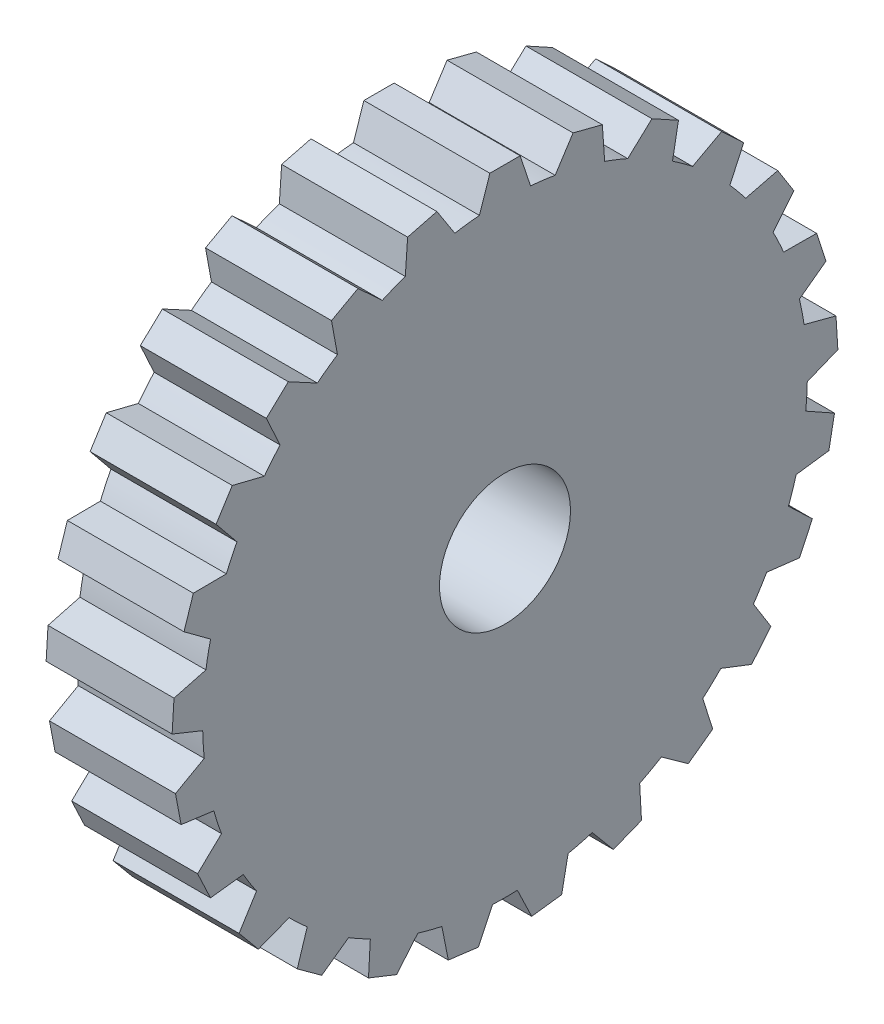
ISO-10303-21;
HEADER;
FILE_DESCRIPTION(('STEP AP214'),'2;1');
FILE_NAME('part.step','',(''),(''),'','','');
FILE_SCHEMA(('AUTOMOTIVE_DESIGN { 1 0 10303 214 1 1 1 1 }'));
ENDSEC;
DATA;
#1=APPLICATION_CONTEXT('core data for automotive mechanical design processes');
#2=APPLICATION_PROTOCOL_DEFINITION('international standard','automotive_design',2000,#1);
#3=PRODUCT_CONTEXT('',#1,'mechanical');
#4=PRODUCT('Part','Part','',(#3));
#5=PRODUCT_RELATED_PRODUCT_CATEGORY('part','',(#4));
#6=PRODUCT_DEFINITION_FORMATION('','',#4);
#7=PRODUCT_DEFINITION_CONTEXT('part definition',#1,'design');
#8=PRODUCT_DEFINITION('design','',#6,#7);
#9=PRODUCT_DEFINITION_SHAPE('','',#8);
#10=(LENGTH_UNIT() NAMED_UNIT(*) SI_UNIT(.MILLI.,.METRE.));
#11=(NAMED_UNIT(*) PLANE_ANGLE_UNIT() SI_UNIT($,.RADIAN.));
#12=(NAMED_UNIT(*) SI_UNIT($,.STERADIAN.) SOLID_ANGLE_UNIT());
#13=UNCERTAINTY_MEASURE_WITH_UNIT(LENGTH_MEASURE(1.E-05),#10,'distance_accuracy_value','');
#14=(GEOMETRIC_REPRESENTATION_CONTEXT(3) GLOBAL_UNCERTAINTY_ASSIGNED_CONTEXT((#13)) GLOBAL_UNIT_ASSIGNED_CONTEXT((#10,
#11,#12)) REPRESENTATION_CONTEXT('',''));
#15=CARTESIAN_POINT('',(0.,0.,0.));
#16=DIRECTION('',(0.,0.,1.));
#17=DIRECTION('',(1.,0.,0.));
#18=AXIS2_PLACEMENT_3D('',#15,#16,#17);
#19=CARTESIAN_POINT('',(3.175,0.,0.));
#20=DIRECTION('',(-1.,0.,0.));
#21=DIRECTION('',(0.,0.,1.));
#22=AXIS2_PLACEMENT_3D('',#19,#20,#21);
#23=CYLINDRICAL_SURFACE('',#22,7.62);
#24=CARTESIAN_POINT('',(0.,0.,0.));
#25=DIRECTION('',(1.,0.,0.));
#26=DIRECTION('',(0.,0.,-1.));
#27=AXIS2_PLACEMENT_3D('',#24,#25,#26);
#28=CIRCLE('',#27,7.62);
#29=CARTESIAN_POINT('',(0.,7.59272994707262,0.644090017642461));
#30=VERTEX_POINT('',#29);
#31=CARTESIAN_POINT('',(0.,7.51436904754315,1.26438040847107));
#32=VERTEX_POINT('',#31);
#33=EDGE_CURVE('E1291',#30,#32,#28,.T.);
#34=ORIENTED_EDGE('',*,*,#33,.T.);
#35=DIRECTION('',(-1.,0.,0.));
#36=VECTOR('',#35,1.);
#37=CARTESIAN_POINT('',(3.175,7.51436904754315,1.26438040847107));
#38=LINE('',#37,#36);
#39=CARTESIAN_POINT('',(3.175,7.51436904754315,1.26438040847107));
#40=VERTEX_POINT('',#39);
#41=EDGE_CURVE('E658',#32,#40,#38,.F.);
#42=ORIENTED_EDGE('',*,*,#41,.T.);
#43=CARTESIAN_POINT('',(3.175,0.,0.));
#44=DIRECTION('',(1.,0.,0.));
#45=DIRECTION('',(0.,0.,-1.));
#46=AXIS2_PLACEMENT_3D('',#43,#44,#45);
#47=CIRCLE('',#46,7.62);
#48=CARTESIAN_POINT('',(3.175,7.59272994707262,0.644090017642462));
#49=VERTEX_POINT('',#48);
#50=EDGE_CURVE('E41',#49,#40,#47,.T.);
#51=ORIENTED_EDGE('',*,*,#50,.F.);
#52=DIRECTION('',(-1.,0.,0.));
#53=VECTOR('',#52,1.);
#54=CARTESIAN_POINT('',(3.175,7.59272994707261,0.644090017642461));
#55=LINE('',#54,#53);
#56=EDGE_CURVE('E1254',#49,#30,#55,.T.);
#57=ORIENTED_EDGE('',*,*,#56,.T.);
#58=EDGE_LOOP('',(#34,#42,#51,#57));
#59=FACE_BOUND('',#58,.T.);
#60=ADVANCED_FACE('F32',(#59),#23,.T.);
#61=CARTESIAN_POINT('',(3.175,7.19401169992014,2.51208989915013));
#62=VERTEX_POINT('',#61);
#63=CARTESIAN_POINT('',(3.175,6.96385270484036,3.0934051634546));
#64=VERTEX_POINT('',#63);
#65=EDGE_CURVE('E42',#62,#64,#47,.T.);
#66=ORIENTED_EDGE('',*,*,#65,.F.);
#67=DIRECTION('',(-1.,0.,0.));
#68=VECTOR('',#67,1.);
#69=CARTESIAN_POINT('',(3.175,7.19401169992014,2.51208989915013));
#70=LINE('',#69,#68);
#71=CARTESIAN_POINT('',(0.,7.19401169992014,2.51208989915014));
#72=VERTEX_POINT('',#71);
#73=EDGE_CURVE('E684',#62,#72,#70,.T.);
#74=ORIENTED_EDGE('',*,*,#73,.T.);
#75=CARTESIAN_POINT('',(0.,6.96385270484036,3.0934051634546));
#76=VERTEX_POINT('',#75);
#77=EDGE_CURVE('E1294',#72,#76,#28,.T.);
#78=ORIENTED_EDGE('',*,*,#77,.T.);
#79=DIRECTION('',(-1.,0.,0.));
#80=VECTOR('',#79,1.);
#81=CARTESIAN_POINT('',(3.175,6.96385270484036,3.0934051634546));
#82=LINE('',#81,#80);
#83=EDGE_CURVE('E709',#76,#64,#82,.F.);
#84=ORIENTED_EDGE('',*,*,#83,.T.);
#85=EDGE_LOOP('',(#66,#74,#78,#84));
#86=FACE_BOUND('',#85,.T.);
#87=ADVANCED_FACE('F1479',(#86),#23,.T.);
#88=CARTESIAN_POINT('',(3.175,6.34326723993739,4.22224593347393));
#89=VERTEX_POINT('',#88);
#90=CARTESIAN_POINT('',(3.175,5.97577188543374,4.72805989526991));
#91=VERTEX_POINT('',#90);
#92=EDGE_CURVE('E1407',#89,#91,#47,.T.);
#93=ORIENTED_EDGE('',*,*,#92,.F.);
#94=DIRECTION('',(-1.,0.,0.));
#95=VECTOR('',#94,1.);
#96=CARTESIAN_POINT('',(3.175,6.34326723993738,4.22224593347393));
#97=LINE('',#96,#95);
#98=CARTESIAN_POINT('',(0.,6.34326723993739,4.22224593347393));
#99=VERTEX_POINT('',#98);
#100=EDGE_CURVE('E704',#89,#99,#97,.T.);
#101=ORIENTED_EDGE('',*,*,#100,.T.);
#102=CARTESIAN_POINT('',(0.,5.97577188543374,4.72805989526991));
#103=VERTEX_POINT('',#102);
#104=EDGE_CURVE('E1298',#99,#103,#28,.T.);
#105=ORIENTED_EDGE('',*,*,#104,.T.);
#106=DIRECTION('',(-1.,0.,0.));
#107=VECTOR('',#106,1.);
#108=CARTESIAN_POINT('',(3.175,5.97577188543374,4.72805989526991));
#109=LINE('',#108,#107);
#110=EDGE_CURVE('E734',#103,#91,#109,.F.);
#111=ORIENTED_EDGE('',*,*,#110,.T.);
#112=EDGE_LOOP('',(#93,#101,#105,#111));
#113=FACE_BOUND('',#112,.T.);
#114=ADVANCED_FACE('F1483',(#113),#23,.T.);
#115=CARTESIAN_POINT('',(3.175,5.09395197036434,5.66710272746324));
#116=VERTEX_POINT('',#115);
#117=CARTESIAN_POINT('',(3.175,4.61221134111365,6.06563323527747));
#118=VERTEX_POINT('',#117);
#119=EDGE_CURVE('E1410',#116,#118,#47,.T.);
#120=ORIENTED_EDGE('',*,*,#119,.F.);
#121=DIRECTION('',(-1.,0.,0.));
#122=VECTOR('',#121,1.);
#123=CARTESIAN_POINT('',(3.175,5.09395197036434,5.66710272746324));
#124=LINE('',#123,#122);
#125=CARTESIAN_POINT('',(0.,5.09395197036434,5.66710272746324));
#126=VERTEX_POINT('',#125);
#127=EDGE_CURVE('E729',#116,#126,#124,.T.);
#128=ORIENTED_EDGE('',*,*,#127,.T.);
#129=CARTESIAN_POINT('',(0.,4.61221134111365,6.06563323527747));
#130=VERTEX_POINT('',#129);
#131=EDGE_CURVE('E1301',#126,#130,#28,.T.);
#132=ORIENTED_EDGE('',*,*,#131,.T.);
#133=DIRECTION('',(-1.,0.,0.));
#134=VECTOR('',#133,1.);
#135=CARTESIAN_POINT('',(3.175,4.61221134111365,6.06563323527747));
#136=LINE('',#135,#134);
#137=EDGE_CURVE('E759',#130,#118,#136,.F.);
#138=ORIENTED_EDGE('',*,*,#137,.T.);
#139=EDGE_LOOP('',(#120,#128,#132,#138));
#140=FACE_BOUND('',#139,.T.);
#141=ADVANCED_FACE('F1962',(#140),#23,.T.);
#142=CARTESIAN_POINT('',(3.175,3.52456496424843,6.75587461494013));
#143=VERTEX_POINT('',#142);
#144=CARTESIAN_POINT('',(3.175,2.95884859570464,7.02208053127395));
#145=VERTEX_POINT('',#144);
#146=EDGE_CURVE('E1413',#143,#145,#47,.T.);
#147=ORIENTED_EDGE('',*,*,#146,.F.);
#148=DIRECTION('',(-1.,0.,0.));
#149=VECTOR('',#148,1.);
#150=CARTESIAN_POINT('',(3.175,3.52456496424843,6.75587461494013));
#151=LINE('',#150,#149);
#152=CARTESIAN_POINT('',(0.,3.52456496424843,6.75587461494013));
#153=VERTEX_POINT('',#152);
#154=EDGE_CURVE('E754',#143,#153,#151,.T.);
#155=ORIENTED_EDGE('',*,*,#154,.T.);
#156=CARTESIAN_POINT('',(0.,2.95884859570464,7.02208053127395));
#157=VERTEX_POINT('',#156);
#158=EDGE_CURVE('E1305',#153,#157,#28,.T.);
#159=ORIENTED_EDGE('',*,*,#158,.T.);
#160=DIRECTION('',(-1.,0.,0.));
#161=VECTOR('',#160,1.);
#162=CARTESIAN_POINT('',(3.175,2.95884859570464,7.02208053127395));
#163=LINE('',#162,#161);
#164=EDGE_CURVE('E784',#157,#145,#163,.F.);
#165=ORIENTED_EDGE('',*,*,#164,.T.);
#166=EDGE_LOOP('',(#147,#155,#159,#165));
#167=FACE_BOUND('',#166,.T.);
#168=ADVANCED_FACE('F1954',(#167),#23,.T.);
#169=CARTESIAN_POINT('',(3.175,1.73371657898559,7.42015005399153));
#170=VERTEX_POINT('',#169);
#171=CARTESIAN_POINT('',(3.175,1.11957051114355,7.53730468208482));
#172=VERTEX_POINT('',#171);
#173=EDGE_CURVE('E1416',#170,#172,#47,.T.);
#174=ORIENTED_EDGE('',*,*,#173,.F.);
#175=DIRECTION('',(-1.,0.,0.));
#176=VECTOR('',#175,1.);
#177=CARTESIAN_POINT('',(3.175,1.73371657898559,7.42015005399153));
#178=LINE('',#177,#176);
#179=CARTESIAN_POINT('',(0.,1.73371657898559,7.42015005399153));
#180=VERTEX_POINT('',#179);
#181=EDGE_CURVE('E779',#170,#180,#178,.T.);
#182=ORIENTED_EDGE('',*,*,#181,.T.);
#183=CARTESIAN_POINT('',(0.,1.11957051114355,7.53730468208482));
#184=VERTEX_POINT('',#183);
#185=EDGE_CURVE('E1309',#180,#184,#28,.T.);
#186=ORIENTED_EDGE('',*,*,#185,.T.);
#187=DIRECTION('',(-1.,0.,0.));
#188=VECTOR('',#187,1.);
#189=CARTESIAN_POINT('',(3.175,1.11957051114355,7.53730468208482));
#190=LINE('',#189,#188);
#191=EDGE_CURVE('E809',#184,#172,#190,.F.);
#192=ORIENTED_EDGE('',*,*,#191,.T.);
#193=EDGE_LOOP('',(#174,#182,#186,#192));
#194=FACE_BOUND('',#193,.T.);
#195=ADVANCED_FACE('F1946',(#194),#23,.T.);
#196=CARTESIAN_POINT('',(3.175,-0.166067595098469,7.61819017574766));
#197=VERTEX_POINT('',#196);
#198=CARTESIAN_POINT('',(3.175,-0.790054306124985,7.57893225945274));
#199=VERTEX_POINT('',#198);
#200=EDGE_CURVE('E1419',#197,#199,#47,.T.);
#201=ORIENTED_EDGE('',*,*,#200,.F.);
#202=DIRECTION('',(-1.,0.,0.));
#203=VECTOR('',#202,1.);
#204=CARTESIAN_POINT('',(3.175,-0.16606759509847,7.61819017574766));
#205=LINE('',#204,#203);
#206=CARTESIAN_POINT('',(0.,-0.16606759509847,7.61819017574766));
#207=VERTEX_POINT('',#206);
#208=EDGE_CURVE('E804',#197,#207,#205,.T.);
#209=ORIENTED_EDGE('',*,*,#208,.T.);
#210=CARTESIAN_POINT('',(0.,-0.790054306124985,7.57893225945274));
#211=VERTEX_POINT('',#210);
#212=EDGE_CURVE('E1313',#207,#211,#28,.T.);
#213=ORIENTED_EDGE('',*,*,#212,.T.);
#214=DIRECTION('',(-1.,0.,0.));
#215=VECTOR('',#214,1.);
#216=CARTESIAN_POINT('',(3.175,-0.790054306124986,7.57893225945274));
#217=LINE('',#216,#215);
#218=EDGE_CURVE('E834',#211,#199,#217,.F.);
#219=ORIENTED_EDGE('',*,*,#218,.T.);
#220=EDGE_LOOP('',(#201,#209,#213,#219));
#221=FACE_BOUND('',#220,.T.);
#222=ADVANCED_FACE('F1938',(#221),#23,.T.);
#223=CARTESIAN_POINT('',(3.175,-2.0554171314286,7.33755139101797));
#224=VERTEX_POINT('',#223);
#225=CARTESIAN_POINT('',(3.175,-2.65003710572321,7.14434764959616));
#226=VERTEX_POINT('',#225);
#227=EDGE_CURVE('E1422',#224,#226,#47,.T.);
#228=ORIENTED_EDGE('',*,*,#227,.F.);
#229=DIRECTION('',(-1.,0.,0.));
#230=VECTOR('',#229,1.);
#231=CARTESIAN_POINT('',(3.175,-2.0554171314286,7.33755139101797));
#232=LINE('',#231,#230);
#233=CARTESIAN_POINT('',(0.,-2.0554171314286,7.33755139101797));
#234=VERTEX_POINT('',#233);
#235=EDGE_CURVE('E829',#224,#234,#232,.T.);
#236=ORIENTED_EDGE('',*,*,#235,.T.);
#237=CARTESIAN_POINT('',(0.,-2.65003710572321,7.14434764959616));
#238=VERTEX_POINT('',#237);
#239=EDGE_CURVE('E1317',#234,#238,#28,.T.);
#240=ORIENTED_EDGE('',*,*,#239,.T.);
#241=DIRECTION('',(-1.,0.,0.));
#242=VECTOR('',#241,1.);
#243=CARTESIAN_POINT('',(3.175,-2.65003710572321,7.14434764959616));
#244=LINE('',#243,#242);
#245=EDGE_CURVE('E859',#238,#226,#244,.F.);
#246=ORIENTED_EDGE('',*,*,#245,.T.);
#247=EDGE_LOOP('',(#228,#236,#240,#246));
#248=FACE_BOUND('',#247,.T.);
#249=ADVANCED_FACE('F1930',(#248),#23,.T.);
#250=CARTESIAN_POINT('',(3.175,-3.81561725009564,6.59586726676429));
#251=VERTEX_POINT('',#250);
#252=CARTESIAN_POINT('',(3.175,-4.34350832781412,6.26085740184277));
#253=VERTEX_POINT('',#252);
#254=EDGE_CURVE('E1425',#251,#253,#47,.T.);
#255=ORIENTED_EDGE('',*,*,#254,.F.);
#256=DIRECTION('',(-1.,0.,0.));
#257=VECTOR('',#256,1.);
#258=CARTESIAN_POINT('',(3.175,-3.81561725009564,6.59586726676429));
#259=LINE('',#258,#257);
#260=CARTESIAN_POINT('',(0.,-3.81561725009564,6.59586726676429));
#261=VERTEX_POINT('',#260);
#262=EDGE_CURVE('E854',#251,#261,#259,.T.);
#263=ORIENTED_EDGE('',*,*,#262,.T.);
#264=CARTESIAN_POINT('',(0.,-4.34350832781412,6.26085740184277));
#265=VERTEX_POINT('',#264);
#266=EDGE_CURVE('E1321',#261,#265,#28,.T.);
#267=ORIENTED_EDGE('',*,*,#266,.T.);
#268=DIRECTION('',(-1.,0.,0.));
#269=VECTOR('',#268,1.);
#270=CARTESIAN_POINT('',(3.175,-4.34350832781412,6.26085740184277));
#271=LINE('',#270,#269);
#272=EDGE_CURVE('E884',#265,#253,#271,.F.);
#273=ORIENTED_EDGE('',*,*,#272,.T.);
#274=EDGE_LOOP('',(#255,#263,#267,#273));
#275=FACE_BOUND('',#274,.T.);
#276=ADVANCED_FACE('F1922',(#275),#23,.T.);
#277=CARTESIAN_POINT('',(3.175,-5.33606810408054,5.43974054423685));
#278=VERTEX_POINT('',#277);
#279=CARTESIAN_POINT('',(3.175,-5.76406094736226,4.98397445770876));
#280=VERTEX_POINT('',#279);
#281=EDGE_CURVE('E1428',#278,#280,#47,.T.);
#282=ORIENTED_EDGE('',*,*,#281,.F.);
#283=DIRECTION('',(-1.,0.,0.));
#284=VECTOR('',#283,1.);
#285=CARTESIAN_POINT('',(3.175,-5.33606810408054,5.43974054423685));
#286=LINE('',#285,#284);
#287=CARTESIAN_POINT('',(0.,-5.33606810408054,5.43974054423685));
#288=VERTEX_POINT('',#287);
#289=EDGE_CURVE('E879',#278,#288,#286,.T.);
#290=ORIENTED_EDGE('',*,*,#289,.T.);
#291=CARTESIAN_POINT('',(0.,-5.76406094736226,4.98397445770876));
#292=VERTEX_POINT('',#291);
#293=EDGE_CURVE('E1325',#288,#292,#28,.T.);
#294=ORIENTED_EDGE('',*,*,#293,.T.);
#295=DIRECTION('',(-1.,0.,0.));
#296=VECTOR('',#295,1.);
#297=CARTESIAN_POINT('',(3.175,-5.76406094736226,4.98397445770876));
#298=LINE('',#297,#296);
#299=EDGE_CURVE('E909',#292,#280,#298,.F.);
#300=ORIENTED_EDGE('',*,*,#299,.T.);
#301=EDGE_LOOP('',(#282,#290,#294,#300));
#302=FACE_BOUND('',#301,.T.);
#303=ADVANCED_FACE('F1914',(#302),#23,.T.);
#304=CARTESIAN_POINT('',(3.175,-6.52123417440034,3.94181491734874));
#305=VERTEX_POINT('',#304);
#306=CARTESIAN_POINT('',(3.175,-6.82243641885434,3.39393006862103));
#307=VERTEX_POINT('',#306);
#308=EDGE_CURVE('E1431',#305,#307,#47,.T.);
#309=ORIENTED_EDGE('',*,*,#308,.F.);
#310=DIRECTION('',(-1.,0.,0.));
#311=VECTOR('',#310,1.);
#312=CARTESIAN_POINT('',(3.175,-6.52123417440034,3.94181491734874));
#313=LINE('',#312,#311);
#314=CARTESIAN_POINT('',(0.,-6.52123417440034,3.94181491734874));
#315=VERTEX_POINT('',#314);
#316=EDGE_CURVE('E904',#305,#315,#313,.T.);
#317=ORIENTED_EDGE('',*,*,#316,.T.);
#318=CARTESIAN_POINT('',(0.,-6.82243641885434,3.39393006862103));
#319=VERTEX_POINT('',#318);
#320=EDGE_CURVE('E1329',#315,#319,#28,.T.);
#321=ORIENTED_EDGE('',*,*,#320,.T.);
#322=DIRECTION('',(-1.,0.,0.));
#323=VECTOR('',#322,1.);
#324=CARTESIAN_POINT('',(3.175,-6.82243641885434,3.39393006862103));
#325=LINE('',#324,#323);
#326=EDGE_CURVE('E934',#319,#307,#325,.F.);
#327=ORIENTED_EDGE('',*,*,#326,.T.);
#328=EDGE_LOOP('',(#309,#317,#321,#327));
#329=FACE_BOUND('',#328,.T.);
#330=ADVANCED_FACE('F1906',(#329),#23,.T.);
#331=CARTESIAN_POINT('',(3.175,-7.29664711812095,2.19621056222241));
#332=VERTEX_POINT('',#331);
#333=CARTESIAN_POINT('',(3.175,-7.45213311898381,1.59063257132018));
#334=VERTEX_POINT('',#333);
#335=EDGE_CURVE('E1434',#332,#334,#47,.T.);
#336=ORIENTED_EDGE('',*,*,#335,.F.);
#337=DIRECTION('',(-1.,0.,0.));
#338=VECTOR('',#337,1.);
#339=CARTESIAN_POINT('',(3.175,-7.29664711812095,2.19621056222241));
#340=LINE('',#339,#338);
#341=CARTESIAN_POINT('',(0.,-7.29664711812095,2.19621056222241));
#342=VERTEX_POINT('',#341);
#343=EDGE_CURVE('E929',#332,#342,#340,.T.);
#344=ORIENTED_EDGE('',*,*,#343,.T.);
#345=CARTESIAN_POINT('',(0.,-7.45213311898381,1.59063257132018));
#346=VERTEX_POINT('',#345);
#347=EDGE_CURVE('E1333',#342,#346,#28,.T.);
#348=ORIENTED_EDGE('',*,*,#347,.T.);
#349=DIRECTION('',(-1.,0.,0.));
#350=VECTOR('',#349,1.);
#351=CARTESIAN_POINT('',(3.175,-7.45213311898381,1.59063257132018));
#352=LINE('',#351,#350);
#353=EDGE_CURVE('E959',#346,#334,#352,.F.);
#354=ORIENTED_EDGE('',*,*,#353,.T.);
#355=EDGE_LOOP('',(#336,#344,#348,#354));
#356=FACE_BOUND('',#355,.T.);
#357=ADVANCED_FACE('F1898',(#356),#23,.T.);
#358=CARTESIAN_POINT('',(3.175,-7.61358488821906,0.312610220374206));
#359=VERTEX_POINT('',#358);
#360=CARTESIAN_POINT('',(3.175,-7.61358488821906,-0.312610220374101));
#361=VERTEX_POINT('',#360);
#362=EDGE_CURVE('E1437',#359,#361,#47,.T.);
#363=ORIENTED_EDGE('',*,*,#362,.F.);
#364=DIRECTION('',(-1.,0.,0.));
#365=VECTOR('',#364,1.);
#366=CARTESIAN_POINT('',(3.175,-7.61358488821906,0.312610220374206));
#367=LINE('',#366,#365);
#368=CARTESIAN_POINT('',(0.,-7.61358488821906,0.312610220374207));
#369=VERTEX_POINT('',#368);
#370=EDGE_CURVE('E954',#359,#369,#367,.T.);
#371=ORIENTED_EDGE('',*,*,#370,.T.);
#372=CARTESIAN_POINT('',(0.,-7.61358488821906,-0.312610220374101));
#373=VERTEX_POINT('',#372);
#374=EDGE_CURVE('E1337',#369,#373,#28,.T.);
#375=ORIENTED_EDGE('',*,*,#374,.T.);
#376=DIRECTION('',(-1.,0.,0.));
#377=VECTOR('',#376,1.);
#378=CARTESIAN_POINT('',(3.175,-7.61358488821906,-0.312610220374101));
#379=LINE('',#378,#377);
#380=EDGE_CURVE('E984',#373,#361,#379,.F.);
#381=ORIENTED_EDGE('',*,*,#380,.T.);
#382=EDGE_LOOP('',(#363,#371,#375,#381));
#383=FACE_BOUND('',#382,.T.);
#384=ADVANCED_FACE('F1890',(#383),#23,.T.);
#385=CARTESIAN_POINT('',(3.175,-7.45213311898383,-1.59063257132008));
#386=VERTEX_POINT('',#385);
#387=CARTESIAN_POINT('',(3.175,-7.29664711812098,-2.19621056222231));
#388=VERTEX_POINT('',#387);
#389=EDGE_CURVE('E1440',#386,#388,#47,.T.);
#390=ORIENTED_EDGE('',*,*,#389,.F.);
#391=DIRECTION('',(-1.,0.,0.));
#392=VECTOR('',#391,1.);
#393=CARTESIAN_POINT('',(3.175,-7.45213311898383,-1.59063257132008));
#394=LINE('',#393,#392);
#395=CARTESIAN_POINT('',(0.,-7.45213311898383,-1.59063257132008));
#396=VERTEX_POINT('',#395);
#397=EDGE_CURVE('E979',#386,#396,#394,.T.);
#398=ORIENTED_EDGE('',*,*,#397,.T.);
#399=CARTESIAN_POINT('',(0.,-7.29664711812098,-2.19621056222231));
#400=VERTEX_POINT('',#399);
#401=EDGE_CURVE('E1341',#396,#400,#28,.T.);
#402=ORIENTED_EDGE('',*,*,#401,.T.);
#403=DIRECTION('',(-1.,0.,0.));
#404=VECTOR('',#403,1.);
#405=CARTESIAN_POINT('',(3.175,-7.29664711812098,-2.19621056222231));
#406=LINE('',#405,#404);
#407=EDGE_CURVE('E1009',#400,#388,#406,.F.);
#408=ORIENTED_EDGE('',*,*,#407,.T.);
#409=EDGE_LOOP('',(#390,#398,#402,#408));
#410=FACE_BOUND('',#409,.T.);
#411=ADVANCED_FACE('F1882',(#410),#23,.T.);
#412=CARTESIAN_POINT('',(3.175,-6.82243641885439,-3.39393006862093));
#413=VERTEX_POINT('',#412);
#414=CARTESIAN_POINT('',(3.175,-6.5212341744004,-3.94181491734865));
#415=VERTEX_POINT('',#414);
#416=EDGE_CURVE('E1443',#413,#415,#47,.T.);
#417=ORIENTED_EDGE('',*,*,#416,.F.);
#418=DIRECTION('',(-1.,0.,0.));
#419=VECTOR('',#418,1.);
#420=CARTESIAN_POINT('',(3.175,-6.82243641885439,-3.39393006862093));
#421=LINE('',#420,#419);
#422=CARTESIAN_POINT('',(0.,-6.82243641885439,-3.39393006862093));
#423=VERTEX_POINT('',#422);
#424=EDGE_CURVE('E1004',#413,#423,#421,.T.);
#425=ORIENTED_EDGE('',*,*,#424,.T.);
#426=CARTESIAN_POINT('',(0.,-6.5212341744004,-3.94181491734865));
#427=VERTEX_POINT('',#426);
#428=EDGE_CURVE('E1345',#423,#427,#28,.T.);
#429=ORIENTED_EDGE('',*,*,#428,.T.);
#430=DIRECTION('',(-1.,0.,0.));
#431=VECTOR('',#430,1.);
#432=CARTESIAN_POINT('',(3.175,-6.5212341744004,-3.94181491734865));
#433=LINE('',#432,#431);
#434=EDGE_CURVE('E1034',#427,#415,#433,.F.);
#435=ORIENTED_EDGE('',*,*,#434,.T.);
#436=EDGE_LOOP('',(#417,#425,#429,#435));
#437=FACE_BOUND('',#436,.T.);
#438=ADVANCED_FACE('F1874',(#437),#23,.T.);
#439=CARTESIAN_POINT('',(3.175,-5.76406094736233,-4.98397445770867));
#440=VERTEX_POINT('',#439);
#441=CARTESIAN_POINT('',(3.175,-5.33606810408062,-5.43974054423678));
#442=VERTEX_POINT('',#441);
#443=EDGE_CURVE('E1446',#440,#442,#47,.T.);
#444=ORIENTED_EDGE('',*,*,#443,.F.);
#445=DIRECTION('',(-1.,0.,0.));
#446=VECTOR('',#445,1.);
#447=CARTESIAN_POINT('',(3.175,-5.76406094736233,-4.98397445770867));
#448=LINE('',#447,#446);
#449=CARTESIAN_POINT('',(0.,-5.76406094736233,-4.98397445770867));
#450=VERTEX_POINT('',#449);
#451=EDGE_CURVE('E1029',#440,#450,#448,.T.);
#452=ORIENTED_EDGE('',*,*,#451,.T.);
#453=CARTESIAN_POINT('',(0.,-5.33606810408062,-5.43974054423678));
#454=VERTEX_POINT('',#453);
#455=EDGE_CURVE('E1349',#450,#454,#28,.T.);
#456=ORIENTED_EDGE('',*,*,#455,.T.);
#457=DIRECTION('',(-1.,0.,0.));
#458=VECTOR('',#457,1.);
#459=CARTESIAN_POINT('',(3.175,-5.33606810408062,-5.43974054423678));
#460=LINE('',#459,#458);
#461=EDGE_CURVE('E1059',#454,#442,#460,.F.);
#462=ORIENTED_EDGE('',*,*,#461,.T.);
#463=EDGE_LOOP('',(#444,#452,#456,#462));
#464=FACE_BOUND('',#463,.T.);
#465=ADVANCED_FACE('F1866',(#464),#23,.T.);
#466=CARTESIAN_POINT('',(3.175,-4.34350832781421,-6.26085740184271));
#467=VERTEX_POINT('',#466);
#468=CARTESIAN_POINT('',(3.175,-3.81561725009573,-6.59586726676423));
#469=VERTEX_POINT('',#468);
#470=EDGE_CURVE('E1449',#467,#469,#47,.T.);
#471=ORIENTED_EDGE('',*,*,#470,.F.);
#472=DIRECTION('',(-1.,0.,0.));
#473=VECTOR('',#472,1.);
#474=CARTESIAN_POINT('',(3.175,-4.34350832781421,-6.26085740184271));
#475=LINE('',#474,#473);
#476=CARTESIAN_POINT('',(0.,-4.34350832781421,-6.26085740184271));
#477=VERTEX_POINT('',#476);
#478=EDGE_CURVE('E1054',#467,#477,#475,.T.);
#479=ORIENTED_EDGE('',*,*,#478,.T.);
#480=CARTESIAN_POINT('',(0.,-3.81561725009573,-6.59586726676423));
#481=VERTEX_POINT('',#480);
#482=EDGE_CURVE('E1353',#477,#481,#28,.T.);
#483=ORIENTED_EDGE('',*,*,#482,.T.);
#484=DIRECTION('',(-1.,0.,0.));
#485=VECTOR('',#484,1.);
#486=CARTESIAN_POINT('',(3.175,-3.81561725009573,-6.59586726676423));
#487=LINE('',#486,#485);
#488=EDGE_CURVE('E1084',#481,#469,#487,.F.);
#489=ORIENTED_EDGE('',*,*,#488,.T.);
#490=EDGE_LOOP('',(#471,#479,#483,#489));
#491=FACE_BOUND('',#490,.T.);
#492=ADVANCED_FACE('F1858',(#491),#23,.T.);
#493=CARTESIAN_POINT('',(3.175,-2.65003710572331,-7.14434764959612));
#494=VERTEX_POINT('',#493);
#495=CARTESIAN_POINT('',(3.175,-2.0554171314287,-7.33755139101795));
#496=VERTEX_POINT('',#495);
#497=EDGE_CURVE('E1452',#494,#496,#47,.T.);
#498=ORIENTED_EDGE('',*,*,#497,.F.);
#499=DIRECTION('',(-1.,0.,0.));
#500=VECTOR('',#499,1.);
#501=CARTESIAN_POINT('',(3.175,-2.65003710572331,-7.14434764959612));
#502=LINE('',#501,#500);
#503=CARTESIAN_POINT('',(0.,-2.65003710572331,-7.14434764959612));
#504=VERTEX_POINT('',#503);
#505=EDGE_CURVE('E1079',#494,#504,#502,.T.);
#506=ORIENTED_EDGE('',*,*,#505,.T.);
#507=CARTESIAN_POINT('',(0.,-2.0554171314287,-7.33755139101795));
#508=VERTEX_POINT('',#507);
#509=EDGE_CURVE('E1357',#504,#508,#28,.T.);
#510=ORIENTED_EDGE('',*,*,#509,.T.);
#511=DIRECTION('',(-1.,0.,0.));
#512=VECTOR('',#511,1.);
#513=CARTESIAN_POINT('',(3.175,-2.0554171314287,-7.33755139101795));
#514=LINE('',#513,#512);
#515=EDGE_CURVE('E1109',#508,#496,#514,.F.);
#516=ORIENTED_EDGE('',*,*,#515,.T.);
#517=EDGE_LOOP('',(#498,#506,#510,#516));
#518=FACE_BOUND('',#517,.T.);
#519=ADVANCED_FACE('F1477',(#518),#23,.T.);
#520=CARTESIAN_POINT('',(3.175,-0.790054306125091,-7.57893225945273));
#521=VERTEX_POINT('',#520);
#522=CARTESIAN_POINT('',(3.175,-0.166067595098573,-7.61819017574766));
#523=VERTEX_POINT('',#522);
#524=EDGE_CURVE('E1455',#521,#523,#47,.T.);
#525=ORIENTED_EDGE('',*,*,#524,.F.);
#526=DIRECTION('',(-1.,0.,0.));
#527=VECTOR('',#526,1.);
#528=CARTESIAN_POINT('',(3.175,-0.790054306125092,-7.57893225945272));
#529=LINE('',#528,#527);
#530=CARTESIAN_POINT('',(0.,-0.790054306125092,-7.57893225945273));
#531=VERTEX_POINT('',#530);
#532=EDGE_CURVE('E1104',#521,#531,#529,.T.);
#533=ORIENTED_EDGE('',*,*,#532,.T.);
#534=CARTESIAN_POINT('',(0.,-0.166067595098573,-7.61819017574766));
#535=VERTEX_POINT('',#534);
#536=EDGE_CURVE('E1361',#531,#535,#28,.T.);
#537=ORIENTED_EDGE('',*,*,#536,.T.);
#538=DIRECTION('',(-1.,0.,0.));
#539=VECTOR('',#538,1.);
#540=CARTESIAN_POINT('',(3.175,-0.166067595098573,-7.61819017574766));
#541=LINE('',#540,#539);
#542=EDGE_CURVE('E1134',#535,#523,#541,.F.);
#543=ORIENTED_EDGE('',*,*,#542,.T.);
#544=EDGE_LOOP('',(#525,#533,#537,#543));
#545=FACE_BOUND('',#544,.T.);
#546=ADVANCED_FACE('F1472',(#545),#23,.T.);
#547=CARTESIAN_POINT('',(3.175,1.11957051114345,-7.53730468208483));
#548=VERTEX_POINT('',#547);
#549=CARTESIAN_POINT('',(3.175,1.73371657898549,-7.42015005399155));
#550=VERTEX_POINT('',#549);
#551=EDGE_CURVE('E1402',#548,#550,#47,.T.);
#552=ORIENTED_EDGE('',*,*,#551,.F.);
#553=DIRECTION('',(-1.,0.,0.));
#554=VECTOR('',#553,1.);
#555=CARTESIAN_POINT('',(3.175,1.11957051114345,-7.53730468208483));
#556=LINE('',#555,#554);
#557=CARTESIAN_POINT('',(0.,1.11957051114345,-7.53730468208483));
#558=VERTEX_POINT('',#557);
#559=EDGE_CURVE('E1129',#548,#558,#556,.T.);
#560=ORIENTED_EDGE('',*,*,#559,.T.);
#561=CARTESIAN_POINT('',(0.,1.73371657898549,-7.42015005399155));
#562=VERTEX_POINT('',#561);
#563=EDGE_CURVE('E1365',#558,#562,#28,.T.);
#564=ORIENTED_EDGE('',*,*,#563,.T.);
#565=DIRECTION('',(-1.,0.,0.));
#566=VECTOR('',#565,1.);
#567=CARTESIAN_POINT('',(3.175,1.73371657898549,-7.42015005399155));
#568=LINE('',#567,#566);
#569=EDGE_CURVE('E1159',#562,#550,#568,.F.);
#570=ORIENTED_EDGE('',*,*,#569,.T.);
#571=EDGE_LOOP('',(#552,#560,#564,#570));
#572=FACE_BOUND('',#571,.T.);
#573=ADVANCED_FACE('F1469',(#572),#23,.T.);
#574=CARTESIAN_POINT('',(3.175,2.95884859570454,-7.022080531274));
#575=VERTEX_POINT('',#574);
#576=CARTESIAN_POINT('',(3.175,3.52456496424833,-6.75587461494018));
#577=VERTEX_POINT('',#576);
#578=EDGE_CURVE('E1400',#575,#577,#47,.T.);
#579=ORIENTED_EDGE('',*,*,#578,.F.);
#580=DIRECTION('',(-1.,0.,0.));
#581=VECTOR('',#580,1.);
#582=CARTESIAN_POINT('',(3.175,2.95884859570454,-7.022080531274));
#583=LINE('',#582,#581);
#584=CARTESIAN_POINT('',(0.,2.95884859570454,-7.022080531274));
#585=VERTEX_POINT('',#584);
#586=EDGE_CURVE('E1154',#575,#585,#583,.T.);
#587=ORIENTED_EDGE('',*,*,#586,.T.);
#588=CARTESIAN_POINT('',(0.,3.52456496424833,-6.75587461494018));
#589=VERTEX_POINT('',#588);
#590=EDGE_CURVE('E1369',#585,#589,#28,.T.);
#591=ORIENTED_EDGE('',*,*,#590,.T.);
#592=DIRECTION('',(-1.,0.,0.));
#593=VECTOR('',#592,1.);
#594=CARTESIAN_POINT('',(3.175,3.52456496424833,-6.75587461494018));
#595=LINE('',#594,#593);
#596=EDGE_CURVE('E1184',#589,#577,#595,.F.);
#597=ORIENTED_EDGE('',*,*,#596,.T.);
#598=EDGE_LOOP('',(#579,#587,#591,#597));
#599=FACE_BOUND('',#598,.T.);
#600=ADVANCED_FACE('F1471',(#599),#23,.T.);
#601=CARTESIAN_POINT('',(3.175,4.61221134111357,-6.06563323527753));
#602=VERTEX_POINT('',#601);
#603=CARTESIAN_POINT('',(3.175,5.09395197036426,-5.66710272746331));
#604=VERTEX_POINT('',#603);
#605=EDGE_CURVE('E1398',#602,#604,#47,.T.);
#606=ORIENTED_EDGE('',*,*,#605,.F.);
#607=DIRECTION('',(-1.,0.,0.));
#608=VECTOR('',#607,1.);
#609=CARTESIAN_POINT('',(3.175,4.61221134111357,-6.06563323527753));
#610=LINE('',#609,#608);
#611=CARTESIAN_POINT('',(0.,4.61221134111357,-6.06563323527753));
#612=VERTEX_POINT('',#611);
#613=EDGE_CURVE('E1179',#602,#612,#610,.T.);
#614=ORIENTED_EDGE('',*,*,#613,.T.);
#615=CARTESIAN_POINT('',(0.,5.09395197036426,-5.66710272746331));
#616=VERTEX_POINT('',#615);
#617=EDGE_CURVE('E1293',#612,#616,#28,.T.);
#618=ORIENTED_EDGE('',*,*,#617,.T.);
#619=DIRECTION('',(-1.,0.,0.));
#620=VECTOR('',#619,1.);
#621=CARTESIAN_POINT('',(3.175,5.09395197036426,-5.66710272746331));
#622=LINE('',#621,#620);
#623=EDGE_CURVE('E1209',#616,#604,#622,.F.);
#624=ORIENTED_EDGE('',*,*,#623,.T.);
#625=EDGE_LOOP('',(#606,#614,#618,#624));
#626=FACE_BOUND('',#625,.T.);
#627=ADVANCED_FACE('F1380',(#626),#23,.T.);
#628=CARTESIAN_POINT('',(3.175,5.97577188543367,-4.72805989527));
#629=VERTEX_POINT('',#628);
#630=CARTESIAN_POINT('',(3.175,6.34326723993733,-4.22224593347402));
#631=VERTEX_POINT('',#630);
#632=EDGE_CURVE('E1401',#629,#631,#47,.T.);
#633=ORIENTED_EDGE('',*,*,#632,.F.);
#634=DIRECTION('',(-1.,0.,0.));
#635=VECTOR('',#634,1.);
#636=CARTESIAN_POINT('',(3.175,5.97577188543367,-4.72805989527));
#637=LINE('',#636,#635);
#638=CARTESIAN_POINT('',(0.,5.97577188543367,-4.72805989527));
#639=VERTEX_POINT('',#638);
#640=EDGE_CURVE('E1204',#629,#639,#637,.T.);
#641=ORIENTED_EDGE('',*,*,#640,.T.);
#642=CARTESIAN_POINT('',(0.,6.34326723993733,-4.22224593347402));
#643=VERTEX_POINT('',#642);
#644=EDGE_CURVE('E1290',#639,#643,#28,.T.);
#645=ORIENTED_EDGE('',*,*,#644,.T.);
#646=DIRECTION('',(-1.,0.,0.));
#647=VECTOR('',#646,1.);
#648=CARTESIAN_POINT('',(3.175,6.34326723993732,-4.22224593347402));
#649=LINE('',#648,#647);
#650=EDGE_CURVE('E1234',#643,#631,#649,.F.);
#651=ORIENTED_EDGE('',*,*,#650,.T.);
#652=EDGE_LOOP('',(#633,#641,#645,#651));
#653=FACE_BOUND('',#652,.T.);
#654=ADVANCED_FACE('F1492',(#653),#23,.T.);
#655=CARTESIAN_POINT('',(0.,7.51436904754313,-1.26438040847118));
#656=VERTEX_POINT('',#655);
#657=CARTESIAN_POINT('',(0.,7.59272994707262,-0.644090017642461));
#658=VERTEX_POINT('',#657);
#659=EDGE_CURVE('E36',#656,#658,#28,.T.);
#660=ORIENTED_EDGE('',*,*,#659,.T.);
#661=DIRECTION('',(-1.,0.,0.));
#662=VECTOR('',#661,1.);
#663=CARTESIAN_POINT('',(3.175,7.59272994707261,-0.644090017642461));
#664=LINE('',#663,#662);
#665=CARTESIAN_POINT('',(3.175,7.59272994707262,-0.644090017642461));
#666=VERTEX_POINT('',#665);
#667=EDGE_CURVE('E1259',#658,#666,#664,.F.);
#668=ORIENTED_EDGE('',*,*,#667,.T.);
#669=CARTESIAN_POINT('',(3.175,7.51436904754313,-1.26438040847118));
#670=VERTEX_POINT('',#669);
#671=EDGE_CURVE('E11',#670,#666,#47,.T.);
#672=ORIENTED_EDGE('',*,*,#671,.F.);
#673=DIRECTION('',(-1.,0.,0.));
#674=VECTOR('',#673,1.);
#675=CARTESIAN_POINT('',(3.175,7.51436904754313,-1.26438040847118));
#676=LINE('',#675,#674);
#677=EDGE_CURVE('E1279',#670,#656,#676,.T.);
#678=ORIENTED_EDGE('',*,*,#677,.T.);
#679=EDGE_LOOP('',(#660,#668,#672,#678));
#680=FACE_BOUND('',#679,.T.);
#681=ADVANCED_FACE('F1485',(#680),#23,.T.);
#682=CARTESIAN_POINT('',(3.175,6.96385270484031,-3.0934051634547));
#683=VERTEX_POINT('',#682);
#684=CARTESIAN_POINT('',(3.175,7.1940116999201,-2.51208989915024));
#685=VERTEX_POINT('',#684);
#686=EDGE_CURVE('E1297',#683,#685,#47,.T.);
#687=ORIENTED_EDGE('',*,*,#686,.F.);
#688=DIRECTION('',(-1.,0.,0.));
#689=VECTOR('',#688,1.);
#690=CARTESIAN_POINT('',(3.175,6.96385270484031,-3.0934051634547));
#691=LINE('',#690,#689);
#692=CARTESIAN_POINT('',(0.,6.96385270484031,-3.0934051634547));
#693=VERTEX_POINT('',#692);
#694=EDGE_CURVE('E1229',#683,#693,#691,.T.);
#695=ORIENTED_EDGE('',*,*,#694,.T.);
#696=CARTESIAN_POINT('',(0.,7.1940116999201,-2.51208989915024));
#697=VERTEX_POINT('',#696);
#698=EDGE_CURVE('E1286',#693,#697,#28,.T.);
#699=ORIENTED_EDGE('',*,*,#698,.T.);
#700=DIRECTION('',(-1.,0.,0.));
#701=VECTOR('',#700,1.);
#702=CARTESIAN_POINT('',(3.175,7.1940116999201,-2.51208989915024));
#703=LINE('',#702,#701);
#704=EDGE_CURVE('E1284',#697,#685,#703,.F.);
#705=ORIENTED_EDGE('',*,*,#704,.T.);
#706=EDGE_LOOP('',(#687,#695,#699,#705));
#707=FACE_BOUND('',#706,.T.);
#708=ADVANCED_FACE('F34',(#707),#23,.T.);
#709=CARTESIAN_POINT('',(3.175,0.,0.));
#710=DIRECTION('',(1.,0.,0.));
#711=DIRECTION('',(0.,0.,-1.));
#712=AXIS2_PLACEMENT_3D('',#709,#710,#711);
#713=PLANE('',#712);
#714=CARTESIAN_POINT('',(3.175,0.,0.));
#715=DIRECTION('',(1.,0.,0.));
#716=DIRECTION('',(0.,0.,-1.));
#717=AXIS2_PLACEMENT_3D('',#714,#715,#716);
#718=CIRCLE('',#717,1.651);
#719=CARTESIAN_POINT('',(3.175,0.,-1.651));
#720=VERTEX_POINT('',#719);
#721=EDGE_CURVE('E1551',#720,#720,#718,.T.);
#722=ORIENTED_EDGE('',*,*,#721,.F.);
#723=EDGE_LOOP('',(#722));
#724=FACE_BOUND('',#723,.T.);
#725=ORIENTED_EDGE('',*,*,#50,.T.);
#726=DIRECTION('',(0.,0.840236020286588,0.542220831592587));
#727=VECTOR('',#726,1.);
#728=CARTESIAN_POINT('',(3.175,7.20107519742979,1.06220572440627));
#729=LINE('',#728,#727);
#730=CARTESIAN_POINT('',(3.175,8.21341490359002,1.71548844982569));
#731=VERTEX_POINT('',#730);
#732=EDGE_CURVE('E679',#40,#731,#729,.T.);
#733=ORIENTED_EDGE('',*,*,#732,.T.);
#734=DIRECTION('',(0.,-0.248689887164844,0.968583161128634));
#735=VECTOR('',#734,1.);
#736=CARTESIAN_POINT('',(3.175,8.02391320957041,2.45354881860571));
#737=LINE('',#736,#735);
#738=CARTESIAN_POINT('',(3.175,8.02391320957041,2.45354881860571));
#739=VERTEX_POINT('',#738);
#740=EDGE_CURVE('E668',#731,#739,#737,.T.);
#741=ORIENTED_EDGE('',*,*,#740,.T.);
#742=DIRECTION('',(0.,-0.997521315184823,0.0703649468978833));
#743=VECTOR('',#742,1.);
#744=CARTESIAN_POINT('',(3.175,6.82207180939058,2.53832646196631));
#745=LINE('',#744,#743);
#746=EDGE_CURVE('E49',#739,#62,#745,.T.);
#747=ORIENTED_EDGE('',*,*,#746,.T.);
#748=ORIENTED_EDGE('',*,*,#65,.T.);
#749=DIRECTION('',(0.,0.678993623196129,0.734144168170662));
#750=VECTOR('',#749,1.);
#751=CARTESIAN_POINT('',(3.175,6.71068035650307,2.8196691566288));
#752=LINE('',#751,#750);
#753=CARTESIAN_POINT('',(3.175,7.52875074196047,3.70418645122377));
#754=VERTEX_POINT('',#753);
#755=EDGE_CURVE('E689',#64,#754,#752,.T.);
#756=ORIENTED_EDGE('',*,*,#755,.T.);
#757=DIRECTION('',(0.,-0.481753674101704,0.87630668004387));
#758=VECTOR('',#757,1.);
#759=CARTESIAN_POINT('',(3.175,7.16165444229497,4.3719321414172));
#760=LINE('',#759,#758);
#761=CARTESIAN_POINT('',(3.175,7.16165444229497,4.3719321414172));
#762=VERTEX_POINT('',#761);
#763=EDGE_CURVE('E699',#754,#762,#760,.T.);
#764=ORIENTED_EDGE('',*,*,#763,.T.);
#765=DIRECTION('',(0.,-0.9836813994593,-0.179919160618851));
#766=VECTOR('',#765,1.);
#767=CARTESIAN_POINT('',(3.175,5.97648775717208,4.15516053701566));
#768=LINE('',#767,#766);
#769=EDGE_CURVE('E56',#762,#89,#768,.T.);
#770=ORIENTED_EDGE('',*,*,#769,.T.);
#771=ORIENTED_EDGE('',*,*,#92,.T.);
#772=DIRECTION('',(0.,0.475087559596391,0.87993852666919));
#773=VECTOR('',#772,1.);
#774=CARTESIAN_POINT('',(3.175,5.79862878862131,4.39996240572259));
#775=LINE('',#774,#773);
#776=CARTESIAN_POINT('',(3.175,6.37102748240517,5.46013679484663));
#777=VERTEX_POINT('',#776);
#778=EDGE_CURVE('E712',#91,#777,#775,.T.);
#779=ORIENTED_EDGE('',*,*,#778,.T.);
#780=DIRECTION('',(0.,-0.68454710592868,0.72896862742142));
#781=VECTOR('',#780,1.);
#782=CARTESIAN_POINT('',(3.175,5.84940258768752,6.01561088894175));
#783=LINE('',#782,#781);
#784=CARTESIAN_POINT('',(3.175,5.84940258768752,6.01561088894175));
#785=VERTEX_POINT('',#784);
#786=EDGE_CURVE('E723',#777,#785,#783,.T.);
#787=ORIENTED_EDGE('',*,*,#786,.T.);
#788=DIRECTION('',(0.,-0.908033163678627,-0.418898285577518));
#789=VECTOR('',#788,1.);
#790=CARTESIAN_POINT('',(3.175,4.75537899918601,5.51091059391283));
#791=LINE('',#790,#789);
#792=EDGE_CURVE('E716',#785,#116,#791,.T.);
#793=ORIENTED_EDGE('',*,*,#792,.T.);
#794=ORIENTED_EDGE('',*,*,#119,.T.);
#795=DIRECTION('',(0.,0.241329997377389,0.970443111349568));
#796=VECTOR('',#795,1.);
#797=CARTESIAN_POINT('',(3.175,4.52222804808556,5.70378983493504));
#798=LINE('',#797,#796);
#799=CARTESIAN_POINT('',(3.175,4.8129891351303,6.87300666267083));
#800=VERTEX_POINT('',#799);
#801=EDGE_CURVE('E737',#118,#800,#798,.T.);
#802=ORIENTED_EDGE('',*,*,#801,.T.);
#803=DIRECTION('',(0.,-0.844327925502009,0.535826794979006));
#804=VECTOR('',#803,1.);
#805=CARTESIAN_POINT('',(3.175,4.16961125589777,7.28130668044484));
#806=LINE('',#805,#804);
#807=CARTESIAN_POINT('',(3.175,4.16961125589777,7.28130668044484));
#808=VERTEX_POINT('',#807);
#809=EDGE_CURVE('E748',#800,#808,#806,.T.);
#810=ORIENTED_EDGE('',*,*,#809,.T.);
#811=DIRECTION('',(0.,-0.775329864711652,-0.631556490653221));
#812=VECTOR('',#811,1.);
#813=CARTESIAN_POINT('',(3.175,3.2354722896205,6.52038987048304));
#814=LINE('',#813,#812);
#815=EDGE_CURVE('E741',#808,#143,#814,.T.);
#816=ORIENTED_EDGE('',*,*,#815,.T.);
#817=ORIENTED_EDGE('',*,*,#146,.T.);
#818=DIRECTION('',(0.,-0.00759121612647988,0.999971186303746));
#819=VECTOR('',#818,1.);
#820=CARTESIAN_POINT('',(3.175,2.96167908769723,6.64922717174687));
#821=LINE('',#820,#819);
#822=CARTESIAN_POINT('',(3.175,2.95253297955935,7.85402024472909));
#823=VERTEX_POINT('',#822);
#824=EDGE_CURVE('E762',#145,#823,#821,.T.);
#825=ORIENTED_EDGE('',*,*,#824,.T.);
#826=DIRECTION('',(0.,-0.95105651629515,0.309016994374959));
#827=VECTOR('',#826,1.);
#828=CARTESIAN_POINT('',(3.175,2.22782791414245,8.08949119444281));
#829=LINE('',#828,#827);
#830=CARTESIAN_POINT('',(3.175,2.22782791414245,8.08949119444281));
#831=VERTEX_POINT('',#830);
#832=EDGE_CURVE('E773',#823,#831,#829,.T.);
#833=ORIENTED_EDGE('',*,*,#832,.T.);
#834=DIRECTION('',(0.,-0.593909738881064,-0.804531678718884));
#835=VECTOR('',#834,1.);
#836=CARTESIAN_POINT('',(3.175,1.51226895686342,7.12016907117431));
#837=LINE('',#836,#835);
#838=EDGE_CURVE('E766',#831,#170,#837,.T.);
#839=ORIENTED_EDGE('',*,*,#838,.T.);
#840=ORIENTED_EDGE('',*,*,#173,.T.);
#841=DIRECTION('',(0.,-0.256035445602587,0.96666739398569));
#842=VECTOR('',#841,1.);
#843=CARTESIAN_POINT('',(3.175,1.21503693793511,7.17686911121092));
#844=LINE('',#843,#842);
#845=CARTESIAN_POINT('',(3.175,0.906558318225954,8.3415368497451));
#846=VERTEX_POINT('',#845);
#847=EDGE_CURVE('E787',#172,#846,#844,.T.);
#848=ORIENTED_EDGE('',*,*,#847,.T.);
#849=DIRECTION('',(0.,-0.998026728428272,0.0627905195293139));
#850=VECTOR('',#849,1.);
#851=CARTESIAN_POINT('',(3.175,0.146061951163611,8.38938322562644));
#852=LINE('',#851,#850);
#853=CARTESIAN_POINT('',(3.175,0.146061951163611,8.38938322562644));
#854=VERTEX_POINT('',#853);
#855=EDGE_CURVE('E798',#846,#854,#852,.T.);
#856=ORIENTED_EDGE('',*,*,#855,.T.);
#857=DIRECTION('',(0.,-0.375172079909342,-0.926955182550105));
#858=VECTOR('',#857,1.);
#859=CARTESIAN_POINT('',(3.175,-0.305955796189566,7.2725618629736));
#860=LINE('',#859,#858);
#861=EDGE_CURVE('E791',#854,#197,#860,.T.);
#862=ORIENTED_EDGE('',*,*,#861,.T.);
#863=ORIENTED_EDGE('',*,*,#200,.T.);
#864=DIRECTION('',(0.,-0.488392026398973,0.872624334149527));
#865=VECTOR('',#864,1.);
#866=CARTESIAN_POINT('',(3.175,-0.607950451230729,7.25356196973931));
#867=LINE('',#866,#865);
#868=CARTESIAN_POINT('',(3.175,-1.19637873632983,8.30492401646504));
#869=VERTEX_POINT('',#868);
#870=EDGE_CURVE('E812',#199,#869,#867,.T.);
#871=ORIENTED_EDGE('',*,*,#870,.T.);
#872=DIRECTION('',(0.,-0.982287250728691,-0.187381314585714));
#873=VECTOR('',#872,1.);
#874=CARTESIAN_POINT('',(3.175,-1.94488162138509,8.16213945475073));
#875=LINE('',#874,#873);
#876=CARTESIAN_POINT('',(3.175,-1.94488162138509,8.16213945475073));
#877=VERTEX_POINT('',#876);
#878=EDGE_CURVE('E823',#869,#877,#875,.T.);
#879=ORIENTED_EDGE('',*,*,#878,.T.);
#880=DIRECTION('',(0.,-0.132860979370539,-0.991134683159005));
#881=VECTOR('',#880,1.);
#882=CARTESIAN_POINT('',(3.175,-2.10495622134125,6.96799284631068));
#883=LINE('',#882,#881);
#884=EDGE_CURVE('E816',#877,#224,#883,.T.);
#885=ORIENTED_EDGE('',*,*,#884,.T.);
#886=ORIENTED_EDGE('',*,*,#227,.T.);
#887=DIRECTION('',(0.,-0.690061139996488,0.72375107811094));
#888=VECTOR('',#887,1.);
#889=CARTESIAN_POINT('',(3.175,-2.39273807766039,6.87448685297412));
#890=LINE('',#889,#888);
#891=CARTESIAN_POINT('',(3.175,-3.22414291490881,7.7464822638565));
#892=VERTEX_POINT('',#891);
#893=EDGE_CURVE('E837',#226,#892,#890,.T.);
#894=ORIENTED_EDGE('',*,*,#893,.T.);
#895=DIRECTION('',(0.,-0.904827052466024,-0.425779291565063));
#896=VECTOR('',#895,1.);
#897=CARTESIAN_POINT('',(3.175,-3.91362112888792,7.42203844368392));
#898=LINE('',#897,#896);
#899=CARTESIAN_POINT('',(3.175,-3.91362112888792,7.42203844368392));
#900=VERTEX_POINT('',#899);
#901=EDGE_CURVE('E848',#892,#900,#898,.T.);
#902=ORIENTED_EDGE('',*,*,#901,.T.);
#903=DIRECTION('',(0.,0.117798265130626,-0.993037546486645));
#904=VECTOR('',#903,1.);
#905=CARTESIAN_POINT('',(3.175,-3.77169450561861,6.22559921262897));
#906=LINE('',#905,#904);
#907=EDGE_CURVE('E841',#900,#251,#906,.T.);
#908=ORIENTED_EDGE('',*,*,#907,.T.);
#909=ORIENTED_EDGE('',*,*,#254,.T.);
#910=DIRECTION('',(0.,-0.848371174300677,0.529401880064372));
#911=VECTOR('',#910,1.);
#912=CARTESIAN_POINT('',(3.175,-4.02718117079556,6.06346244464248));
#913=LINE('',#912,#911);
#914=CARTESIAN_POINT('',(3.175,-5.04932233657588,6.70130054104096));
#915=VERTEX_POINT('',#914);
#916=EDGE_CURVE('E862',#253,#915,#913,.T.);
#917=ORIENTED_EDGE('',*,*,#916,.T.);
#918=DIRECTION('',(0.,-0.770513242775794,-0.637423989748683));
#919=VECTOR('',#918,1.);
#920=CARTESIAN_POINT('',(3.175,-5.63645342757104,6.21558346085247));
#921=LINE('',#920,#919);
#922=CARTESIAN_POINT('',(3.175,-5.63645342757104,6.21558346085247));
#923=VERTEX_POINT('',#922);
#924=EDGE_CURVE('E873',#915,#923,#921,.T.);
#925=ORIENTED_EDGE('',*,*,#924,.T.);
#926=DIRECTION('',(0.,0.361055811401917,-0.932544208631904));
#927=VECTOR('',#926,1.);
#928=CARTESIAN_POINT('',(3.175,-5.20144335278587,5.09202828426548));
#929=LINE('',#928,#927);
#930=EDGE_CURVE('E866',#923,#278,#929,.T.);
#931=ORIENTED_EDGE('',*,*,#930,.T.);
#932=ORIENTED_EDGE('',*,*,#281,.T.);
#933=DIRECTION('',(0.,-0.953374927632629,0.301788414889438));
#934=VECTOR('',#933,1.);
#935=CARTESIAN_POINT('',(3.175,-5.40858166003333,4.87144839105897));
#936=LINE('',#935,#934);
#937=CARTESIAN_POINT('',(3.175,-6.55723426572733,5.23505145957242));
#938=VERTEX_POINT('',#937);
#939=EDGE_CURVE('E887',#280,#938,#936,.T.);
#940=ORIENTED_EDGE('',*,*,#939,.T.);
#941=DIRECTION('',(0.,-0.58778525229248,-0.809016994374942));
#942=VECTOR('',#941,1.);
#943=CARTESIAN_POINT('',(3.175,-7.0051266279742,4.61858050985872));
#944=LINE('',#943,#942);
#945=CARTESIAN_POINT('',(3.175,-7.0051266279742,4.61858050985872));
#946=VERTEX_POINT('',#945);
#947=EDGE_CURVE('E898',#938,#946,#944,.T.);
#948=ORIENTED_EDGE('',*,*,#947,.T.);
#949=DIRECTION('',(0.,0.58162689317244,-0.813455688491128));
#950=VECTOR('',#949,1.);
#951=CARTESIAN_POINT('',(3.175,-6.30436638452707,3.63850649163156));
#952=LINE('',#951,#950);
#953=EDGE_CURVE('E891',#946,#305,#952,.T.);
#954=ORIENTED_EDGE('',*,*,#953,.T.);
#955=ORIENTED_EDGE('',*,*,#308,.T.);
#956=DIRECTION('',(0.,-0.998474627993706,0.0552124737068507));
#957=VECTOR('',#956,1.);
#958=CARTESIAN_POINT('',(3.175,-6.4501410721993,3.37334331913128));
#959=LINE('',#958,#957);
#960=CARTESIAN_POINT('',(3.175,-7.65313105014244,3.43986484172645));
#961=VERTEX_POINT('',#960);
#962=EDGE_CURVE('E912',#307,#961,#959,.T.);
#963=ORIENTED_EDGE('',*,*,#962,.T.);
#964=DIRECTION('',(0.,-0.368124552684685,-0.929776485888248));
#965=VECTOR('',#964,1.);
#966=CARTESIAN_POINT('',(3.175,-7.93364195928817,2.73137515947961));
#967=LINE('',#966,#965);
#968=CARTESIAN_POINT('',(3.175,-7.93364195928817,2.73137515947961));
#969=VERTEX_POINT('',#968);
#970=EDGE_CURVE('E923',#961,#969,#967,.T.);
#971=ORIENTED_EDGE('',*,*,#970,.T.);
#972=DIRECTION('',(0.,0.765652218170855,-0.643254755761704));
#973=VECTOR('',#972,1.);
#974=CARTESIAN_POINT('',(3.175,-7.01116289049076,1.95636395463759));
#975=LINE('',#974,#973);
#976=EDGE_CURVE('E916',#969,#332,#975,.T.);
#977=ORIENTED_EDGE('',*,*,#976,.T.);
#978=ORIENTED_EDGE('',*,*,#335,.T.);
#979=DIRECTION('',(0.,-0.980836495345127,-0.194832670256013));
#980=VECTOR('',#979,1.);
#981=CARTESIAN_POINT('',(3.175,-7.08641439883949,1.66327868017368));
#982=LINE('',#981,#980);
#983=CARTESIAN_POINT('',(3.175,-8.26815346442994,1.42853886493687));
#984=VERTEX_POINT('',#983);
#985=EDGE_CURVE('E937',#334,#984,#982,.T.);
#986=ORIENTED_EDGE('',*,*,#985,.T.);
#987=DIRECTION('',(0.,-0.125333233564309,-0.992114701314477));
#988=VECTOR('',#987,1.);
#989=CARTESIAN_POINT('',(3.175,-8.36365738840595,0.672547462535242));
#990=LINE('',#989,#988);
#991=CARTESIAN_POINT('',(3.175,-8.36365738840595,0.672547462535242));
#992=VERTEX_POINT('',#991);
#993=EDGE_CURVE('E948',#984,#992,#990,.T.);
#994=ORIENTED_EDGE('',*,*,#993,.T.);
#995=DIRECTION('',(0.,0.901568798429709,-0.432635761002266));
#996=VECTOR('',#995,1.);
#997=CARTESIAN_POINT('',(3.175,-7.2774222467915,0.151295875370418));
#998=LINE('',#997,#996);
#999=EDGE_CURVE('E941',#992,#359,#998,.T.);
#1000=ORIENTED_EDGE('',*,*,#999,.T.);
#1001=ORIENTED_EDGE('',*,*,#362,.T.);
#1002=DIRECTION('',(0.,-0.901568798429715,-0.432635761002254));
#1003=VECTOR('',#1002,1.);
#1004=CARTESIAN_POINT('',(3.175,-7.27742224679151,-0.151295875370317));
#1005=LINE('',#1004,#1003);
#1006=CARTESIAN_POINT('',(3.175,-8.36365738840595,-0.672547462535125));
#1007=VERTEX_POINT('',#1006);
#1008=EDGE_CURVE('E962',#361,#1007,#1005,.T.);
#1009=ORIENTED_EDGE('',*,*,#1008,.T.);
#1010=DIRECTION('',(0.,0.125333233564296,-0.992114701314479));
#1011=VECTOR('',#1010,1.);
#1012=CARTESIAN_POINT('',(3.175,-8.26815346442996,-1.42853886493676));
#1013=LINE('',#1012,#1011);
#1014=CARTESIAN_POINT('',(3.175,-8.26815346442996,-1.42853886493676));
#1015=VERTEX_POINT('',#1014);
#1016=EDGE_CURVE('E973',#1007,#1015,#1013,.T.);
#1017=ORIENTED_EDGE('',*,*,#1016,.T.);
#1018=DIRECTION('',(0.,0.980836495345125,-0.194832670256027));
#1019=VECTOR('',#1018,1.);
#1020=CARTESIAN_POINT('',(3.175,-7.08641439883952,-1.66327868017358));
#1021=LINE('',#1020,#1019);
#1022=EDGE_CURVE('E966',#1015,#386,#1021,.T.);
#1023=ORIENTED_EDGE('',*,*,#1022,.T.);
#1024=ORIENTED_EDGE('',*,*,#389,.T.);
#1025=DIRECTION('',(0.,-0.765652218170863,-0.643254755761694));
#1026=VECTOR('',#1025,1.);
#1027=CARTESIAN_POINT('',(3.175,-7.01116289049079,-1.95636395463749));
#1028=LINE('',#1027,#1026);
#1029=CARTESIAN_POINT('',(3.175,-7.9336419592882,-2.73137515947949));
#1030=VERTEX_POINT('',#1029);
#1031=EDGE_CURVE('E987',#388,#1030,#1028,.T.);
#1032=ORIENTED_EDGE('',*,*,#1031,.T.);
#1033=DIRECTION('',(0.,0.368124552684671,-0.929776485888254));
#1034=VECTOR('',#1033,1.);
#1035=CARTESIAN_POINT('',(3.175,-7.65313105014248,-3.43986484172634));
#1036=LINE('',#1035,#1034);
#1037=CARTESIAN_POINT('',(3.175,-7.65313105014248,-3.43986484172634));
#1038=VERTEX_POINT('',#1037);
#1039=EDGE_CURVE('E998',#1030,#1038,#1036,.T.);
#1040=ORIENTED_EDGE('',*,*,#1039,.T.);
#1041=DIRECTION('',(0.,0.998474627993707,0.0552124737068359));
#1042=VECTOR('',#1041,1.);
#1043=CARTESIAN_POINT('',(3.175,-6.45014107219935,-3.37334331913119));
#1044=LINE('',#1043,#1042);
#1045=EDGE_CURVE('E991',#1038,#413,#1044,.T.);
#1046=ORIENTED_EDGE('',*,*,#1045,.T.);
#1047=ORIENTED_EDGE('',*,*,#416,.T.);
#1048=DIRECTION('',(0.,-0.581626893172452,-0.81345568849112));
#1049=VECTOR('',#1048,1.);
#1050=CARTESIAN_POINT('',(3.175,-6.30436638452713,-3.63850649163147));
#1051=LINE('',#1050,#1049);
#1052=CARTESIAN_POINT('',(3.175,-7.00512662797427,-4.61858050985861));
#1053=VERTEX_POINT('',#1052);
#1054=EDGE_CURVE('E1012',#415,#1053,#1051,.T.);
#1055=ORIENTED_EDGE('',*,*,#1054,.T.);
#1056=DIRECTION('',(0.,0.587785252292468,-0.809016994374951));
#1057=VECTOR('',#1056,1.);
#1058=CARTESIAN_POINT('',(3.175,-6.5572342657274,-5.23505145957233));
#1059=LINE('',#1058,#1057);
#1060=CARTESIAN_POINT('',(3.175,-6.5572342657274,-5.23505145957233));
#1061=VERTEX_POINT('',#1060);
#1062=EDGE_CURVE('E1023',#1053,#1061,#1059,.T.);
#1063=ORIENTED_EDGE('',*,*,#1062,.T.);
#1064=DIRECTION('',(0.,0.953374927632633,0.301788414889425));
#1065=VECTOR('',#1064,1.);
#1066=CARTESIAN_POINT('',(3.175,-5.4085816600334,-4.87144839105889));
#1067=LINE('',#1066,#1065);
#1068=EDGE_CURVE('E1016',#1061,#440,#1067,.T.);
#1069=ORIENTED_EDGE('',*,*,#1068,.T.);
#1070=ORIENTED_EDGE('',*,*,#443,.T.);
#1071=DIRECTION('',(0.,-0.36105581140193,-0.932544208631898));
#1072=VECTOR('',#1071,1.);
#1073=CARTESIAN_POINT('',(3.175,-5.20144335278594,-5.09202828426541));
#1074=LINE('',#1073,#1072);
#1075=CARTESIAN_POINT('',(3.175,-5.63645342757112,-6.21558346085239));
#1076=VERTEX_POINT('',#1075);
#1077=EDGE_CURVE('E1037',#442,#1076,#1074,.T.);
#1078=ORIENTED_EDGE('',*,*,#1077,.T.);
#1079=DIRECTION('',(0.,0.770513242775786,-0.637423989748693));
#1080=VECTOR('',#1079,1.);
#1081=CARTESIAN_POINT('',(3.175,-5.04932233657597,-6.70130054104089));
#1082=LINE('',#1081,#1080);
#1083=CARTESIAN_POINT('',(3.175,-5.04932233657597,-6.70130054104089));
#1084=VERTEX_POINT('',#1083);
#1085=EDGE_CURVE('E1048',#1076,#1084,#1082,.T.);
#1086=ORIENTED_EDGE('',*,*,#1085,.T.);
#1087=DIRECTION('',(0.,0.848371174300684,0.52940188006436));
#1088=VECTOR('',#1087,1.);
#1089=CARTESIAN_POINT('',(3.175,-4.02718117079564,-6.06346244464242));
#1090=LINE('',#1089,#1088);
#1091=EDGE_CURVE('E1041',#1084,#467,#1090,.T.);
#1092=ORIENTED_EDGE('',*,*,#1091,.T.);
#1093=ORIENTED_EDGE('',*,*,#470,.T.);
#1094=DIRECTION('',(0.,-0.117798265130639,-0.993037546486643));
#1095=VECTOR('',#1094,1.);
#1096=CARTESIAN_POINT('',(3.175,-3.7716945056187,-6.22559921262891));
#1097=LINE('',#1096,#1095);
#1098=CARTESIAN_POINT('',(3.175,-3.91362112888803,-7.42203844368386));
#1099=VERTEX_POINT('',#1098);
#1100=EDGE_CURVE('E1062',#469,#1099,#1097,.T.);
#1101=ORIENTED_EDGE('',*,*,#1100,.T.);
#1102=DIRECTION('',(0.,0.904827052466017,-0.425779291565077));
#1103=VECTOR('',#1102,1.);
#1104=CARTESIAN_POINT('',(3.175,-3.22414291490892,-7.74648226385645));
#1105=LINE('',#1104,#1103);
#1106=CARTESIAN_POINT('',(3.175,-3.22414291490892,-7.74648226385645));
#1107=VERTEX_POINT('',#1106);
#1108=EDGE_CURVE('E1073',#1099,#1107,#1105,.T.);
#1109=ORIENTED_EDGE('',*,*,#1108,.T.);
#1110=DIRECTION('',(0.,0.690061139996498,0.72375107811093));
#1111=VECTOR('',#1110,1.);
#1112=CARTESIAN_POINT('',(3.175,-2.39273807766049,-6.87448685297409));
#1113=LINE('',#1112,#1111);
#1114=EDGE_CURVE('E1066',#1107,#494,#1113,.T.);
#1115=ORIENTED_EDGE('',*,*,#1114,.T.);
#1116=ORIENTED_EDGE('',*,*,#497,.T.);
#1117=DIRECTION('',(0.,0.132860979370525,-0.991134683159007));
#1118=VECTOR('',#1117,1.);
#1119=CARTESIAN_POINT('',(3.175,-2.10495622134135,-6.96799284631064));
#1120=LINE('',#1119,#1118);
#1121=CARTESIAN_POINT('',(3.175,-1.94488162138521,-8.1621394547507));
#1122=VERTEX_POINT('',#1121);
#1123=EDGE_CURVE('E1087',#496,#1122,#1120,.T.);
#1124=ORIENTED_EDGE('',*,*,#1123,.T.);
#1125=DIRECTION('',(0.,0.982287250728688,-0.187381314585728));
#1126=VECTOR('',#1125,1.);
#1127=CARTESIAN_POINT('',(3.175,-1.19637873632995,-8.30492401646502));
#1128=LINE('',#1127,#1126);
#1129=CARTESIAN_POINT('',(3.175,-1.19637873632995,-8.30492401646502));
#1130=VERTEX_POINT('',#1129);
#1131=EDGE_CURVE('E1098',#1122,#1130,#1128,.T.);
#1132=ORIENTED_EDGE('',*,*,#1131,.T.);
#1133=DIRECTION('',(0.,0.488392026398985,0.87262433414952));
#1134=VECTOR('',#1133,1.);
#1135=CARTESIAN_POINT('',(3.175,-0.607950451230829,-7.25356196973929));
#1136=LINE('',#1135,#1134);
#1137=EDGE_CURVE('E1091',#1130,#521,#1136,.T.);
#1138=ORIENTED_EDGE('',*,*,#1137,.T.);
#1139=ORIENTED_EDGE('',*,*,#524,.T.);
#1140=DIRECTION('',(0.,0.375172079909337,-0.926955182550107));
#1141=VECTOR('',#1140,1.);
#1142=CARTESIAN_POINT('',(3.175,-0.305955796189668,-7.27256186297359));
#1143=LINE('',#1142,#1141);
#1144=CARTESIAN_POINT('',(3.175,0.146061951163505,-8.38938322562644));
#1145=VERTEX_POINT('',#1144);
#1146=EDGE_CURVE('E1112',#523,#1145,#1143,.T.);
#1147=ORIENTED_EDGE('',*,*,#1146,.T.);
#1148=DIRECTION('',(0.,0.998026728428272,0.0627905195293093));
#1149=VECTOR('',#1148,1.);
#1150=CARTESIAN_POINT('',(3.175,0.906558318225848,-8.34153684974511));
#1151=LINE('',#1150,#1149);
#1152=CARTESIAN_POINT('',(3.175,0.906558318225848,-8.34153684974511));
#1153=VERTEX_POINT('',#1152);
#1154=EDGE_CURVE('E1123',#1145,#1153,#1151,.T.);
#1155=ORIENTED_EDGE('',*,*,#1154,.T.);
#1156=DIRECTION('',(0.,0.256035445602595,0.966667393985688));
#1157=VECTOR('',#1156,1.);
#1158=CARTESIAN_POINT('',(3.175,1.21503693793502,-7.17686911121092));
#1159=LINE('',#1158,#1157);
#1160=EDGE_CURVE('E1116',#1153,#548,#1159,.T.);
#1161=ORIENTED_EDGE('',*,*,#1160,.T.);
#1162=ORIENTED_EDGE('',*,*,#551,.T.);
#1163=DIRECTION('',(0.,0.593909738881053,-0.804531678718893));
#1164=VECTOR('',#1163,1.);
#1165=CARTESIAN_POINT('',(3.175,1.51226895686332,-7.12016907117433));
#1166=LINE('',#1165,#1164);
#1167=CARTESIAN_POINT('',(3.175,2.22782791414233,-8.08949119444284));
#1168=VERTEX_POINT('',#1167);
#1169=EDGE_CURVE('E1137',#550,#1168,#1166,.T.);
#1170=ORIENTED_EDGE('',*,*,#1169,.T.);
#1171=DIRECTION('',(0.,0.951056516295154,0.309016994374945));
#1172=VECTOR('',#1171,1.);
#1173=CARTESIAN_POINT('',(3.175,2.95253297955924,-7.85402024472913));
#1174=LINE('',#1173,#1172);
#1175=CARTESIAN_POINT('',(3.175,2.95253297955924,-7.85402024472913));
#1176=VERTEX_POINT('',#1175);
#1177=EDGE_CURVE('E1148',#1168,#1176,#1174,.T.);
#1178=ORIENTED_EDGE('',*,*,#1177,.T.);
#1179=DIRECTION('',(0.,0.00759121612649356,0.999971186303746));
#1180=VECTOR('',#1179,1.);
#1181=CARTESIAN_POINT('',(3.175,2.96167908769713,-6.64922717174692));
#1182=LINE('',#1181,#1180);
#1183=EDGE_CURVE('E1141',#1176,#575,#1182,.T.);
#1184=ORIENTED_EDGE('',*,*,#1183,.T.);
#1185=ORIENTED_EDGE('',*,*,#578,.T.);
#1186=DIRECTION('',(0.,0.775329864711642,-0.631556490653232));
#1187=VECTOR('',#1186,1.);
#1188=CARTESIAN_POINT('',(3.175,3.23547228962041,-6.52038987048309));
#1189=LINE('',#1188,#1187);
#1190=CARTESIAN_POINT('',(3.175,4.16961125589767,-7.2813066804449));
#1191=VERTEX_POINT('',#1190);
#1192=EDGE_CURVE('E1162',#577,#1191,#1189,.T.);
#1193=ORIENTED_EDGE('',*,*,#1192,.T.);
#1194=DIRECTION('',(0.,0.844327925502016,0.535826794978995));
#1195=VECTOR('',#1194,1.);
#1196=CARTESIAN_POINT('',(3.175,4.8129891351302,-6.8730066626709));
#1197=LINE('',#1196,#1195);
#1198=CARTESIAN_POINT('',(3.175,4.8129891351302,-6.8730066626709));
#1199=VERTEX_POINT('',#1198);
#1200=EDGE_CURVE('E1173',#1191,#1199,#1197,.T.);
#1201=ORIENTED_EDGE('',*,*,#1200,.T.);
#1202=DIRECTION('',(0.,-0.241329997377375,0.970443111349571));
#1203=VECTOR('',#1202,1.);
#1204=CARTESIAN_POINT('',(3.175,4.52222804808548,-5.7037898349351));
#1205=LINE('',#1204,#1203);
#1206=EDGE_CURVE('E1166',#1199,#602,#1205,.T.);
#1207=ORIENTED_EDGE('',*,*,#1206,.T.);
#1208=ORIENTED_EDGE('',*,*,#605,.T.);
#1209=DIRECTION('',(0.,0.908033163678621,-0.41889828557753));
#1210=VECTOR('',#1209,1.);
#1211=CARTESIAN_POINT('',(3.175,4.75537899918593,-5.5109105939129));
#1212=LINE('',#1211,#1210);
#1213=CARTESIAN_POINT('',(3.175,5.84940258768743,-6.01561088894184));
#1214=VERTEX_POINT('',#1213);
#1215=EDGE_CURVE('E1187',#604,#1214,#1212,.T.);
#1216=ORIENTED_EDGE('',*,*,#1215,.T.);
#1217=DIRECTION('',(0.,0.68454710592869,0.72896862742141));
#1218=VECTOR('',#1217,1.);
#1219=CARTESIAN_POINT('',(3.175,6.37102748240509,-5.46013679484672));
#1220=LINE('',#1219,#1218);
#1221=CARTESIAN_POINT('',(3.175,6.37102748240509,-5.46013679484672));
#1222=VERTEX_POINT('',#1221);
#1223=EDGE_CURVE('E1198',#1214,#1222,#1220,.T.);
#1224=ORIENTED_EDGE('',*,*,#1223,.T.);
#1225=DIRECTION('',(0.,-0.475087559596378,0.879938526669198));
#1226=VECTOR('',#1225,1.);
#1227=CARTESIAN_POINT('',(3.175,5.79862878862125,-4.39996240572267));
#1228=LINE('',#1227,#1226);
#1229=EDGE_CURVE('E1191',#1222,#629,#1228,.T.);
#1230=ORIENTED_EDGE('',*,*,#1229,.T.);
#1231=ORIENTED_EDGE('',*,*,#632,.T.);
#1232=DIRECTION('',(0.,0.983681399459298,-0.179919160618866));
#1233=VECTOR('',#1232,1.);
#1234=CARTESIAN_POINT('',(3.175,5.97648775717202,-4.15516053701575));
#1235=LINE('',#1234,#1233);
#1236=CARTESIAN_POINT('',(3.175,7.1616544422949,-4.3719321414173));
#1237=VERTEX_POINT('',#1236);
#1238=EDGE_CURVE('E1212',#631,#1237,#1235,.T.);
#1239=ORIENTED_EDGE('',*,*,#1238,.T.);
#1240=DIRECTION('',(0.,0.481753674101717,0.876306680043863));
#1241=VECTOR('',#1240,1.);
#1242=CARTESIAN_POINT('',(3.175,7.52875074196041,-3.70418645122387));
#1243=LINE('',#1242,#1241);
#1244=CARTESIAN_POINT('',(3.175,7.52875074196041,-3.70418645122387));
#1245=VERTEX_POINT('',#1244);
#1246=EDGE_CURVE('E1223',#1237,#1245,#1243,.T.);
#1247=ORIENTED_EDGE('',*,*,#1246,.T.);
#1248=DIRECTION('',(0.,-0.678993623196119,0.734144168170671));
#1249=VECTOR('',#1248,1.);
#1250=CARTESIAN_POINT('',(3.175,6.71068035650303,-2.8196691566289));
#1251=LINE('',#1250,#1249);
#1252=EDGE_CURVE('E1216',#1245,#683,#1251,.T.);
#1253=ORIENTED_EDGE('',*,*,#1252,.T.);
#1254=ORIENTED_EDGE('',*,*,#686,.T.);
#1255=DIRECTION('',(0.,0.997521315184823,0.0703649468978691));
#1256=VECTOR('',#1255,1.);
#1257=CARTESIAN_POINT('',(3.175,6.82207180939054,-2.5383264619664));
#1258=LINE('',#1257,#1256);
#1259=CARTESIAN_POINT('',(3.175,8.02391320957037,-2.45354881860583));
#1260=VERTEX_POINT('',#1259);
#1261=EDGE_CURVE('E1262',#685,#1260,#1258,.T.);
#1262=ORIENTED_EDGE('',*,*,#1261,.T.);
#1263=DIRECTION('',(0.,0.248689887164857,0.968583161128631));
#1264=VECTOR('',#1263,1.);
#1265=CARTESIAN_POINT('',(3.175,8.21341490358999,-1.71548844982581));
#1266=LINE('',#1265,#1264);
#1267=CARTESIAN_POINT('',(3.175,8.21341490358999,-1.71548844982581));
#1268=VERTEX_POINT('',#1267);
#1269=EDGE_CURVE('E1273',#1260,#1268,#1266,.T.);
#1270=ORIENTED_EDGE('',*,*,#1269,.T.);
#1271=DIRECTION('',(0.,-0.840236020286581,0.542220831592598));
#1272=VECTOR('',#1271,1.);
#1273=CARTESIAN_POINT('',(3.175,7.20107519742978,-1.06220572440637));
#1274=LINE('',#1273,#1272);
#1275=EDGE_CURVE('E1266',#1268,#670,#1274,.T.);
#1276=ORIENTED_EDGE('',*,*,#1275,.T.);
#1277=ORIENTED_EDGE('',*,*,#671,.T.);
#1278=DIRECTION('',(0.,0.948683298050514,0.316227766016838));
#1279=VECTOR('',#1278,1.);
#1280=CARTESIAN_POINT('',(3.175,7.239,-0.762));
#1281=LINE('',#1280,#1279);
#1282=CARTESIAN_POINT('',(3.175,8.382,-0.381));
#1283=VERTEX_POINT('',#1282);
#1284=EDGE_CURVE('E1237',#666,#1283,#1281,.T.);
#1285=ORIENTED_EDGE('',*,*,#1284,.T.);
#1286=DIRECTION('',(0.,0.,1.));
#1287=VECTOR('',#1286,1.);
#1288=CARTESIAN_POINT('',(3.175,8.382,0.381));
#1289=LINE('',#1288,#1287);
#1290=CARTESIAN_POINT('',(3.175,8.382,0.381));
#1291=VERTEX_POINT('',#1290);
#1292=EDGE_CURVE('E1248',#1283,#1291,#1289,.T.);
#1293=ORIENTED_EDGE('',*,*,#1292,.T.);
#1294=DIRECTION('',(0.,-0.948683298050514,0.316227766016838));
#1295=VECTOR('',#1294,1.);
#1296=CARTESIAN_POINT('',(3.175,7.239,0.762));
#1297=LINE('',#1296,#1295);
#1298=EDGE_CURVE('E1241',#1291,#49,#1297,.T.);
#1299=ORIENTED_EDGE('',*,*,#1298,.T.);
#1300=EDGE_LOOP('',(#725,#733,#741,#747,#748,#756,#764,#770,#771,#779,#787,#793,#794,#802,#810,
#816,#817,#825,#833,#839,#840,#848,#856,#862,#863,#871,#879,#885,#886,#894,#902,#908,#909,#917,
#925,#931,#932,#940,#948,#954,#955,#963,#971,#977,#978,#986,#994,#1000,#1001,#1009,#1017,#1023,
#1024,#1032,#1040,#1046,#1047,#1055,#1063,#1069,#1070,#1078,#1086,#1092,#1093,#1101,#1109,#1115,
#1116,#1124,#1132,#1138,#1139,#1147,#1155,#1161,#1162,#1170,#1178,#1184,#1185,#1193,#1201,#1207,
#1208,#1216,#1224,#1230,#1231,#1239,#1247,#1253,#1254,#1262,#1270,#1276,#1277,#1285,#1293,#1299));
#1301=FACE_BOUND('',#1300,.T.);
#1302=ADVANCED_FACE('F1396',(#724,#1301),#713,.T.);
#1303=CARTESIAN_POINT('',(0.,0.,0.));
#1304=DIRECTION('',(1.,0.,0.));
#1305=DIRECTION('',(0.,0.,-1.));
#1306=AXIS2_PLACEMENT_3D('',#1303,#1304,#1305);
#1307=PLANE('',#1306);
#1308=CARTESIAN_POINT('',(0.,0.,0.));
#1309=DIRECTION('',(1.,0.,0.));
#1310=DIRECTION('',(0.,0.,-1.));
#1311=AXIS2_PLACEMENT_3D('',#1308,#1309,#1310);
#1312=CIRCLE('',#1311,1.651);
#1313=CARTESIAN_POINT('',(0.,0.,-1.651));
#1314=VERTEX_POINT('',#1313);
#1315=EDGE_CURVE('E681',#1314,#1314,#1312,.T.);
#1316=ORIENTED_EDGE('',*,*,#1315,.T.);
#1317=EDGE_LOOP('',(#1316));
#1318=FACE_BOUND('',#1317,.T.);
#1319=ORIENTED_EDGE('',*,*,#77,.F.);
#1320=DIRECTION('',(0.,-0.997521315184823,0.0703649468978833));
#1321=VECTOR('',#1320,1.);
#1322=CARTESIAN_POINT('',(0.,6.82207180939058,2.53832646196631));
#1323=LINE('',#1322,#1321);
#1324=CARTESIAN_POINT('',(0.,8.02391320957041,2.45354881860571));
#1325=VERTEX_POINT('',#1324);
#1326=EDGE_CURVE('E670',#1325,#72,#1323,.T.);
#1327=ORIENTED_EDGE('',*,*,#1326,.F.);
#1328=DIRECTION('',(0.,-0.248689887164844,0.968583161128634));
#1329=VECTOR('',#1328,1.);
#1330=CARTESIAN_POINT('',(0.,8.02391320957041,2.45354881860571));
#1331=LINE('',#1330,#1329);
#1332=CARTESIAN_POINT('',(0.,8.21341490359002,1.71548844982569));
#1333=VERTEX_POINT('',#1332);
#1334=EDGE_CURVE('E663',#1333,#1325,#1331,.T.);
#1335=ORIENTED_EDGE('',*,*,#1334,.F.);
#1336=DIRECTION('',(0.,0.840236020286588,0.542220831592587));
#1337=VECTOR('',#1336,1.);
#1338=CARTESIAN_POINT('',(0.,7.20107519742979,1.06220572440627));
#1339=LINE('',#1338,#1337);
#1340=EDGE_CURVE('E652',#32,#1333,#1339,.T.);
#1341=ORIENTED_EDGE('',*,*,#1340,.F.);
#1342=ORIENTED_EDGE('',*,*,#33,.F.);
#1343=DIRECTION('',(0.,-0.948683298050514,0.316227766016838));
#1344=VECTOR('',#1343,1.);
#1345=CARTESIAN_POINT('',(0.,7.239,0.762));
#1346=LINE('',#1345,#1344);
#1347=CARTESIAN_POINT('',(0.,8.382,0.381));
#1348=VERTEX_POINT('',#1347);
#1349=EDGE_CURVE('E1244',#1348,#30,#1346,.T.);
#1350=ORIENTED_EDGE('',*,*,#1349,.F.);
#1351=DIRECTION('',(0.,0.,1.));
#1352=VECTOR('',#1351,1.);
#1353=CARTESIAN_POINT('',(0.,8.382,0.381));
#1354=LINE('',#1353,#1352);
#1355=CARTESIAN_POINT('',(0.,8.382,-0.381));
#1356=VERTEX_POINT('',#1355);
#1357=EDGE_CURVE('E1240',#1356,#1348,#1354,.T.);
#1358=ORIENTED_EDGE('',*,*,#1357,.F.);
#1359=DIRECTION('',(0.,0.948683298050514,0.316227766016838));
#1360=VECTOR('',#1359,1.);
#1361=CARTESIAN_POINT('',(0.,7.239,-0.762));
#1362=LINE('',#1361,#1360);
#1363=EDGE_CURVE('E1238',#658,#1356,#1362,.T.);
#1364=ORIENTED_EDGE('',*,*,#1363,.F.);
#1365=ORIENTED_EDGE('',*,*,#659,.F.);
#1366=DIRECTION('',(0.,-0.840236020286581,0.542220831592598));
#1367=VECTOR('',#1366,1.);
#1368=CARTESIAN_POINT('',(0.,7.20107519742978,-1.06220572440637));
#1369=LINE('',#1368,#1367);
#1370=CARTESIAN_POINT('',(0.,8.21341490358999,-1.71548844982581));
#1371=VERTEX_POINT('',#1370);
#1372=EDGE_CURVE('E1269',#1371,#656,#1369,.T.);
#1373=ORIENTED_EDGE('',*,*,#1372,.F.);
#1374=DIRECTION('',(0.,0.248689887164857,0.968583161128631));
#1375=VECTOR('',#1374,1.);
#1376=CARTESIAN_POINT('',(0.,8.21341490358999,-1.71548844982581));
#1377=LINE('',#1376,#1375);
#1378=CARTESIAN_POINT('',(0.,8.02391320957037,-2.45354881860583));
#1379=VERTEX_POINT('',#1378);
#1380=EDGE_CURVE('E1265',#1379,#1371,#1377,.T.);
#1381=ORIENTED_EDGE('',*,*,#1380,.F.);
#1382=DIRECTION('',(0.,0.997521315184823,0.0703649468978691));
#1383=VECTOR('',#1382,1.);
#1384=CARTESIAN_POINT('',(0.,6.82207180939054,-2.5383264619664));
#1385=LINE('',#1384,#1383);
#1386=EDGE_CURVE('E1263',#697,#1379,#1385,.T.);
#1387=ORIENTED_EDGE('',*,*,#1386,.F.);
#1388=ORIENTED_EDGE('',*,*,#698,.F.);
#1389=DIRECTION('',(0.,-0.678993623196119,0.734144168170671));
#1390=VECTOR('',#1389,1.);
#1391=CARTESIAN_POINT('',(0.,6.71068035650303,-2.8196691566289));
#1392=LINE('',#1391,#1390);
#1393=CARTESIAN_POINT('',(0.,7.52875074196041,-3.70418645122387));
#1394=VERTEX_POINT('',#1393);
#1395=EDGE_CURVE('E1219',#1394,#693,#1392,.T.);
#1396=ORIENTED_EDGE('',*,*,#1395,.F.);
#1397=DIRECTION('',(0.,0.481753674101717,0.876306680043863));
#1398=VECTOR('',#1397,1.);
#1399=CARTESIAN_POINT('',(0.,7.52875074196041,-3.70418645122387));
#1400=LINE('',#1399,#1398);
#1401=CARTESIAN_POINT('',(0.,7.1616544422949,-4.3719321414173));
#1402=VERTEX_POINT('',#1401);
#1403=EDGE_CURVE('E1215',#1402,#1394,#1400,.T.);
#1404=ORIENTED_EDGE('',*,*,#1403,.F.);
#1405=DIRECTION('',(0.,0.983681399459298,-0.179919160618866));
#1406=VECTOR('',#1405,1.);
#1407=CARTESIAN_POINT('',(0.,5.97648775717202,-4.15516053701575));
#1408=LINE('',#1407,#1406);
#1409=EDGE_CURVE('E1213',#643,#1402,#1408,.T.);
#1410=ORIENTED_EDGE('',*,*,#1409,.F.);
#1411=ORIENTED_EDGE('',*,*,#644,.F.);
#1412=DIRECTION('',(0.,-0.475087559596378,0.879938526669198));
#1413=VECTOR('',#1412,1.);
#1414=CARTESIAN_POINT('',(0.,5.79862878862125,-4.39996240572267));
#1415=LINE('',#1414,#1413);
#1416=CARTESIAN_POINT('',(0.,6.37102748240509,-5.46013679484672));
#1417=VERTEX_POINT('',#1416);
#1418=EDGE_CURVE('E1194',#1417,#639,#1415,.T.);
#1419=ORIENTED_EDGE('',*,*,#1418,.F.);
#1420=DIRECTION('',(0.,0.68454710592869,0.72896862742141));
#1421=VECTOR('',#1420,1.);
#1422=CARTESIAN_POINT('',(0.,6.37102748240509,-5.46013679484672));
#1423=LINE('',#1422,#1421);
#1424=CARTESIAN_POINT('',(0.,5.84940258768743,-6.01561088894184));
#1425=VERTEX_POINT('',#1424);
#1426=EDGE_CURVE('E1190',#1425,#1417,#1423,.T.);
#1427=ORIENTED_EDGE('',*,*,#1426,.F.);
#1428=DIRECTION('',(0.,0.908033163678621,-0.41889828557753));
#1429=VECTOR('',#1428,1.);
#1430=CARTESIAN_POINT('',(0.,4.75537899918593,-5.5109105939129));
#1431=LINE('',#1430,#1429);
#1432=EDGE_CURVE('E1188',#616,#1425,#1431,.T.);
#1433=ORIENTED_EDGE('',*,*,#1432,.F.);
#1434=ORIENTED_EDGE('',*,*,#617,.F.);
#1435=DIRECTION('',(0.,-0.241329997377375,0.970443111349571));
#1436=VECTOR('',#1435,1.);
#1437=CARTESIAN_POINT('',(0.,4.52222804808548,-5.7037898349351));
#1438=LINE('',#1437,#1436);
#1439=CARTESIAN_POINT('',(0.,4.8129891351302,-6.8730066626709));
#1440=VERTEX_POINT('',#1439);
#1441=EDGE_CURVE('E1169',#1440,#612,#1438,.T.);
#1442=ORIENTED_EDGE('',*,*,#1441,.F.);
#1443=DIRECTION('',(0.,0.844327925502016,0.535826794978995));
#1444=VECTOR('',#1443,1.);
#1445=CARTESIAN_POINT('',(0.,4.8129891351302,-6.8730066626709));
#1446=LINE('',#1445,#1444);
#1447=CARTESIAN_POINT('',(0.,4.16961125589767,-7.2813066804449));
#1448=VERTEX_POINT('',#1447);
#1449=EDGE_CURVE('E1165',#1448,#1440,#1446,.T.);
#1450=ORIENTED_EDGE('',*,*,#1449,.F.);
#1451=DIRECTION('',(0.,0.775329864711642,-0.631556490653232));
#1452=VECTOR('',#1451,1.);
#1453=CARTESIAN_POINT('',(0.,3.23547228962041,-6.52038987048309));
#1454=LINE('',#1453,#1452);
#1455=EDGE_CURVE('E1163',#589,#1448,#1454,.T.);
#1456=ORIENTED_EDGE('',*,*,#1455,.F.);
#1457=ORIENTED_EDGE('',*,*,#590,.F.);
#1458=DIRECTION('',(0.,0.00759121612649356,0.999971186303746));
#1459=VECTOR('',#1458,1.);
#1460=CARTESIAN_POINT('',(0.,2.96167908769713,-6.64922717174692));
#1461=LINE('',#1460,#1459);
#1462=CARTESIAN_POINT('',(0.,2.95253297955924,-7.85402024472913));
#1463=VERTEX_POINT('',#1462);
#1464=EDGE_CURVE('E1144',#1463,#585,#1461,.T.);
#1465=ORIENTED_EDGE('',*,*,#1464,.F.);
#1466=DIRECTION('',(0.,0.951056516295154,0.309016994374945));
#1467=VECTOR('',#1466,1.);
#1468=CARTESIAN_POINT('',(0.,2.95253297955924,-7.85402024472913));
#1469=LINE('',#1468,#1467);
#1470=CARTESIAN_POINT('',(0.,2.22782791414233,-8.08949119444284));
#1471=VERTEX_POINT('',#1470);
#1472=EDGE_CURVE('E1140',#1471,#1463,#1469,.T.);
#1473=ORIENTED_EDGE('',*,*,#1472,.F.);
#1474=DIRECTION('',(0.,0.593909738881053,-0.804531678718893));
#1475=VECTOR('',#1474,1.);
#1476=CARTESIAN_POINT('',(0.,1.51226895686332,-7.12016907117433));
#1477=LINE('',#1476,#1475);
#1478=EDGE_CURVE('E1138',#562,#1471,#1477,.T.);
#1479=ORIENTED_EDGE('',*,*,#1478,.F.);
#1480=ORIENTED_EDGE('',*,*,#563,.F.);
#1481=DIRECTION('',(0.,0.256035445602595,0.966667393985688));
#1482=VECTOR('',#1481,1.);
#1483=CARTESIAN_POINT('',(0.,1.21503693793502,-7.17686911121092));
#1484=LINE('',#1483,#1482);
#1485=CARTESIAN_POINT('',(0.,0.906558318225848,-8.34153684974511));
#1486=VERTEX_POINT('',#1485);
#1487=EDGE_CURVE('E1119',#1486,#558,#1484,.T.);
#1488=ORIENTED_EDGE('',*,*,#1487,.F.);
#1489=DIRECTION('',(0.,0.998026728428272,0.0627905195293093));
#1490=VECTOR('',#1489,1.);
#1491=CARTESIAN_POINT('',(0.,0.906558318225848,-8.34153684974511));
#1492=LINE('',#1491,#1490);
#1493=CARTESIAN_POINT('',(0.,0.146061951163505,-8.38938322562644));
#1494=VERTEX_POINT('',#1493);
#1495=EDGE_CURVE('E1115',#1494,#1486,#1492,.T.);
#1496=ORIENTED_EDGE('',*,*,#1495,.F.);
#1497=DIRECTION('',(0.,0.375172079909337,-0.926955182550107));
#1498=VECTOR('',#1497,1.);
#1499=CARTESIAN_POINT('',(0.,-0.305955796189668,-7.27256186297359));
#1500=LINE('',#1499,#1498);
#1501=EDGE_CURVE('E1113',#535,#1494,#1500,.T.);
#1502=ORIENTED_EDGE('',*,*,#1501,.F.);
#1503=ORIENTED_EDGE('',*,*,#536,.F.);
#1504=DIRECTION('',(0.,0.488392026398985,0.87262433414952));
#1505=VECTOR('',#1504,1.);
#1506=CARTESIAN_POINT('',(0.,-0.607950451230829,-7.25356196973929));
#1507=LINE('',#1506,#1505);
#1508=CARTESIAN_POINT('',(0.,-1.19637873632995,-8.30492401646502));
#1509=VERTEX_POINT('',#1508);
#1510=EDGE_CURVE('E1094',#1509,#531,#1507,.T.);
#1511=ORIENTED_EDGE('',*,*,#1510,.F.);
#1512=DIRECTION('',(0.,0.982287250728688,-0.187381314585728));
#1513=VECTOR('',#1512,1.);
#1514=CARTESIAN_POINT('',(0.,-1.19637873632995,-8.30492401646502));
#1515=LINE('',#1514,#1513);
#1516=CARTESIAN_POINT('',(0.,-1.94488162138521,-8.1621394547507));
#1517=VERTEX_POINT('',#1516);
#1518=EDGE_CURVE('E1090',#1517,#1509,#1515,.T.);
#1519=ORIENTED_EDGE('',*,*,#1518,.F.);
#1520=DIRECTION('',(0.,0.132860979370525,-0.991134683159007));
#1521=VECTOR('',#1520,1.);
#1522=CARTESIAN_POINT('',(0.,-2.10495622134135,-6.96799284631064));
#1523=LINE('',#1522,#1521);
#1524=EDGE_CURVE('E1088',#508,#1517,#1523,.T.);
#1525=ORIENTED_EDGE('',*,*,#1524,.F.);
#1526=ORIENTED_EDGE('',*,*,#509,.F.);
#1527=DIRECTION('',(0.,0.690061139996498,0.72375107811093));
#1528=VECTOR('',#1527,1.);
#1529=CARTESIAN_POINT('',(0.,-2.39273807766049,-6.87448685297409));
#1530=LINE('',#1529,#1528);
#1531=CARTESIAN_POINT('',(0.,-3.22414291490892,-7.74648226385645));
#1532=VERTEX_POINT('',#1531);
#1533=EDGE_CURVE('E1069',#1532,#504,#1530,.T.);
#1534=ORIENTED_EDGE('',*,*,#1533,.F.);
#1535=DIRECTION('',(0.,0.904827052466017,-0.425779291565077));
#1536=VECTOR('',#1535,1.);
#1537=CARTESIAN_POINT('',(0.,-3.22414291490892,-7.74648226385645));
#1538=LINE('',#1537,#1536);
#1539=CARTESIAN_POINT('',(0.,-3.91362112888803,-7.42203844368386));
#1540=VERTEX_POINT('',#1539);
#1541=EDGE_CURVE('E1065',#1540,#1532,#1538,.T.);
#1542=ORIENTED_EDGE('',*,*,#1541,.F.);
#1543=DIRECTION('',(0.,-0.117798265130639,-0.993037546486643));
#1544=VECTOR('',#1543,1.);
#1545=CARTESIAN_POINT('',(0.,-3.7716945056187,-6.22559921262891));
#1546=LINE('',#1545,#1544);
#1547=EDGE_CURVE('E1063',#481,#1540,#1546,.T.);
#1548=ORIENTED_EDGE('',*,*,#1547,.F.);
#1549=ORIENTED_EDGE('',*,*,#482,.F.);
#1550=DIRECTION('',(0.,0.848371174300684,0.52940188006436));
#1551=VECTOR('',#1550,1.);
#1552=CARTESIAN_POINT('',(0.,-4.02718117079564,-6.06346244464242));
#1553=LINE('',#1552,#1551);
#1554=CARTESIAN_POINT('',(0.,-5.04932233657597,-6.70130054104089));
#1555=VERTEX_POINT('',#1554);
#1556=EDGE_CURVE('E1044',#1555,#477,#1553,.T.);
#1557=ORIENTED_EDGE('',*,*,#1556,.F.);
#1558=DIRECTION('',(0.,0.770513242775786,-0.637423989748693));
#1559=VECTOR('',#1558,1.);
#1560=CARTESIAN_POINT('',(0.,-5.04932233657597,-6.70130054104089));
#1561=LINE('',#1560,#1559);
#1562=CARTESIAN_POINT('',(0.,-5.63645342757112,-6.21558346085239));
#1563=VERTEX_POINT('',#1562);
#1564=EDGE_CURVE('E1040',#1563,#1555,#1561,.T.);
#1565=ORIENTED_EDGE('',*,*,#1564,.F.);
#1566=DIRECTION('',(0.,-0.36105581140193,-0.932544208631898));
#1567=VECTOR('',#1566,1.);
#1568=CARTESIAN_POINT('',(0.,-5.20144335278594,-5.09202828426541));
#1569=LINE('',#1568,#1567);
#1570=EDGE_CURVE('E1038',#454,#1563,#1569,.T.);
#1571=ORIENTED_EDGE('',*,*,#1570,.F.);
#1572=ORIENTED_EDGE('',*,*,#455,.F.);
#1573=DIRECTION('',(0.,0.953374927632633,0.301788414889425));
#1574=VECTOR('',#1573,1.);
#1575=CARTESIAN_POINT('',(0.,-5.4085816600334,-4.87144839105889));
#1576=LINE('',#1575,#1574);
#1577=CARTESIAN_POINT('',(0.,-6.5572342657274,-5.23505145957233));
#1578=VERTEX_POINT('',#1577);
#1579=EDGE_CURVE('E1019',#1578,#450,#1576,.T.);
#1580=ORIENTED_EDGE('',*,*,#1579,.F.);
#1581=DIRECTION('',(0.,0.587785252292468,-0.809016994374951));
#1582=VECTOR('',#1581,1.);
#1583=CARTESIAN_POINT('',(0.,-6.5572342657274,-5.23505145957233));
#1584=LINE('',#1583,#1582);
#1585=CARTESIAN_POINT('',(0.,-7.00512662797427,-4.61858050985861));
#1586=VERTEX_POINT('',#1585);
#1587=EDGE_CURVE('E1015',#1586,#1578,#1584,.T.);
#1588=ORIENTED_EDGE('',*,*,#1587,.F.);
#1589=DIRECTION('',(0.,-0.581626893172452,-0.81345568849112));
#1590=VECTOR('',#1589,1.);
#1591=CARTESIAN_POINT('',(0.,-6.30436638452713,-3.63850649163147));
#1592=LINE('',#1591,#1590);
#1593=EDGE_CURVE('E1013',#427,#1586,#1592,.T.);
#1594=ORIENTED_EDGE('',*,*,#1593,.F.);
#1595=ORIENTED_EDGE('',*,*,#428,.F.);
#1596=DIRECTION('',(0.,0.998474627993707,0.0552124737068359));
#1597=VECTOR('',#1596,1.);
#1598=CARTESIAN_POINT('',(0.,-6.45014107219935,-3.37334331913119));
#1599=LINE('',#1598,#1597);
#1600=CARTESIAN_POINT('',(0.,-7.65313105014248,-3.43986484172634));
#1601=VERTEX_POINT('',#1600);
#1602=EDGE_CURVE('E994',#1601,#423,#1599,.T.);
#1603=ORIENTED_EDGE('',*,*,#1602,.F.);
#1604=DIRECTION('',(0.,0.368124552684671,-0.929776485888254));
#1605=VECTOR('',#1604,1.);
#1606=CARTESIAN_POINT('',(0.,-7.65313105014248,-3.43986484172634));
#1607=LINE('',#1606,#1605);
#1608=CARTESIAN_POINT('',(0.,-7.9336419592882,-2.73137515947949));
#1609=VERTEX_POINT('',#1608);
#1610=EDGE_CURVE('E990',#1609,#1601,#1607,.T.);
#1611=ORIENTED_EDGE('',*,*,#1610,.F.);
#1612=DIRECTION('',(0.,-0.765652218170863,-0.643254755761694));
#1613=VECTOR('',#1612,1.);
#1614=CARTESIAN_POINT('',(0.,-7.01116289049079,-1.95636395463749));
#1615=LINE('',#1614,#1613);
#1616=EDGE_CURVE('E988',#400,#1609,#1615,.T.);
#1617=ORIENTED_EDGE('',*,*,#1616,.F.);
#1618=ORIENTED_EDGE('',*,*,#401,.F.);
#1619=DIRECTION('',(0.,0.980836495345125,-0.194832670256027));
#1620=VECTOR('',#1619,1.);
#1621=CARTESIAN_POINT('',(0.,-7.08641439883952,-1.66327868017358));
#1622=LINE('',#1621,#1620);
#1623=CARTESIAN_POINT('',(0.,-8.26815346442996,-1.42853886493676));
#1624=VERTEX_POINT('',#1623);
#1625=EDGE_CURVE('E969',#1624,#396,#1622,.T.);
#1626=ORIENTED_EDGE('',*,*,#1625,.F.);
#1627=DIRECTION('',(0.,0.125333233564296,-0.992114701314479));
#1628=VECTOR('',#1627,1.);
#1629=CARTESIAN_POINT('',(0.,-8.26815346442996,-1.42853886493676));
#1630=LINE('',#1629,#1628);
#1631=CARTESIAN_POINT('',(0.,-8.36365738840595,-0.672547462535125));
#1632=VERTEX_POINT('',#1631);
#1633=EDGE_CURVE('E965',#1632,#1624,#1630,.T.);
#1634=ORIENTED_EDGE('',*,*,#1633,.F.);
#1635=DIRECTION('',(0.,-0.901568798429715,-0.432635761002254));
#1636=VECTOR('',#1635,1.);
#1637=CARTESIAN_POINT('',(0.,-7.27742224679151,-0.151295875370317));
#1638=LINE('',#1637,#1636);
#1639=EDGE_CURVE('E963',#373,#1632,#1638,.T.);
#1640=ORIENTED_EDGE('',*,*,#1639,.F.);
#1641=ORIENTED_EDGE('',*,*,#374,.F.);
#1642=DIRECTION('',(0.,0.901568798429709,-0.432635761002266));
#1643=VECTOR('',#1642,1.);
#1644=CARTESIAN_POINT('',(0.,-7.2774222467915,0.151295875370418));
#1645=LINE('',#1644,#1643);
#1646=CARTESIAN_POINT('',(0.,-8.36365738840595,0.672547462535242));
#1647=VERTEX_POINT('',#1646);
#1648=EDGE_CURVE('E944',#1647,#369,#1645,.T.);
#1649=ORIENTED_EDGE('',*,*,#1648,.F.);
#1650=DIRECTION('',(0.,-0.125333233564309,-0.992114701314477));
#1651=VECTOR('',#1650,1.);
#1652=CARTESIAN_POINT('',(0.,-8.36365738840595,0.672547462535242));
#1653=LINE('',#1652,#1651);
#1654=CARTESIAN_POINT('',(0.,-8.26815346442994,1.42853886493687));
#1655=VERTEX_POINT('',#1654);
#1656=EDGE_CURVE('E940',#1655,#1647,#1653,.T.);
#1657=ORIENTED_EDGE('',*,*,#1656,.F.);
#1658=DIRECTION('',(0.,-0.980836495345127,-0.194832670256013));
#1659=VECTOR('',#1658,1.);
#1660=CARTESIAN_POINT('',(0.,-7.08641439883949,1.66327868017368));
#1661=LINE('',#1660,#1659);
#1662=EDGE_CURVE('E938',#346,#1655,#1661,.T.);
#1663=ORIENTED_EDGE('',*,*,#1662,.F.);
#1664=ORIENTED_EDGE('',*,*,#347,.F.);
#1665=DIRECTION('',(0.,0.765652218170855,-0.643254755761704));
#1666=VECTOR('',#1665,1.);
#1667=CARTESIAN_POINT('',(0.,-7.01116289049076,1.95636395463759));
#1668=LINE('',#1667,#1666);
#1669=CARTESIAN_POINT('',(0.,-7.93364195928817,2.73137515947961));
#1670=VERTEX_POINT('',#1669);
#1671=EDGE_CURVE('E919',#1670,#342,#1668,.T.);
#1672=ORIENTED_EDGE('',*,*,#1671,.F.);
#1673=DIRECTION('',(0.,-0.368124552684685,-0.929776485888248));
#1674=VECTOR('',#1673,1.);
#1675=CARTESIAN_POINT('',(0.,-7.93364195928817,2.73137515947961));
#1676=LINE('',#1675,#1674);
#1677=CARTESIAN_POINT('',(0.,-7.65313105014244,3.43986484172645));
#1678=VERTEX_POINT('',#1677);
#1679=EDGE_CURVE('E915',#1678,#1670,#1676,.T.);
#1680=ORIENTED_EDGE('',*,*,#1679,.F.);
#1681=DIRECTION('',(0.,-0.998474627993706,0.0552124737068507));
#1682=VECTOR('',#1681,1.);
#1683=CARTESIAN_POINT('',(0.,-6.4501410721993,3.37334331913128));
#1684=LINE('',#1683,#1682);
#1685=EDGE_CURVE('E913',#319,#1678,#1684,.T.);
#1686=ORIENTED_EDGE('',*,*,#1685,.F.);
#1687=ORIENTED_EDGE('',*,*,#320,.F.);
#1688=DIRECTION('',(0.,0.58162689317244,-0.813455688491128));
#1689=VECTOR('',#1688,1.);
#1690=CARTESIAN_POINT('',(0.,-6.30436638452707,3.63850649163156));
#1691=LINE('',#1690,#1689);
#1692=CARTESIAN_POINT('',(0.,-7.0051266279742,4.61858050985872));
#1693=VERTEX_POINT('',#1692);
#1694=EDGE_CURVE('E894',#1693,#315,#1691,.T.);
#1695=ORIENTED_EDGE('',*,*,#1694,.F.);
#1696=DIRECTION('',(0.,-0.58778525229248,-0.809016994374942));
#1697=VECTOR('',#1696,1.);
#1698=CARTESIAN_POINT('',(0.,-7.0051266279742,4.61858050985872));
#1699=LINE('',#1698,#1697);
#1700=CARTESIAN_POINT('',(0.,-6.55723426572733,5.23505145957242));
#1701=VERTEX_POINT('',#1700);
#1702=EDGE_CURVE('E890',#1701,#1693,#1699,.T.);
#1703=ORIENTED_EDGE('',*,*,#1702,.F.);
#1704=DIRECTION('',(0.,-0.953374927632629,0.301788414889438));
#1705=VECTOR('',#1704,1.);
#1706=CARTESIAN_POINT('',(0.,-5.40858166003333,4.87144839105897));
#1707=LINE('',#1706,#1705);
#1708=EDGE_CURVE('E888',#292,#1701,#1707,.T.);
#1709=ORIENTED_EDGE('',*,*,#1708,.F.);
#1710=ORIENTED_EDGE('',*,*,#293,.F.);
#1711=DIRECTION('',(0.,0.361055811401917,-0.932544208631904));
#1712=VECTOR('',#1711,1.);
#1713=CARTESIAN_POINT('',(0.,-5.20144335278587,5.09202828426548));
#1714=LINE('',#1713,#1712);
#1715=CARTESIAN_POINT('',(0.,-5.63645342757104,6.21558346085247));
#1716=VERTEX_POINT('',#1715);
#1717=EDGE_CURVE('E869',#1716,#288,#1714,.T.);
#1718=ORIENTED_EDGE('',*,*,#1717,.F.);
#1719=DIRECTION('',(0.,-0.770513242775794,-0.637423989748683));
#1720=VECTOR('',#1719,1.);
#1721=CARTESIAN_POINT('',(0.,-5.63645342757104,6.21558346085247));
#1722=LINE('',#1721,#1720);
#1723=CARTESIAN_POINT('',(0.,-5.04932233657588,6.70130054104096));
#1724=VERTEX_POINT('',#1723);
#1725=EDGE_CURVE('E865',#1724,#1716,#1722,.T.);
#1726=ORIENTED_EDGE('',*,*,#1725,.F.);
#1727=DIRECTION('',(0.,-0.848371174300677,0.529401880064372));
#1728=VECTOR('',#1727,1.);
#1729=CARTESIAN_POINT('',(0.,-4.02718117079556,6.06346244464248));
#1730=LINE('',#1729,#1728);
#1731=EDGE_CURVE('E863',#265,#1724,#1730,.T.);
#1732=ORIENTED_EDGE('',*,*,#1731,.F.);
#1733=ORIENTED_EDGE('',*,*,#266,.F.);
#1734=DIRECTION('',(0.,0.117798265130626,-0.993037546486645));
#1735=VECTOR('',#1734,1.);
#1736=CARTESIAN_POINT('',(0.,-3.77169450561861,6.22559921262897));
#1737=LINE('',#1736,#1735);
#1738=CARTESIAN_POINT('',(0.,-3.91362112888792,7.42203844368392));
#1739=VERTEX_POINT('',#1738);
#1740=EDGE_CURVE('E844',#1739,#261,#1737,.T.);
#1741=ORIENTED_EDGE('',*,*,#1740,.F.);
#1742=DIRECTION('',(0.,-0.904827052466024,-0.425779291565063));
#1743=VECTOR('',#1742,1.);
#1744=CARTESIAN_POINT('',(0.,-3.91362112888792,7.42203844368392));
#1745=LINE('',#1744,#1743);
#1746=CARTESIAN_POINT('',(0.,-3.22414291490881,7.7464822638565));
#1747=VERTEX_POINT('',#1746);
#1748=EDGE_CURVE('E840',#1747,#1739,#1745,.T.);
#1749=ORIENTED_EDGE('',*,*,#1748,.F.);
#1750=DIRECTION('',(0.,-0.690061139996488,0.72375107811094));
#1751=VECTOR('',#1750,1.);
#1752=CARTESIAN_POINT('',(0.,-2.39273807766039,6.87448685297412));
#1753=LINE('',#1752,#1751);
#1754=EDGE_CURVE('E838',#238,#1747,#1753,.T.);
#1755=ORIENTED_EDGE('',*,*,#1754,.F.);
#1756=ORIENTED_EDGE('',*,*,#239,.F.);
#1757=DIRECTION('',(0.,-0.132860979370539,-0.991134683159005));
#1758=VECTOR('',#1757,1.);
#1759=CARTESIAN_POINT('',(0.,-2.10495622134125,6.96799284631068));
#1760=LINE('',#1759,#1758);
#1761=CARTESIAN_POINT('',(0.,-1.94488162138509,8.16213945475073));
#1762=VERTEX_POINT('',#1761);
#1763=EDGE_CURVE('E819',#1762,#234,#1760,.T.);
#1764=ORIENTED_EDGE('',*,*,#1763,.F.);
#1765=DIRECTION('',(0.,-0.982287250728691,-0.187381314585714));
#1766=VECTOR('',#1765,1.);
#1767=CARTESIAN_POINT('',(0.,-1.94488162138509,8.16213945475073));
#1768=LINE('',#1767,#1766);
#1769=CARTESIAN_POINT('',(0.,-1.19637873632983,8.30492401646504));
#1770=VERTEX_POINT('',#1769);
#1771=EDGE_CURVE('E815',#1770,#1762,#1768,.T.);
#1772=ORIENTED_EDGE('',*,*,#1771,.F.);
#1773=DIRECTION('',(0.,-0.488392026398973,0.872624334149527));
#1774=VECTOR('',#1773,1.);
#1775=CARTESIAN_POINT('',(0.,-0.607950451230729,7.25356196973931));
#1776=LINE('',#1775,#1774);
#1777=EDGE_CURVE('E813',#211,#1770,#1776,.T.);
#1778=ORIENTED_EDGE('',*,*,#1777,.F.);
#1779=ORIENTED_EDGE('',*,*,#212,.F.);
#1780=DIRECTION('',(0.,-0.375172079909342,-0.926955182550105));
#1781=VECTOR('',#1780,1.);
#1782=CARTESIAN_POINT('',(0.,-0.305955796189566,7.2725618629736));
#1783=LINE('',#1782,#1781);
#1784=CARTESIAN_POINT('',(0.,0.146061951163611,8.38938322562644));
#1785=VERTEX_POINT('',#1784);
#1786=EDGE_CURVE('E794',#1785,#207,#1783,.T.);
#1787=ORIENTED_EDGE('',*,*,#1786,.F.);
#1788=DIRECTION('',(0.,-0.998026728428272,0.0627905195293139));
#1789=VECTOR('',#1788,1.);
#1790=CARTESIAN_POINT('',(0.,0.146061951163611,8.38938322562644));
#1791=LINE('',#1790,#1789);
#1792=CARTESIAN_POINT('',(0.,0.906558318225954,8.3415368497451));
#1793=VERTEX_POINT('',#1792);
#1794=EDGE_CURVE('E790',#1793,#1785,#1791,.T.);
#1795=ORIENTED_EDGE('',*,*,#1794,.F.);
#1796=DIRECTION('',(0.,-0.256035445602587,0.96666739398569));
#1797=VECTOR('',#1796,1.);
#1798=CARTESIAN_POINT('',(0.,1.21503693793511,7.17686911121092));
#1799=LINE('',#1798,#1797);
#1800=EDGE_CURVE('E788',#184,#1793,#1799,.T.);
#1801=ORIENTED_EDGE('',*,*,#1800,.F.);
#1802=ORIENTED_EDGE('',*,*,#185,.F.);
#1803=DIRECTION('',(0.,-0.593909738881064,-0.804531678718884));
#1804=VECTOR('',#1803,1.);
#1805=CARTESIAN_POINT('',(0.,1.51226895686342,7.12016907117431));
#1806=LINE('',#1805,#1804);
#1807=CARTESIAN_POINT('',(0.,2.22782791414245,8.08949119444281));
#1808=VERTEX_POINT('',#1807);
#1809=EDGE_CURVE('E769',#1808,#180,#1806,.T.);
#1810=ORIENTED_EDGE('',*,*,#1809,.F.);
#1811=DIRECTION('',(0.,-0.95105651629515,0.309016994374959));
#1812=VECTOR('',#1811,1.);
#1813=CARTESIAN_POINT('',(0.,2.22782791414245,8.08949119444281));
#1814=LINE('',#1813,#1812);
#1815=CARTESIAN_POINT('',(0.,2.95253297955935,7.85402024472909));
#1816=VERTEX_POINT('',#1815);
#1817=EDGE_CURVE('E765',#1816,#1808,#1814,.T.);
#1818=ORIENTED_EDGE('',*,*,#1817,.F.);
#1819=DIRECTION('',(0.,-0.00759121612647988,0.999971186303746));
#1820=VECTOR('',#1819,1.);
#1821=CARTESIAN_POINT('',(0.,2.96167908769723,6.64922717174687));
#1822=LINE('',#1821,#1820);
#1823=EDGE_CURVE('E763',#157,#1816,#1822,.T.);
#1824=ORIENTED_EDGE('',*,*,#1823,.F.);
#1825=ORIENTED_EDGE('',*,*,#158,.F.);
#1826=DIRECTION('',(0.,-0.775329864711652,-0.631556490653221));
#1827=VECTOR('',#1826,1.);
#1828=CARTESIAN_POINT('',(0.,3.2354722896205,6.52038987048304));
#1829=LINE('',#1828,#1827);
#1830=CARTESIAN_POINT('',(0.,4.16961125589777,7.28130668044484));
#1831=VERTEX_POINT('',#1830);
#1832=EDGE_CURVE('E744',#1831,#153,#1829,.T.);
#1833=ORIENTED_EDGE('',*,*,#1832,.F.);
#1834=DIRECTION('',(0.,-0.844327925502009,0.535826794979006));
#1835=VECTOR('',#1834,1.);
#1836=CARTESIAN_POINT('',(0.,4.16961125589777,7.28130668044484));
#1837=LINE('',#1836,#1835);
#1838=CARTESIAN_POINT('',(0.,4.8129891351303,6.87300666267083));
#1839=VERTEX_POINT('',#1838);
#1840=EDGE_CURVE('E740',#1839,#1831,#1837,.T.);
#1841=ORIENTED_EDGE('',*,*,#1840,.F.);
#1842=DIRECTION('',(0.,0.241329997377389,0.970443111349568));
#1843=VECTOR('',#1842,1.);
#1844=CARTESIAN_POINT('',(0.,4.52222804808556,5.70378983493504));
#1845=LINE('',#1844,#1843);
#1846=EDGE_CURVE('E738',#130,#1839,#1845,.T.);
#1847=ORIENTED_EDGE('',*,*,#1846,.F.);
#1848=ORIENTED_EDGE('',*,*,#131,.F.);
#1849=DIRECTION('',(0.,-0.908033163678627,-0.418898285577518));
#1850=VECTOR('',#1849,1.);
#1851=CARTESIAN_POINT('',(0.,4.75537899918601,5.51091059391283));
#1852=LINE('',#1851,#1850);
#1853=CARTESIAN_POINT('',(0.,5.84940258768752,6.01561088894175));
#1854=VERTEX_POINT('',#1853);
#1855=EDGE_CURVE('E719',#1854,#126,#1852,.T.);
#1856=ORIENTED_EDGE('',*,*,#1855,.F.);
#1857=DIRECTION('',(0.,-0.68454710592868,0.72896862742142));
#1858=VECTOR('',#1857,1.);
#1859=CARTESIAN_POINT('',(0.,5.84940258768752,6.01561088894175));
#1860=LINE('',#1859,#1858);
#1861=CARTESIAN_POINT('',(0.,6.37102748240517,5.46013679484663));
#1862=VERTEX_POINT('',#1861);
#1863=EDGE_CURVE('E715',#1862,#1854,#1860,.T.);
#1864=ORIENTED_EDGE('',*,*,#1863,.F.);
#1865=DIRECTION('',(0.,0.475087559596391,0.87993852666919));
#1866=VECTOR('',#1865,1.);
#1867=CARTESIAN_POINT('',(0.,5.79862878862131,4.39996240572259));
#1868=LINE('',#1867,#1866);
#1869=EDGE_CURVE('E713',#103,#1862,#1868,.T.);
#1870=ORIENTED_EDGE('',*,*,#1869,.F.);
#1871=ORIENTED_EDGE('',*,*,#104,.F.);
#1872=DIRECTION('',(0.,-0.9836813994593,-0.179919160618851));
#1873=VECTOR('',#1872,1.);
#1874=CARTESIAN_POINT('',(0.,5.97648775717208,4.15516053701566));
#1875=LINE('',#1874,#1873);
#1876=CARTESIAN_POINT('',(0.,7.16165444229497,4.3719321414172));
#1877=VERTEX_POINT('',#1876);
#1878=EDGE_CURVE('E695',#1877,#99,#1875,.T.);
#1879=ORIENTED_EDGE('',*,*,#1878,.F.);
#1880=DIRECTION('',(0.,-0.481753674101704,0.87630668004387));
#1881=VECTOR('',#1880,1.);
#1882=CARTESIAN_POINT('',(0.,7.16165444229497,4.3719321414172));
#1883=LINE('',#1882,#1881);
#1884=CARTESIAN_POINT('',(0.,7.52875074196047,3.70418645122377));
#1885=VERTEX_POINT('',#1884);
#1886=EDGE_CURVE('E692',#1885,#1877,#1883,.T.);
#1887=ORIENTED_EDGE('',*,*,#1886,.F.);
#1888=DIRECTION('',(0.,0.678993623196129,0.734144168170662));
#1889=VECTOR('',#1888,1.);
#1890=CARTESIAN_POINT('',(0.,6.71068035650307,2.8196691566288));
#1891=LINE('',#1890,#1889);
#1892=EDGE_CURVE('E690',#76,#1885,#1891,.T.);
#1893=ORIENTED_EDGE('',*,*,#1892,.F.);
#1894=EDGE_LOOP('',(#1319,#1327,#1335,#1341,#1342,#1350,#1358,#1364,#1365,#1373,#1381,#1387,
#1388,#1396,#1404,#1410,#1411,#1419,#1427,#1433,#1434,#1442,#1450,#1456,#1457,#1465,#1473,#1479,
#1480,#1488,#1496,#1502,#1503,#1511,#1519,#1525,#1526,#1534,#1542,#1548,#1549,#1557,#1565,#1571,
#1572,#1580,#1588,#1594,#1595,#1603,#1611,#1617,#1618,#1626,#1634,#1640,#1641,#1649,#1657,#1663,
#1664,#1672,#1680,#1686,#1687,#1695,#1703,#1709,#1710,#1718,#1726,#1732,#1733,#1741,#1749,#1755,
#1756,#1764,#1772,#1778,#1779,#1787,#1795,#1801,#1802,#1810,#1818,#1824,#1825,#1833,#1841,#1847,
#1848,#1856,#1864,#1870,#1871,#1879,#1887,#1893));
#1895=FACE_BOUND('',#1894,.T.);
#1896=ADVANCED_FACE('F674',(#1318,#1895),#1307,.F.);
#1897=CARTESIAN_POINT('',(0.,6.82207180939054,-2.5383264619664));
#1898=DIRECTION('',(0.,0.0703649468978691,-0.997521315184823));
#1899=DIRECTION('',(0.,0.997521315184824,0.0703649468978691));
#1900=AXIS2_PLACEMENT_3D('',#1897,#1898,#1899);
#1901=PLANE('',#1900);
#1902=ORIENTED_EDGE('',*,*,#704,.F.);
#1903=ORIENTED_EDGE('',*,*,#1386,.T.);
#1904=DIRECTION('',(1.,0.,0.));
#1905=VECTOR('',#1904,1.);
#1906=CARTESIAN_POINT('',(0.,8.02391320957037,-2.45354881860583));
#1907=LINE('',#1906,#1905);
#1908=EDGE_CURVE('E1271',#1379,#1260,#1907,.T.);
#1909=ORIENTED_EDGE('',*,*,#1908,.T.);
#1910=ORIENTED_EDGE('',*,*,#1261,.F.);
#1911=EDGE_LOOP('',(#1902,#1903,#1909,#1910));
#1912=FACE_BOUND('',#1911,.T.);
#1913=ADVANCED_FACE('F1504',(#1912),#1901,.T.);
#1914=CARTESIAN_POINT('',(0.,7.20107519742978,-1.06220572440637));
#1915=DIRECTION('',(0.,0.542220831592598,0.840236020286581));
#1916=DIRECTION('',(0.,-0.840236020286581,0.542220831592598));
#1917=AXIS2_PLACEMENT_3D('',#1914,#1915,#1916);
#1918=PLANE('',#1917);
#1919=ORIENTED_EDGE('',*,*,#677,.F.);
#1920=ORIENTED_EDGE('',*,*,#1275,.F.);
#1921=DIRECTION('',(1.,0.,0.));
#1922=VECTOR('',#1921,1.);
#1923=CARTESIAN_POINT('',(0.,8.21341490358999,-1.71548844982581));
#1924=LINE('',#1923,#1922);
#1925=EDGE_CURVE('E1277',#1371,#1268,#1924,.T.);
#1926=ORIENTED_EDGE('',*,*,#1925,.F.);
#1927=ORIENTED_EDGE('',*,*,#1372,.T.);
#1928=EDGE_LOOP('',(#1919,#1920,#1926,#1927));
#1929=FACE_BOUND('',#1928,.T.);
#1930=ADVANCED_FACE('F1512',(#1929),#1918,.T.);
#1931=CARTESIAN_POINT('',(0.,8.21341490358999,-1.71548844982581));
#1932=DIRECTION('',(0.,0.96858316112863,-0.248689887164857));
#1933=DIRECTION('',(0.,0.248689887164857,0.968583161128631));
#1934=AXIS2_PLACEMENT_3D('',#1931,#1932,#1933);
#1935=PLANE('',#1934);
#1936=ORIENTED_EDGE('',*,*,#1269,.F.);
#1937=ORIENTED_EDGE('',*,*,#1908,.F.);
#1938=ORIENTED_EDGE('',*,*,#1380,.T.);
#1939=ORIENTED_EDGE('',*,*,#1925,.T.);
#1940=EDGE_LOOP('',(#1936,#1937,#1938,#1939));
#1941=FACE_BOUND('',#1940,.T.);
#1942=ADVANCED_FACE('F1507',(#1941),#1935,.T.);
#1943=CARTESIAN_POINT('',(0.,7.239,-0.762));
#1944=DIRECTION('',(0.,0.316227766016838,-0.948683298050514));
#1945=DIRECTION('',(0.,0.948683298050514,0.316227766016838));
#1946=AXIS2_PLACEMENT_3D('',#1943,#1944,#1945);
#1947=PLANE('',#1946);
#1948=ORIENTED_EDGE('',*,*,#667,.F.);
#1949=ORIENTED_EDGE('',*,*,#1363,.T.);
#1950=DIRECTION('',(1.,0.,0.));
#1951=VECTOR('',#1950,1.);
#1952=CARTESIAN_POINT('',(0.,8.382,-0.381));
#1953=LINE('',#1952,#1951);
#1954=EDGE_CURVE('E1246',#1356,#1283,#1953,.T.);
#1955=ORIENTED_EDGE('',*,*,#1954,.T.);
#1956=ORIENTED_EDGE('',*,*,#1284,.F.);
#1957=EDGE_LOOP('',(#1948,#1949,#1955,#1956));
#1958=FACE_BOUND('',#1957,.T.);
#1959=ADVANCED_FACE('F1516',(#1958),#1947,.T.);
#1960=CARTESIAN_POINT('',(0.,7.239,0.762));
#1961=DIRECTION('',(0.,0.316227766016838,0.948683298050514));
#1962=DIRECTION('',(0.,-0.948683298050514,0.316227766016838));
#1963=AXIS2_PLACEMENT_3D('',#1960,#1961,#1962);
#1964=PLANE('',#1963);
#1965=ORIENTED_EDGE('',*,*,#56,.F.);
#1966=ORIENTED_EDGE('',*,*,#1298,.F.);
#1967=DIRECTION('',(1.,0.,0.));
#1968=VECTOR('',#1967,1.);
#1969=CARTESIAN_POINT('',(0.,8.382,0.381));
#1970=LINE('',#1969,#1968);
#1971=EDGE_CURVE('E1252',#1348,#1291,#1970,.T.);
#1972=ORIENTED_EDGE('',*,*,#1971,.F.);
#1973=ORIENTED_EDGE('',*,*,#1349,.T.);
#1974=EDGE_LOOP('',(#1965,#1966,#1972,#1973));
#1975=FACE_BOUND('',#1974,.T.);
#1976=ADVANCED_FACE('F1526',(#1975),#1964,.T.);
#1977=CARTESIAN_POINT('',(0.,8.382,0.381));
#1978=DIRECTION('',(0.,1.,0.));
#1979=DIRECTION('',(0.,0.,1.));
#1980=AXIS2_PLACEMENT_3D('',#1977,#1978,#1979);
#1981=PLANE('',#1980);
#1982=ORIENTED_EDGE('',*,*,#1292,.F.);
#1983=ORIENTED_EDGE('',*,*,#1954,.F.);
#1984=ORIENTED_EDGE('',*,*,#1357,.T.);
#1985=ORIENTED_EDGE('',*,*,#1971,.T.);
#1986=EDGE_LOOP('',(#1982,#1983,#1984,#1985));
#1987=FACE_BOUND('',#1986,.T.);
#1988=ADVANCED_FACE('F1522',(#1987),#1981,.T.);
#1989=CARTESIAN_POINT('',(0.,5.97648775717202,-4.15516053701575));
#1990=DIRECTION('',(0.,-0.179919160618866,-0.983681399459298));
#1991=DIRECTION('',(0.,0.983681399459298,-0.179919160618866));
#1992=AXIS2_PLACEMENT_3D('',#1989,#1990,#1991);
#1993=PLANE('',#1992);
#1994=ORIENTED_EDGE('',*,*,#650,.F.);
#1995=ORIENTED_EDGE('',*,*,#1409,.T.);
#1996=DIRECTION('',(1.,0.,0.));
#1997=VECTOR('',#1996,1.);
#1998=CARTESIAN_POINT('',(0.,7.1616544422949,-4.3719321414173));
#1999=LINE('',#1998,#1997);
#2000=EDGE_CURVE('E1221',#1402,#1237,#1999,.T.);
#2001=ORIENTED_EDGE('',*,*,#2000,.T.);
#2002=ORIENTED_EDGE('',*,*,#1238,.F.);
#2003=EDGE_LOOP('',(#1994,#1995,#2001,#2002));
#2004=FACE_BOUND('',#2003,.T.);
#2005=ADVANCED_FACE('F1533',(#2004),#1993,.T.);
#2006=CARTESIAN_POINT('',(0.,6.71068035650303,-2.8196691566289));
#2007=DIRECTION('',(0.,0.734144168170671,0.678993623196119));
#2008=DIRECTION('',(0.,-0.678993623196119,0.734144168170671));
#2009=AXIS2_PLACEMENT_3D('',#2006,#2007,#2008);
#2010=PLANE('',#2009);
#2011=ORIENTED_EDGE('',*,*,#694,.F.);
#2012=ORIENTED_EDGE('',*,*,#1252,.F.);
#2013=DIRECTION('',(1.,0.,0.));
#2014=VECTOR('',#2013,1.);
#2015=CARTESIAN_POINT('',(0.,7.52875074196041,-3.70418645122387));
#2016=LINE('',#2015,#2014);
#2017=EDGE_CURVE('E1227',#1394,#1245,#2016,.T.);
#2018=ORIENTED_EDGE('',*,*,#2017,.F.);
#2019=ORIENTED_EDGE('',*,*,#1395,.T.);
#2020=EDGE_LOOP('',(#2011,#2012,#2018,#2019));
#2021=FACE_BOUND('',#2020,.T.);
#2022=ADVANCED_FACE('F1817',(#2021),#2010,.T.);
#2023=CARTESIAN_POINT('',(0.,7.52875074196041,-3.70418645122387));
#2024=DIRECTION('',(0.,0.876306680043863,-0.481753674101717));
#2025=DIRECTION('',(0.,0.481753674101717,0.876306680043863));
#2026=AXIS2_PLACEMENT_3D('',#2023,#2024,#2025);
#2027=PLANE('',#2026);
#2028=ORIENTED_EDGE('',*,*,#1246,.F.);
#2029=ORIENTED_EDGE('',*,*,#2000,.F.);
#2030=ORIENTED_EDGE('',*,*,#1403,.T.);
#2031=ORIENTED_EDGE('',*,*,#2017,.T.);
#2032=EDGE_LOOP('',(#2028,#2029,#2030,#2031));
#2033=FACE_BOUND('',#2032,.T.);
#2034=ADVANCED_FACE('F1816',(#2033),#2027,.T.);
#2035=CARTESIAN_POINT('',(0.,4.75537899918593,-5.5109105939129));
#2036=DIRECTION('',(0.,-0.41889828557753,-0.908033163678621));
#2037=DIRECTION('',(0.,0.908033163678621,-0.41889828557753));
#2038=AXIS2_PLACEMENT_3D('',#2035,#2036,#2037);
#2039=PLANE('',#2038);
#2040=ORIENTED_EDGE('',*,*,#623,.F.);
#2041=ORIENTED_EDGE('',*,*,#1432,.T.);
#2042=DIRECTION('',(1.,0.,0.));
#2043=VECTOR('',#2042,1.);
#2044=CARTESIAN_POINT('',(0.,5.84940258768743,-6.01561088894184));
#2045=LINE('',#2044,#2043);
#2046=EDGE_CURVE('E1196',#1425,#1214,#2045,.T.);
#2047=ORIENTED_EDGE('',*,*,#2046,.T.);
#2048=ORIENTED_EDGE('',*,*,#1215,.F.);
#2049=EDGE_LOOP('',(#2040,#2041,#2047,#2048));
#2050=FACE_BOUND('',#2049,.T.);
#2051=ADVANCED_FACE('F1386',(#2050),#2039,.T.);
#2052=CARTESIAN_POINT('',(0.,5.79862878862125,-4.39996240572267));
#2053=DIRECTION('',(0.,0.879938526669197,0.475087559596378));
#2054=DIRECTION('',(0.,-0.475087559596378,0.879938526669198));
#2055=AXIS2_PLACEMENT_3D('',#2052,#2053,#2054);
#2056=PLANE('',#2055);
#2057=ORIENTED_EDGE('',*,*,#640,.F.);
#2058=ORIENTED_EDGE('',*,*,#1229,.F.);
#2059=DIRECTION('',(1.,0.,0.));
#2060=VECTOR('',#2059,1.);
#2061=CARTESIAN_POINT('',(0.,6.37102748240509,-5.46013679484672));
#2062=LINE('',#2061,#2060);
#2063=EDGE_CURVE('E1202',#1417,#1222,#2062,.T.);
#2064=ORIENTED_EDGE('',*,*,#2063,.F.);
#2065=ORIENTED_EDGE('',*,*,#1418,.T.);
#2066=EDGE_LOOP('',(#2057,#2058,#2064,#2065));
#2067=FACE_BOUND('',#2066,.T.);
#2068=ADVANCED_FACE('F1808',(#2067),#2056,.T.);
#2069=CARTESIAN_POINT('',(0.,6.37102748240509,-5.46013679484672));
#2070=DIRECTION('',(0.,0.72896862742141,-0.68454710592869));
#2071=DIRECTION('',(0.,0.68454710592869,0.72896862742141));
#2072=AXIS2_PLACEMENT_3D('',#2069,#2070,#2071);
#2073=PLANE('',#2072);
#2074=ORIENTED_EDGE('',*,*,#1223,.F.);
#2075=ORIENTED_EDGE('',*,*,#2046,.F.);
#2076=ORIENTED_EDGE('',*,*,#1426,.T.);
#2077=ORIENTED_EDGE('',*,*,#2063,.T.);
#2078=EDGE_LOOP('',(#2074,#2075,#2076,#2077));
#2079=FACE_BOUND('',#2078,.T.);
#2080=ADVANCED_FACE('F1393',(#2079),#2073,.T.);
#2081=CARTESIAN_POINT('',(0.,3.23547228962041,-6.52038987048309));
#2082=DIRECTION('',(0.,-0.631556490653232,-0.775329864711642));
#2083=DIRECTION('',(0.,0.775329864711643,-0.631556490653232));
#2084=AXIS2_PLACEMENT_3D('',#2081,#2082,#2083);
#2085=PLANE('',#2084);
#2086=ORIENTED_EDGE('',*,*,#596,.F.);
#2087=ORIENTED_EDGE('',*,*,#1455,.T.);
#2088=DIRECTION('',(1.,0.,0.));
#2089=VECTOR('',#2088,1.);
#2090=CARTESIAN_POINT('',(0.,4.16961125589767,-7.2813066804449));
#2091=LINE('',#2090,#2089);
#2092=EDGE_CURVE('E1171',#1448,#1191,#2091,.T.);
#2093=ORIENTED_EDGE('',*,*,#2092,.T.);
#2094=ORIENTED_EDGE('',*,*,#1192,.F.);
#2095=EDGE_LOOP('',(#2086,#2087,#2093,#2094));
#2096=FACE_BOUND('',#2095,.T.);
#2097=ADVANCED_FACE('F1800',(#2096),#2085,.T.);
#2098=CARTESIAN_POINT('',(0.,4.52222804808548,-5.7037898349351));
#2099=DIRECTION('',(0.,0.970443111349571,0.241329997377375));
#2100=DIRECTION('',(0.,-0.241329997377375,0.970443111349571));
#2101=AXIS2_PLACEMENT_3D('',#2098,#2099,#2100);
#2102=PLANE('',#2101);
#2103=ORIENTED_EDGE('',*,*,#613,.F.);
#2104=ORIENTED_EDGE('',*,*,#1206,.F.);
#2105=DIRECTION('',(1.,0.,0.));
#2106=VECTOR('',#2105,1.);
#2107=CARTESIAN_POINT('',(0.,4.8129891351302,-6.8730066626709));
#2108=LINE('',#2107,#2106);
#2109=EDGE_CURVE('E1177',#1440,#1199,#2108,.T.);
#2110=ORIENTED_EDGE('',*,*,#2109,.F.);
#2111=ORIENTED_EDGE('',*,*,#1441,.T.);
#2112=EDGE_LOOP('',(#2103,#2104,#2110,#2111));
#2113=FACE_BOUND('',#2112,.T.);
#2114=ADVANCED_FACE('F1797',(#2113),#2102,.T.);
#2115=CARTESIAN_POINT('',(0.,4.8129891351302,-6.8730066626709));
#2116=DIRECTION('',(0.,0.535826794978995,-0.844327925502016));
#2117=DIRECTION('',(0.,0.844327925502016,0.535826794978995));
#2118=AXIS2_PLACEMENT_3D('',#2115,#2116,#2117);
#2119=PLANE('',#2118);
#2120=ORIENTED_EDGE('',*,*,#1200,.F.);
#2121=ORIENTED_EDGE('',*,*,#2092,.F.);
#2122=ORIENTED_EDGE('',*,*,#1449,.T.);
#2123=ORIENTED_EDGE('',*,*,#2109,.T.);
#2124=EDGE_LOOP('',(#2120,#2121,#2122,#2123));
#2125=FACE_BOUND('',#2124,.T.);
#2126=ADVANCED_FACE('F1796',(#2125),#2119,.T.);
#2127=CARTESIAN_POINT('',(0.,1.51226895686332,-7.12016907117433));
#2128=DIRECTION('',(0.,-0.804531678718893,-0.593909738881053));
#2129=DIRECTION('',(0.,0.593909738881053,-0.804531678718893));
#2130=AXIS2_PLACEMENT_3D('',#2127,#2128,#2129);
#2131=PLANE('',#2130);
#2132=ORIENTED_EDGE('',*,*,#569,.F.);
#2133=ORIENTED_EDGE('',*,*,#1478,.T.);
#2134=DIRECTION('',(1.,0.,0.));
#2135=VECTOR('',#2134,1.);
#2136=CARTESIAN_POINT('',(0.,2.22782791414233,-8.08949119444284));
#2137=LINE('',#2136,#2135);
#2138=EDGE_CURVE('E1146',#1471,#1168,#2137,.T.);
#2139=ORIENTED_EDGE('',*,*,#2138,.T.);
#2140=ORIENTED_EDGE('',*,*,#1169,.F.);
#2141=EDGE_LOOP('',(#2132,#2133,#2139,#2140));
#2142=FACE_BOUND('',#2141,.T.);
#2143=ADVANCED_FACE('F1465',(#2142),#2131,.T.);
#2144=CARTESIAN_POINT('',(0.,2.96167908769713,-6.64922717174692));
#2145=DIRECTION('',(0.,0.999971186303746,-0.00759121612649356));
#2146=DIRECTION('',(0.,0.00759121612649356,0.999971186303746));
#2147=AXIS2_PLACEMENT_3D('',#2144,#2145,#2146);
#2148=PLANE('',#2147);
#2149=ORIENTED_EDGE('',*,*,#586,.F.);
#2150=ORIENTED_EDGE('',*,*,#1183,.F.);
#2151=DIRECTION('',(1.,0.,0.));
#2152=VECTOR('',#2151,1.);
#2153=CARTESIAN_POINT('',(0.,2.95253297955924,-7.85402024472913));
#2154=LINE('',#2153,#2152);
#2155=EDGE_CURVE('E1152',#1463,#1176,#2154,.T.);
#2156=ORIENTED_EDGE('',*,*,#2155,.F.);
#2157=ORIENTED_EDGE('',*,*,#1464,.T.);
#2158=EDGE_LOOP('',(#2149,#2150,#2156,#2157));
#2159=FACE_BOUND('',#2158,.T.);
#2160=ADVANCED_FACE('F1787',(#2159),#2148,.T.);
#2161=CARTESIAN_POINT('',(0.,2.95253297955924,-7.85402024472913));
#2162=DIRECTION('',(0.,0.309016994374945,-0.951056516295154));
#2163=DIRECTION('',(0.,0.951056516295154,0.309016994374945));
#2164=AXIS2_PLACEMENT_3D('',#2161,#2162,#2163);
#2165=PLANE('',#2164);
#2166=ORIENTED_EDGE('',*,*,#1177,.F.);
#2167=ORIENTED_EDGE('',*,*,#2138,.F.);
#2168=ORIENTED_EDGE('',*,*,#1472,.T.);
#2169=ORIENTED_EDGE('',*,*,#2155,.T.);
#2170=EDGE_LOOP('',(#2166,#2167,#2168,#2169));
#2171=FACE_BOUND('',#2170,.T.);
#2172=ADVANCED_FACE('F1785',(#2171),#2165,.T.);
#2173=CARTESIAN_POINT('',(0.,-0.305955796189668,-7.27256186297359));
#2174=DIRECTION('',(0.,-0.926955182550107,-0.375172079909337));
#2175=DIRECTION('',(0.,0.375172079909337,-0.926955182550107));
#2176=AXIS2_PLACEMENT_3D('',#2173,#2174,#2175);
#2177=PLANE('',#2176);
#2178=ORIENTED_EDGE('',*,*,#542,.F.);
#2179=ORIENTED_EDGE('',*,*,#1501,.T.);
#2180=DIRECTION('',(1.,0.,0.));
#2181=VECTOR('',#2180,1.);
#2182=CARTESIAN_POINT('',(0.,0.146061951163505,-8.38938322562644));
#2183=LINE('',#2182,#2181);
#2184=EDGE_CURVE('E1121',#1494,#1145,#2183,.T.);
#2185=ORIENTED_EDGE('',*,*,#2184,.T.);
#2186=ORIENTED_EDGE('',*,*,#1146,.F.);
#2187=EDGE_LOOP('',(#2178,#2179,#2185,#2186));
#2188=FACE_BOUND('',#2187,.T.);
#2189=ADVANCED_FACE('F1778',(#2188),#2177,.T.);
#2190=CARTESIAN_POINT('',(0.,1.21503693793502,-7.17686911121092));
#2191=DIRECTION('',(0.,0.966667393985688,-0.256035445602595));
#2192=DIRECTION('',(0.,0.256035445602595,0.966667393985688));
#2193=AXIS2_PLACEMENT_3D('',#2190,#2191,#2192);
#2194=PLANE('',#2193);
#2195=ORIENTED_EDGE('',*,*,#559,.F.);
#2196=ORIENTED_EDGE('',*,*,#1160,.F.);
#2197=DIRECTION('',(1.,0.,0.));
#2198=VECTOR('',#2197,1.);
#2199=CARTESIAN_POINT('',(0.,0.906558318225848,-8.34153684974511));
#2200=LINE('',#2199,#2198);
#2201=EDGE_CURVE('E1127',#1486,#1153,#2200,.T.);
#2202=ORIENTED_EDGE('',*,*,#2201,.F.);
#2203=ORIENTED_EDGE('',*,*,#1487,.T.);
#2204=EDGE_LOOP('',(#2195,#2196,#2202,#2203));
#2205=FACE_BOUND('',#2204,.T.);
#2206=ADVANCED_FACE('F1775',(#2205),#2194,.T.);
#2207=CARTESIAN_POINT('',(0.,0.906558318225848,-8.34153684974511));
#2208=DIRECTION('',(0.,0.0627905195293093,-0.998026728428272));
#2209=DIRECTION('',(0.,0.998026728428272,0.0627905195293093));
#2210=AXIS2_PLACEMENT_3D('',#2207,#2208,#2209);
#2211=PLANE('',#2210);
#2212=ORIENTED_EDGE('',*,*,#1154,.F.);
#2213=ORIENTED_EDGE('',*,*,#2184,.F.);
#2214=ORIENTED_EDGE('',*,*,#1495,.T.);
#2215=ORIENTED_EDGE('',*,*,#2201,.T.);
#2216=EDGE_LOOP('',(#2212,#2213,#2214,#2215));
#2217=FACE_BOUND('',#2216,.T.);
#2218=ADVANCED_FACE('F1773',(#2217),#2211,.T.);
#2219=CARTESIAN_POINT('',(0.,-2.10495622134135,-6.96799284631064));
#2220=DIRECTION('',(0.,-0.991134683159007,-0.132860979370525));
#2221=DIRECTION('',(0.,0.132860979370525,-0.991134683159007));
#2222=AXIS2_PLACEMENT_3D('',#2219,#2220,#2221);
#2223=PLANE('',#2222);
#2224=ORIENTED_EDGE('',*,*,#515,.F.);
#2225=ORIENTED_EDGE('',*,*,#1524,.T.);
#2226=DIRECTION('',(1.,0.,0.));
#2227=VECTOR('',#2226,1.);
#2228=CARTESIAN_POINT('',(0.,-1.94488162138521,-8.1621394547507));
#2229=LINE('',#2228,#2227);
#2230=EDGE_CURVE('E1096',#1517,#1122,#2229,.T.);
#2231=ORIENTED_EDGE('',*,*,#2230,.T.);
#2232=ORIENTED_EDGE('',*,*,#1123,.F.);
#2233=EDGE_LOOP('',(#2224,#2225,#2231,#2232));
#2234=FACE_BOUND('',#2233,.T.);
#2235=ADVANCED_FACE('F1766',(#2234),#2223,.T.);
#2236=CARTESIAN_POINT('',(0.,-0.607950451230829,-7.25356196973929));
#2237=DIRECTION('',(0.,0.87262433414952,-0.488392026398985));
#2238=DIRECTION('',(0.,0.488392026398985,0.87262433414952));
#2239=AXIS2_PLACEMENT_3D('',#2236,#2237,#2238);
#2240=PLANE('',#2239);
#2241=ORIENTED_EDGE('',*,*,#532,.F.);
#2242=ORIENTED_EDGE('',*,*,#1137,.F.);
#2243=DIRECTION('',(1.,0.,0.));
#2244=VECTOR('',#2243,1.);
#2245=CARTESIAN_POINT('',(0.,-1.19637873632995,-8.30492401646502));
#2246=LINE('',#2245,#2244);
#2247=EDGE_CURVE('E1102',#1509,#1130,#2246,.T.);
#2248=ORIENTED_EDGE('',*,*,#2247,.F.);
#2249=ORIENTED_EDGE('',*,*,#1510,.T.);
#2250=EDGE_LOOP('',(#2241,#2242,#2248,#2249));
#2251=FACE_BOUND('',#2250,.T.);
#2252=ADVANCED_FACE('F1763',(#2251),#2240,.T.);
#2253=CARTESIAN_POINT('',(0.,-1.19637873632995,-8.30492401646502));
#2254=DIRECTION('',(0.,-0.187381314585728,-0.982287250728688));
#2255=DIRECTION('',(0.,0.982287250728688,-0.187381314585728));
#2256=AXIS2_PLACEMENT_3D('',#2253,#2254,#2255);
#2257=PLANE('',#2256);
#2258=ORIENTED_EDGE('',*,*,#1131,.F.);
#2259=ORIENTED_EDGE('',*,*,#2230,.F.);
#2260=ORIENTED_EDGE('',*,*,#1518,.T.);
#2261=ORIENTED_EDGE('',*,*,#2247,.T.);
#2262=EDGE_LOOP('',(#2258,#2259,#2260,#2261));
#2263=FACE_BOUND('',#2262,.T.);
#2264=ADVANCED_FACE('F1761',(#2263),#2257,.T.);
#2265=CARTESIAN_POINT('',(0.,-3.7716945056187,-6.22559921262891));
#2266=DIRECTION('',(0.,-0.993037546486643,0.117798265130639));
#2267=DIRECTION('',(0.,-0.117798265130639,-0.993037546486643));
#2268=AXIS2_PLACEMENT_3D('',#2265,#2266,#2267);
#2269=PLANE('',#2268);
#2270=ORIENTED_EDGE('',*,*,#488,.F.);
#2271=ORIENTED_EDGE('',*,*,#1547,.T.);
#2272=DIRECTION('',(1.,0.,0.));
#2273=VECTOR('',#2272,1.);
#2274=CARTESIAN_POINT('',(0.,-3.91362112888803,-7.42203844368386));
#2275=LINE('',#2274,#2273);
#2276=EDGE_CURVE('E1071',#1540,#1099,#2275,.T.);
#2277=ORIENTED_EDGE('',*,*,#2276,.T.);
#2278=ORIENTED_EDGE('',*,*,#1100,.F.);
#2279=EDGE_LOOP('',(#2270,#2271,#2277,#2278));
#2280=FACE_BOUND('',#2279,.T.);
#2281=ADVANCED_FACE('F1754',(#2280),#2269,.T.);
#2282=CARTESIAN_POINT('',(0.,-2.39273807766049,-6.87448685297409));
#2283=DIRECTION('',(0.,0.72375107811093,-0.690061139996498));
#2284=DIRECTION('',(0.,0.690061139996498,0.723751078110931));
#2285=AXIS2_PLACEMENT_3D('',#2282,#2283,#2284);
#2286=PLANE('',#2285);
#2287=ORIENTED_EDGE('',*,*,#505,.F.);
#2288=ORIENTED_EDGE('',*,*,#1114,.F.);
#2289=DIRECTION('',(1.,0.,0.));
#2290=VECTOR('',#2289,1.);
#2291=CARTESIAN_POINT('',(0.,-3.22414291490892,-7.74648226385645));
#2292=LINE('',#2291,#2290);
#2293=EDGE_CURVE('E1077',#1532,#1107,#2292,.T.);
#2294=ORIENTED_EDGE('',*,*,#2293,.F.);
#2295=ORIENTED_EDGE('',*,*,#1533,.T.);
#2296=EDGE_LOOP('',(#2287,#2288,#2294,#2295));
#2297=FACE_BOUND('',#2296,.T.);
#2298=ADVANCED_FACE('F1751',(#2297),#2286,.T.);
#2299=CARTESIAN_POINT('',(0.,-3.22414291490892,-7.74648226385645));
#2300=DIRECTION('',(0.,-0.425779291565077,-0.904827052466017));
#2301=DIRECTION('',(0.,0.904827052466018,-0.425779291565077));
#2302=AXIS2_PLACEMENT_3D('',#2299,#2300,#2301);
#2303=PLANE('',#2302);
#2304=ORIENTED_EDGE('',*,*,#1108,.F.);
#2305=ORIENTED_EDGE('',*,*,#2276,.F.);
#2306=ORIENTED_EDGE('',*,*,#1541,.T.);
#2307=ORIENTED_EDGE('',*,*,#2293,.T.);
#2308=EDGE_LOOP('',(#2304,#2305,#2306,#2307));
#2309=FACE_BOUND('',#2308,.T.);
#2310=ADVANCED_FACE('F1749',(#2309),#2303,.T.);
#2311=CARTESIAN_POINT('',(0.,-5.20144335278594,-5.09202828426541));
#2312=DIRECTION('',(0.,-0.932544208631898,0.36105581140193));
#2313=DIRECTION('',(0.,-0.36105581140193,-0.932544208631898));
#2314=AXIS2_PLACEMENT_3D('',#2311,#2312,#2313);
#2315=PLANE('',#2314);
#2316=ORIENTED_EDGE('',*,*,#461,.F.);
#2317=ORIENTED_EDGE('',*,*,#1570,.T.);
#2318=DIRECTION('',(1.,0.,0.));
#2319=VECTOR('',#2318,1.);
#2320=CARTESIAN_POINT('',(0.,-5.63645342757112,-6.21558346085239));
#2321=LINE('',#2320,#2319);
#2322=EDGE_CURVE('E1046',#1563,#1076,#2321,.T.);
#2323=ORIENTED_EDGE('',*,*,#2322,.T.);
#2324=ORIENTED_EDGE('',*,*,#1077,.F.);
#2325=EDGE_LOOP('',(#2316,#2317,#2323,#2324));
#2326=FACE_BOUND('',#2325,.T.);
#2327=ADVANCED_FACE('F1742',(#2326),#2315,.T.);
#2328=CARTESIAN_POINT('',(0.,-4.02718117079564,-6.06346244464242));
#2329=DIRECTION('',(0.,0.52940188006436,-0.848371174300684));
#2330=DIRECTION('',(0.,0.848371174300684,0.52940188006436));
#2331=AXIS2_PLACEMENT_3D('',#2328,#2329,#2330);
#2332=PLANE('',#2331);
#2333=ORIENTED_EDGE('',*,*,#478,.F.);
#2334=ORIENTED_EDGE('',*,*,#1091,.F.);
#2335=DIRECTION('',(1.,0.,0.));
#2336=VECTOR('',#2335,1.);
#2337=CARTESIAN_POINT('',(0.,-5.04932233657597,-6.70130054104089));
#2338=LINE('',#2337,#2336);
#2339=EDGE_CURVE('E1052',#1555,#1084,#2338,.T.);
#2340=ORIENTED_EDGE('',*,*,#2339,.F.);
#2341=ORIENTED_EDGE('',*,*,#1556,.T.);
#2342=EDGE_LOOP('',(#2333,#2334,#2340,#2341));
#2343=FACE_BOUND('',#2342,.T.);
#2344=ADVANCED_FACE('F1739',(#2343),#2332,.T.);
#2345=CARTESIAN_POINT('',(0.,-5.04932233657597,-6.70130054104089));
#2346=DIRECTION('',(0.,-0.637423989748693,-0.770513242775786));
#2347=DIRECTION('',(0.,0.770513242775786,-0.637423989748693));
#2348=AXIS2_PLACEMENT_3D('',#2345,#2346,#2347);
#2349=PLANE('',#2348);
#2350=ORIENTED_EDGE('',*,*,#1085,.F.);
#2351=ORIENTED_EDGE('',*,*,#2322,.F.);
#2352=ORIENTED_EDGE('',*,*,#1564,.T.);
#2353=ORIENTED_EDGE('',*,*,#2339,.T.);
#2354=EDGE_LOOP('',(#2350,#2351,#2352,#2353));
#2355=FACE_BOUND('',#2354,.T.);
#2356=ADVANCED_FACE('F1737',(#2355),#2349,.T.);
#2357=CARTESIAN_POINT('',(0.,-6.30436638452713,-3.63850649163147));
#2358=DIRECTION('',(0.,-0.81345568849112,0.581626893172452));
#2359=DIRECTION('',(0.,-0.581626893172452,-0.81345568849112));
#2360=AXIS2_PLACEMENT_3D('',#2357,#2358,#2359);
#2361=PLANE('',#2360);
#2362=ORIENTED_EDGE('',*,*,#434,.F.);
#2363=ORIENTED_EDGE('',*,*,#1593,.T.);
#2364=DIRECTION('',(1.,0.,0.));
#2365=VECTOR('',#2364,1.);
#2366=CARTESIAN_POINT('',(0.,-7.00512662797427,-4.61858050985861));
#2367=LINE('',#2366,#2365);
#2368=EDGE_CURVE('E1021',#1586,#1053,#2367,.T.);
#2369=ORIENTED_EDGE('',*,*,#2368,.T.);
#2370=ORIENTED_EDGE('',*,*,#1054,.F.);
#2371=EDGE_LOOP('',(#2362,#2363,#2369,#2370));
#2372=FACE_BOUND('',#2371,.T.);
#2373=ADVANCED_FACE('F1730',(#2372),#2361,.T.);
#2374=CARTESIAN_POINT('',(0.,-5.4085816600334,-4.87144839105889));
#2375=DIRECTION('',(0.,0.301788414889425,-0.953374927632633));
#2376=DIRECTION('',(0.,0.953374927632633,0.301788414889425));
#2377=AXIS2_PLACEMENT_3D('',#2374,#2375,#2376);
#2378=PLANE('',#2377);
#2379=ORIENTED_EDGE('',*,*,#451,.F.);
#2380=ORIENTED_EDGE('',*,*,#1068,.F.);
#2381=DIRECTION('',(1.,0.,0.));
#2382=VECTOR('',#2381,1.);
#2383=CARTESIAN_POINT('',(0.,-6.5572342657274,-5.23505145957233));
#2384=LINE('',#2383,#2382);
#2385=EDGE_CURVE('E1027',#1578,#1061,#2384,.T.);
#2386=ORIENTED_EDGE('',*,*,#2385,.F.);
#2387=ORIENTED_EDGE('',*,*,#1579,.T.);
#2388=EDGE_LOOP('',(#2379,#2380,#2386,#2387));
#2389=FACE_BOUND('',#2388,.T.);
#2390=ADVANCED_FACE('F1727',(#2389),#2378,.T.);
#2391=CARTESIAN_POINT('',(0.,-6.5572342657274,-5.23505145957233));
#2392=DIRECTION('',(0.,-0.809016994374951,-0.587785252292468));
#2393=DIRECTION('',(0.,0.587785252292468,-0.809016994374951));
#2394=AXIS2_PLACEMENT_3D('',#2391,#2392,#2393);
#2395=PLANE('',#2394);
#2396=ORIENTED_EDGE('',*,*,#1062,.F.);
#2397=ORIENTED_EDGE('',*,*,#2368,.F.);
#2398=ORIENTED_EDGE('',*,*,#1587,.T.);
#2399=ORIENTED_EDGE('',*,*,#2385,.T.);
#2400=EDGE_LOOP('',(#2396,#2397,#2398,#2399));
#2401=FACE_BOUND('',#2400,.T.);
#2402=ADVANCED_FACE('F1725',(#2401),#2395,.T.);
#2403=CARTESIAN_POINT('',(0.,-7.01116289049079,-1.95636395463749));
#2404=DIRECTION('',(0.,-0.643254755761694,0.765652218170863));
#2405=DIRECTION('',(0.,-0.765652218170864,-0.643254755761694));
#2406=AXIS2_PLACEMENT_3D('',#2403,#2404,#2405);
#2407=PLANE('',#2406);
#2408=ORIENTED_EDGE('',*,*,#407,.F.);
#2409=ORIENTED_EDGE('',*,*,#1616,.T.);
#2410=DIRECTION('',(1.,0.,0.));
#2411=VECTOR('',#2410,1.);
#2412=CARTESIAN_POINT('',(0.,-7.9336419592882,-2.73137515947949));
#2413=LINE('',#2412,#2411);
#2414=EDGE_CURVE('E996',#1609,#1030,#2413,.T.);
#2415=ORIENTED_EDGE('',*,*,#2414,.T.);
#2416=ORIENTED_EDGE('',*,*,#1031,.F.);
#2417=EDGE_LOOP('',(#2408,#2409,#2415,#2416));
#2418=FACE_BOUND('',#2417,.T.);
#2419=ADVANCED_FACE('F1718',(#2418),#2407,.T.);
#2420=CARTESIAN_POINT('',(0.,-6.45014107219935,-3.37334331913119));
#2421=DIRECTION('',(0.,0.055212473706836,-0.998474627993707));
#2422=DIRECTION('',(0.,0.998474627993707,0.055212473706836));
#2423=AXIS2_PLACEMENT_3D('',#2420,#2421,#2422);
#2424=PLANE('',#2423);
#2425=ORIENTED_EDGE('',*,*,#424,.F.);
#2426=ORIENTED_EDGE('',*,*,#1045,.F.);
#2427=DIRECTION('',(1.,0.,0.));
#2428=VECTOR('',#2427,1.);
#2429=CARTESIAN_POINT('',(0.,-7.65313105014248,-3.43986484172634));
#2430=LINE('',#2429,#2428);
#2431=EDGE_CURVE('E1002',#1601,#1038,#2430,.T.);
#2432=ORIENTED_EDGE('',*,*,#2431,.F.);
#2433=ORIENTED_EDGE('',*,*,#1602,.T.);
#2434=EDGE_LOOP('',(#2425,#2426,#2432,#2433));
#2435=FACE_BOUND('',#2434,.T.);
#2436=ADVANCED_FACE('F1715',(#2435),#2424,.T.);
#2437=CARTESIAN_POINT('',(0.,-7.65313105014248,-3.43986484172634));
#2438=DIRECTION('',(0.,-0.929776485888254,-0.368124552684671));
#2439=DIRECTION('',(0.,0.368124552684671,-0.929776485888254));
#2440=AXIS2_PLACEMENT_3D('',#2437,#2438,#2439);
#2441=PLANE('',#2440);
#2442=ORIENTED_EDGE('',*,*,#1039,.F.);
#2443=ORIENTED_EDGE('',*,*,#2414,.F.);
#2444=ORIENTED_EDGE('',*,*,#1610,.T.);
#2445=ORIENTED_EDGE('',*,*,#2431,.T.);
#2446=EDGE_LOOP('',(#2442,#2443,#2444,#2445));
#2447=FACE_BOUND('',#2446,.T.);
#2448=ADVANCED_FACE('F1713',(#2447),#2441,.T.);
#2449=CARTESIAN_POINT('',(0.,-7.27742224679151,-0.151295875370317));
#2450=DIRECTION('',(0.,-0.432635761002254,0.901568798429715));
#2451=DIRECTION('',(0.,-0.901568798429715,-0.432635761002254));
#2452=AXIS2_PLACEMENT_3D('',#2449,#2450,#2451);
#2453=PLANE('',#2452);
#2454=ORIENTED_EDGE('',*,*,#380,.F.);
#2455=ORIENTED_EDGE('',*,*,#1639,.T.);
#2456=DIRECTION('',(1.,0.,0.));
#2457=VECTOR('',#2456,1.);
#2458=CARTESIAN_POINT('',(0.,-8.36365738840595,-0.672547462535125));
#2459=LINE('',#2458,#2457);
#2460=EDGE_CURVE('E971',#1632,#1007,#2459,.T.);
#2461=ORIENTED_EDGE('',*,*,#2460,.T.);
#2462=ORIENTED_EDGE('',*,*,#1008,.F.);
#2463=EDGE_LOOP('',(#2454,#2455,#2461,#2462));
#2464=FACE_BOUND('',#2463,.T.);
#2465=ADVANCED_FACE('F1706',(#2464),#2453,.T.);
#2466=CARTESIAN_POINT('',(0.,-7.08641439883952,-1.66327868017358));
#2467=DIRECTION('',(0.,-0.194832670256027,-0.980836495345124));
#2468=DIRECTION('',(0.,0.980836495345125,-0.194832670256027));
#2469=AXIS2_PLACEMENT_3D('',#2466,#2467,#2468);
#2470=PLANE('',#2469);
#2471=ORIENTED_EDGE('',*,*,#397,.F.);
#2472=ORIENTED_EDGE('',*,*,#1022,.F.);
#2473=DIRECTION('',(1.,0.,0.));
#2474=VECTOR('',#2473,1.);
#2475=CARTESIAN_POINT('',(0.,-8.26815346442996,-1.42853886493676));
#2476=LINE('',#2475,#2474);
#2477=EDGE_CURVE('E977',#1624,#1015,#2476,.T.);
#2478=ORIENTED_EDGE('',*,*,#2477,.F.);
#2479=ORIENTED_EDGE('',*,*,#1625,.T.);
#2480=EDGE_LOOP('',(#2471,#2472,#2478,#2479));
#2481=FACE_BOUND('',#2480,.T.);
#2482=ADVANCED_FACE('F1703',(#2481),#2470,.T.);
#2483=CARTESIAN_POINT('',(0.,-8.26815346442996,-1.42853886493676));
#2484=DIRECTION('',(0.,-0.992114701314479,-0.125333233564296));
#2485=DIRECTION('',(0.,0.125333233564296,-0.992114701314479));
#2486=AXIS2_PLACEMENT_3D('',#2483,#2484,#2485);
#2487=PLANE('',#2486);
#2488=ORIENTED_EDGE('',*,*,#1016,.F.);
#2489=ORIENTED_EDGE('',*,*,#2460,.F.);
#2490=ORIENTED_EDGE('',*,*,#1633,.T.);
#2491=ORIENTED_EDGE('',*,*,#2477,.T.);
#2492=EDGE_LOOP('',(#2488,#2489,#2490,#2491));
#2493=FACE_BOUND('',#2492,.T.);
#2494=ADVANCED_FACE('F1701',(#2493),#2487,.T.);
#2495=CARTESIAN_POINT('',(0.,-7.08641439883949,1.66327868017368));
#2496=DIRECTION('',(0.,-0.194832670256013,0.980836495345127));
#2497=DIRECTION('',(0.,-0.980836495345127,-0.194832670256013));
#2498=AXIS2_PLACEMENT_3D('',#2495,#2496,#2497);
#2499=PLANE('',#2498);
#2500=ORIENTED_EDGE('',*,*,#353,.F.);
#2501=ORIENTED_EDGE('',*,*,#1662,.T.);
#2502=DIRECTION('',(1.,0.,0.));
#2503=VECTOR('',#2502,1.);
#2504=CARTESIAN_POINT('',(0.,-8.26815346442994,1.42853886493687));
#2505=LINE('',#2504,#2503);
#2506=EDGE_CURVE('E946',#1655,#984,#2505,.T.);
#2507=ORIENTED_EDGE('',*,*,#2506,.T.);
#2508=ORIENTED_EDGE('',*,*,#985,.F.);
#2509=EDGE_LOOP('',(#2500,#2501,#2507,#2508));
#2510=FACE_BOUND('',#2509,.T.);
#2511=ADVANCED_FACE('F1694',(#2510),#2499,.T.);
#2512=CARTESIAN_POINT('',(0.,-7.2774222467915,0.151295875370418));
#2513=DIRECTION('',(0.,-0.432635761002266,-0.901568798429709));
#2514=DIRECTION('',(0.,0.901568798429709,-0.432635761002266));
#2515=AXIS2_PLACEMENT_3D('',#2512,#2513,#2514);
#2516=PLANE('',#2515);
#2517=ORIENTED_EDGE('',*,*,#370,.F.);
#2518=ORIENTED_EDGE('',*,*,#999,.F.);
#2519=DIRECTION('',(1.,0.,0.));
#2520=VECTOR('',#2519,1.);
#2521=CARTESIAN_POINT('',(0.,-8.36365738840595,0.672547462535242));
#2522=LINE('',#2521,#2520);
#2523=EDGE_CURVE('E952',#1647,#992,#2522,.T.);
#2524=ORIENTED_EDGE('',*,*,#2523,.F.);
#2525=ORIENTED_EDGE('',*,*,#1648,.T.);
#2526=EDGE_LOOP('',(#2517,#2518,#2524,#2525));
#2527=FACE_BOUND('',#2526,.T.);
#2528=ADVANCED_FACE('F1691',(#2527),#2516,.T.);
#2529=CARTESIAN_POINT('',(0.,-8.36365738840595,0.672547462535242));
#2530=DIRECTION('',(0.,-0.992114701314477,0.125333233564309));
#2531=DIRECTION('',(0.,-0.125333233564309,-0.992114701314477));
#2532=AXIS2_PLACEMENT_3D('',#2529,#2530,#2531);
#2533=PLANE('',#2532);
#2534=ORIENTED_EDGE('',*,*,#993,.F.);
#2535=ORIENTED_EDGE('',*,*,#2506,.F.);
#2536=ORIENTED_EDGE('',*,*,#1656,.T.);
#2537=ORIENTED_EDGE('',*,*,#2523,.T.);
#2538=EDGE_LOOP('',(#2534,#2535,#2536,#2537));
#2539=FACE_BOUND('',#2538,.T.);
#2540=ADVANCED_FACE('F1689',(#2539),#2533,.T.);
#2541=CARTESIAN_POINT('',(0.,-6.4501410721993,3.37334331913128));
#2542=DIRECTION('',(0.,0.0552124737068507,0.998474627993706));
#2543=DIRECTION('',(0.,-0.998474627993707,0.0552124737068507));
#2544=AXIS2_PLACEMENT_3D('',#2541,#2542,#2543);
#2545=PLANE('',#2544);
#2546=ORIENTED_EDGE('',*,*,#326,.F.);
#2547=ORIENTED_EDGE('',*,*,#1685,.T.);
#2548=DIRECTION('',(1.,0.,0.));
#2549=VECTOR('',#2548,1.);
#2550=CARTESIAN_POINT('',(0.,-7.65313105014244,3.43986484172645));
#2551=LINE('',#2550,#2549);
#2552=EDGE_CURVE('E921',#1678,#961,#2551,.T.);
#2553=ORIENTED_EDGE('',*,*,#2552,.T.);
#2554=ORIENTED_EDGE('',*,*,#962,.F.);
#2555=EDGE_LOOP('',(#2546,#2547,#2553,#2554));
#2556=FACE_BOUND('',#2555,.T.);
#2557=ADVANCED_FACE('F1682',(#2556),#2545,.T.);
#2558=CARTESIAN_POINT('',(0.,-7.01116289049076,1.95636395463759));
#2559=DIRECTION('',(0.,-0.643254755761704,-0.765652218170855));
#2560=DIRECTION('',(0.,0.765652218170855,-0.643254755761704));
#2561=AXIS2_PLACEMENT_3D('',#2558,#2559,#2560);
#2562=PLANE('',#2561);
#2563=ORIENTED_EDGE('',*,*,#343,.F.);
#2564=ORIENTED_EDGE('',*,*,#976,.F.);
#2565=DIRECTION('',(1.,0.,0.));
#2566=VECTOR('',#2565,1.);
#2567=CARTESIAN_POINT('',(0.,-7.93364195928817,2.73137515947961));
#2568=LINE('',#2567,#2566);
#2569=EDGE_CURVE('E927',#1670,#969,#2568,.T.);
#2570=ORIENTED_EDGE('',*,*,#2569,.F.);
#2571=ORIENTED_EDGE('',*,*,#1671,.T.);
#2572=EDGE_LOOP('',(#2563,#2564,#2570,#2571));
#2573=FACE_BOUND('',#2572,.T.);
#2574=ADVANCED_FACE('F1679',(#2573),#2562,.T.);
#2575=CARTESIAN_POINT('',(0.,-7.93364195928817,2.73137515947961));
#2576=DIRECTION('',(0.,-0.929776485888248,0.368124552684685));
#2577=DIRECTION('',(0.,-0.368124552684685,-0.929776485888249));
#2578=AXIS2_PLACEMENT_3D('',#2575,#2576,#2577);
#2579=PLANE('',#2578);
#2580=ORIENTED_EDGE('',*,*,#970,.F.);
#2581=ORIENTED_EDGE('',*,*,#2552,.F.);
#2582=ORIENTED_EDGE('',*,*,#1679,.T.);
#2583=ORIENTED_EDGE('',*,*,#2569,.T.);
#2584=EDGE_LOOP('',(#2580,#2581,#2582,#2583));
#2585=FACE_BOUND('',#2584,.T.);
#2586=ADVANCED_FACE('F1677',(#2585),#2579,.T.);
#2587=CARTESIAN_POINT('',(0.,-5.40858166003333,4.87144839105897));
#2588=DIRECTION('',(0.,0.301788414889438,0.953374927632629));
#2589=DIRECTION('',(0.,-0.953374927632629,0.301788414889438));
#2590=AXIS2_PLACEMENT_3D('',#2587,#2588,#2589);
#2591=PLANE('',#2590);
#2592=ORIENTED_EDGE('',*,*,#299,.F.);
#2593=ORIENTED_EDGE('',*,*,#1708,.T.);
#2594=DIRECTION('',(1.,0.,0.));
#2595=VECTOR('',#2594,1.);
#2596=CARTESIAN_POINT('',(0.,-6.55723426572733,5.23505145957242));
#2597=LINE('',#2596,#2595);
#2598=EDGE_CURVE('E896',#1701,#938,#2597,.T.);
#2599=ORIENTED_EDGE('',*,*,#2598,.T.);
#2600=ORIENTED_EDGE('',*,*,#939,.F.);
#2601=EDGE_LOOP('',(#2592,#2593,#2599,#2600));
#2602=FACE_BOUND('',#2601,.T.);
#2603=ADVANCED_FACE('F1670',(#2602),#2591,.T.);
#2604=CARTESIAN_POINT('',(0.,-6.30436638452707,3.63850649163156));
#2605=DIRECTION('',(0.,-0.813455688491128,-0.58162689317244));
#2606=DIRECTION('',(0.,0.58162689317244,-0.813455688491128));
#2607=AXIS2_PLACEMENT_3D('',#2604,#2605,#2606);
#2608=PLANE('',#2607);
#2609=ORIENTED_EDGE('',*,*,#316,.F.);
#2610=ORIENTED_EDGE('',*,*,#953,.F.);
#2611=DIRECTION('',(1.,0.,0.));
#2612=VECTOR('',#2611,1.);
#2613=CARTESIAN_POINT('',(0.,-7.0051266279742,4.61858050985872));
#2614=LINE('',#2613,#2612);
#2615=EDGE_CURVE('E902',#1693,#946,#2614,.T.);
#2616=ORIENTED_EDGE('',*,*,#2615,.F.);
#2617=ORIENTED_EDGE('',*,*,#1694,.T.);
#2618=EDGE_LOOP('',(#2609,#2610,#2616,#2617));
#2619=FACE_BOUND('',#2618,.T.);
#2620=ADVANCED_FACE('F1667',(#2619),#2608,.T.);
#2621=CARTESIAN_POINT('',(0.,-7.0051266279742,4.61858050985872));
#2622=DIRECTION('',(0.,-0.809016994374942,0.58778525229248));
#2623=DIRECTION('',(0.,-0.58778525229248,-0.809016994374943));
#2624=AXIS2_PLACEMENT_3D('',#2621,#2622,#2623);
#2625=PLANE('',#2624);
#2626=ORIENTED_EDGE('',*,*,#947,.F.);
#2627=ORIENTED_EDGE('',*,*,#2598,.F.);
#2628=ORIENTED_EDGE('',*,*,#1702,.T.);
#2629=ORIENTED_EDGE('',*,*,#2615,.T.);
#2630=EDGE_LOOP('',(#2626,#2627,#2628,#2629));
#2631=FACE_BOUND('',#2630,.T.);
#2632=ADVANCED_FACE('F1665',(#2631),#2625,.T.);
#2633=CARTESIAN_POINT('',(0.,-4.02718117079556,6.06346244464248));
#2634=DIRECTION('',(0.,0.529401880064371,0.848371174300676));
#2635=DIRECTION('',(0.,-0.848371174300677,0.529401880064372));
#2636=AXIS2_PLACEMENT_3D('',#2633,#2634,#2635);
#2637=PLANE('',#2636);
#2638=ORIENTED_EDGE('',*,*,#272,.F.);
#2639=ORIENTED_EDGE('',*,*,#1731,.T.);
#2640=DIRECTION('',(1.,0.,0.));
#2641=VECTOR('',#2640,1.);
#2642=CARTESIAN_POINT('',(0.,-5.04932233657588,6.70130054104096));
#2643=LINE('',#2642,#2641);
#2644=EDGE_CURVE('E871',#1724,#915,#2643,.T.);
#2645=ORIENTED_EDGE('',*,*,#2644,.T.);
#2646=ORIENTED_EDGE('',*,*,#916,.F.);
#2647=EDGE_LOOP('',(#2638,#2639,#2645,#2646));
#2648=FACE_BOUND('',#2647,.T.);
#2649=ADVANCED_FACE('F1658',(#2648),#2637,.T.);
#2650=CARTESIAN_POINT('',(0.,-5.20144335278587,5.09202828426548));
#2651=DIRECTION('',(0.,-0.932544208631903,-0.361055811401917));
#2652=DIRECTION('',(0.,0.361055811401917,-0.932544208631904));
#2653=AXIS2_PLACEMENT_3D('',#2650,#2651,#2652);
#2654=PLANE('',#2653);
#2655=ORIENTED_EDGE('',*,*,#289,.F.);
#2656=ORIENTED_EDGE('',*,*,#930,.F.);
#2657=DIRECTION('',(1.,0.,0.));
#2658=VECTOR('',#2657,1.);
#2659=CARTESIAN_POINT('',(0.,-5.63645342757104,6.21558346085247));
#2660=LINE('',#2659,#2658);
#2661=EDGE_CURVE('E877',#1716,#923,#2660,.T.);
#2662=ORIENTED_EDGE('',*,*,#2661,.F.);
#2663=ORIENTED_EDGE('',*,*,#1717,.T.);
#2664=EDGE_LOOP('',(#2655,#2656,#2662,#2663));
#2665=FACE_BOUND('',#2664,.T.);
#2666=ADVANCED_FACE('F1655',(#2665),#2654,.T.);
#2667=CARTESIAN_POINT('',(0.,-5.63645342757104,6.21558346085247));
#2668=DIRECTION('',(0.,-0.637423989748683,0.770513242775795));
#2669=DIRECTION('',(0.,-0.770513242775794,-0.637423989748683));
#2670=AXIS2_PLACEMENT_3D('',#2667,#2668,#2669);
#2671=PLANE('',#2670);
#2672=ORIENTED_EDGE('',*,*,#924,.F.);
#2673=ORIENTED_EDGE('',*,*,#2644,.F.);
#2674=ORIENTED_EDGE('',*,*,#1725,.T.);
#2675=ORIENTED_EDGE('',*,*,#2661,.T.);
#2676=EDGE_LOOP('',(#2672,#2673,#2674,#2675));
#2677=FACE_BOUND('',#2676,.T.);
#2678=ADVANCED_FACE('F1653',(#2677),#2671,.T.);
#2679=CARTESIAN_POINT('',(0.,-2.39273807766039,6.87448685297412));
#2680=DIRECTION('',(0.,0.72375107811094,0.690061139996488));
#2681=DIRECTION('',(0.,-0.690061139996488,0.72375107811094));
#2682=AXIS2_PLACEMENT_3D('',#2679,#2680,#2681);
#2683=PLANE('',#2682);
#2684=ORIENTED_EDGE('',*,*,#245,.F.);
#2685=ORIENTED_EDGE('',*,*,#1754,.T.);
#2686=DIRECTION('',(1.,0.,0.));
#2687=VECTOR('',#2686,1.);
#2688=CARTESIAN_POINT('',(0.,-3.22414291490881,7.7464822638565));
#2689=LINE('',#2688,#2687);
#2690=EDGE_CURVE('E846',#1747,#892,#2689,.T.);
#2691=ORIENTED_EDGE('',*,*,#2690,.T.);
#2692=ORIENTED_EDGE('',*,*,#893,.F.);
#2693=EDGE_LOOP('',(#2684,#2685,#2691,#2692));
#2694=FACE_BOUND('',#2693,.T.);
#2695=ADVANCED_FACE('F1646',(#2694),#2683,.T.);
#2696=CARTESIAN_POINT('',(0.,-3.77169450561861,6.22559921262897));
#2697=DIRECTION('',(0.,-0.993037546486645,-0.117798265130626));
#2698=DIRECTION('',(0.,0.117798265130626,-0.993037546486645));
#2699=AXIS2_PLACEMENT_3D('',#2696,#2697,#2698);
#2700=PLANE('',#2699);
#2701=ORIENTED_EDGE('',*,*,#262,.F.);
#2702=ORIENTED_EDGE('',*,*,#907,.F.);
#2703=DIRECTION('',(1.,0.,0.));
#2704=VECTOR('',#2703,1.);
#2705=CARTESIAN_POINT('',(0.,-3.91362112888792,7.42203844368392));
#2706=LINE('',#2705,#2704);
#2707=EDGE_CURVE('E852',#1739,#900,#2706,.T.);
#2708=ORIENTED_EDGE('',*,*,#2707,.F.);
#2709=ORIENTED_EDGE('',*,*,#1740,.T.);
#2710=EDGE_LOOP('',(#2701,#2702,#2708,#2709));
#2711=FACE_BOUND('',#2710,.T.);
#2712=ADVANCED_FACE('F1643',(#2711),#2700,.T.);
#2713=CARTESIAN_POINT('',(0.,-3.91362112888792,7.42203844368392));
#2714=DIRECTION('',(0.,-0.425779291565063,0.904827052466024));
#2715=DIRECTION('',(0.,-0.904827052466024,-0.425779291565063));
#2716=AXIS2_PLACEMENT_3D('',#2713,#2714,#2715);
#2717=PLANE('',#2716);
#2718=ORIENTED_EDGE('',*,*,#901,.F.);
#2719=ORIENTED_EDGE('',*,*,#2690,.F.);
#2720=ORIENTED_EDGE('',*,*,#1748,.T.);
#2721=ORIENTED_EDGE('',*,*,#2707,.T.);
#2722=EDGE_LOOP('',(#2718,#2719,#2720,#2721));
#2723=FACE_BOUND('',#2722,.T.);
#2724=ADVANCED_FACE('F1641',(#2723),#2717,.T.);
#2725=CARTESIAN_POINT('',(0.,-0.607950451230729,7.25356196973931));
#2726=DIRECTION('',(0.,0.872624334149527,0.488392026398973));
#2727=DIRECTION('',(0.,-0.488392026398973,0.872624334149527));
#2728=AXIS2_PLACEMENT_3D('',#2725,#2726,#2727);
#2729=PLANE('',#2728);
#2730=ORIENTED_EDGE('',*,*,#218,.F.);
#2731=ORIENTED_EDGE('',*,*,#1777,.T.);
#2732=DIRECTION('',(1.,0.,0.));
#2733=VECTOR('',#2732,1.);
#2734=CARTESIAN_POINT('',(0.,-1.19637873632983,8.30492401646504));
#2735=LINE('',#2734,#2733);
#2736=EDGE_CURVE('E821',#1770,#869,#2735,.T.);
#2737=ORIENTED_EDGE('',*,*,#2736,.T.);
#2738=ORIENTED_EDGE('',*,*,#870,.F.);
#2739=EDGE_LOOP('',(#2730,#2731,#2737,#2738));
#2740=FACE_BOUND('',#2739,.T.);
#2741=ADVANCED_FACE('F1634',(#2740),#2729,.T.);
#2742=CARTESIAN_POINT('',(0.,-2.10495622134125,6.96799284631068));
#2743=DIRECTION('',(0.,-0.991134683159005,0.132860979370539));
#2744=DIRECTION('',(0.,-0.132860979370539,-0.991134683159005));
#2745=AXIS2_PLACEMENT_3D('',#2742,#2743,#2744);
#2746=PLANE('',#2745);
#2747=ORIENTED_EDGE('',*,*,#235,.F.);
#2748=ORIENTED_EDGE('',*,*,#884,.F.);
#2749=DIRECTION('',(1.,0.,0.));
#2750=VECTOR('',#2749,1.);
#2751=CARTESIAN_POINT('',(0.,-1.94488162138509,8.16213945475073));
#2752=LINE('',#2751,#2750);
#2753=EDGE_CURVE('E827',#1762,#877,#2752,.T.);
#2754=ORIENTED_EDGE('',*,*,#2753,.F.);
#2755=ORIENTED_EDGE('',*,*,#1763,.T.);
#2756=EDGE_LOOP('',(#2747,#2748,#2754,#2755));
#2757=FACE_BOUND('',#2756,.T.);
#2758=ADVANCED_FACE('F1631',(#2757),#2746,.T.);
#2759=CARTESIAN_POINT('',(0.,-1.94488162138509,8.16213945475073));
#2760=DIRECTION('',(0.,-0.187381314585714,0.982287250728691));
#2761=DIRECTION('',(0.,-0.982287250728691,-0.187381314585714));
#2762=AXIS2_PLACEMENT_3D('',#2759,#2760,#2761);
#2763=PLANE('',#2762);
#2764=ORIENTED_EDGE('',*,*,#878,.F.);
#2765=ORIENTED_EDGE('',*,*,#2736,.F.);
#2766=ORIENTED_EDGE('',*,*,#1771,.T.);
#2767=ORIENTED_EDGE('',*,*,#2753,.T.);
#2768=EDGE_LOOP('',(#2764,#2765,#2766,#2767));
#2769=FACE_BOUND('',#2768,.T.);
#2770=ADVANCED_FACE('F1629',(#2769),#2763,.T.);
#2771=CARTESIAN_POINT('',(0.,1.21503693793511,7.17686911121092));
#2772=DIRECTION('',(0.,0.96666739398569,0.256035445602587));
#2773=DIRECTION('',(0.,-0.256035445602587,0.96666739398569));
#2774=AXIS2_PLACEMENT_3D('',#2771,#2772,#2773);
#2775=PLANE('',#2774);
#2776=ORIENTED_EDGE('',*,*,#191,.F.);
#2777=ORIENTED_EDGE('',*,*,#1800,.T.);
#2778=DIRECTION('',(1.,0.,0.));
#2779=VECTOR('',#2778,1.);
#2780=CARTESIAN_POINT('',(0.,0.906558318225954,8.3415368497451));
#2781=LINE('',#2780,#2779);
#2782=EDGE_CURVE('E796',#1793,#846,#2781,.T.);
#2783=ORIENTED_EDGE('',*,*,#2782,.T.);
#2784=ORIENTED_EDGE('',*,*,#847,.F.);
#2785=EDGE_LOOP('',(#2776,#2777,#2783,#2784));
#2786=FACE_BOUND('',#2785,.T.);
#2787=ADVANCED_FACE('F1622',(#2786),#2775,.T.);
#2788=CARTESIAN_POINT('',(0.,-0.305955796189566,7.2725618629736));
#2789=DIRECTION('',(0.,-0.926955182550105,0.375172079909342));
#2790=DIRECTION('',(0.,-0.375172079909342,-0.926955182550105));
#2791=AXIS2_PLACEMENT_3D('',#2788,#2789,#2790);
#2792=PLANE('',#2791);
#2793=ORIENTED_EDGE('',*,*,#208,.F.);
#2794=ORIENTED_EDGE('',*,*,#861,.F.);
#2795=DIRECTION('',(1.,0.,0.));
#2796=VECTOR('',#2795,1.);
#2797=CARTESIAN_POINT('',(0.,0.146061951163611,8.38938322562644));
#2798=LINE('',#2797,#2796);
#2799=EDGE_CURVE('E802',#1785,#854,#2798,.T.);
#2800=ORIENTED_EDGE('',*,*,#2799,.F.);
#2801=ORIENTED_EDGE('',*,*,#1786,.T.);
#2802=EDGE_LOOP('',(#2793,#2794,#2800,#2801));
#2803=FACE_BOUND('',#2802,.T.);
#2804=ADVANCED_FACE('F1619',(#2803),#2792,.T.);
#2805=CARTESIAN_POINT('',(0.,0.146061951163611,8.38938322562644));
#2806=DIRECTION('',(0.,0.0627905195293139,0.998026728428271));
#2807=DIRECTION('',(0.,-0.998026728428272,0.0627905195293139));
#2808=AXIS2_PLACEMENT_3D('',#2805,#2806,#2807);
#2809=PLANE('',#2808);
#2810=ORIENTED_EDGE('',*,*,#855,.F.);
#2811=ORIENTED_EDGE('',*,*,#2782,.F.);
#2812=ORIENTED_EDGE('',*,*,#1794,.T.);
#2813=ORIENTED_EDGE('',*,*,#2799,.T.);
#2814=EDGE_LOOP('',(#2810,#2811,#2812,#2813));
#2815=FACE_BOUND('',#2814,.T.);
#2816=ADVANCED_FACE('F1617',(#2815),#2809,.T.);
#2817=CARTESIAN_POINT('',(0.,2.96167908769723,6.64922717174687));
#2818=DIRECTION('',(0.,0.999971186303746,0.00759121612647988));
#2819=DIRECTION('',(0.,-0.00759121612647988,0.999971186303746));
#2820=AXIS2_PLACEMENT_3D('',#2817,#2818,#2819);
#2821=PLANE('',#2820);
#2822=ORIENTED_EDGE('',*,*,#164,.F.);
#2823=ORIENTED_EDGE('',*,*,#1823,.T.);
#2824=DIRECTION('',(1.,0.,0.));
#2825=VECTOR('',#2824,1.);
#2826=CARTESIAN_POINT('',(0.,2.95253297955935,7.85402024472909));
#2827=LINE('',#2826,#2825);
#2828=EDGE_CURVE('E771',#1816,#823,#2827,.T.);
#2829=ORIENTED_EDGE('',*,*,#2828,.T.);
#2830=ORIENTED_EDGE('',*,*,#824,.F.);
#2831=EDGE_LOOP('',(#2822,#2823,#2829,#2830));
#2832=FACE_BOUND('',#2831,.T.);
#2833=ADVANCED_FACE('F1610',(#2832),#2821,.T.);
#2834=CARTESIAN_POINT('',(0.,1.51226895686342,7.12016907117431));
#2835=DIRECTION('',(0.,-0.804531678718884,0.593909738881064));
#2836=DIRECTION('',(0.,-0.593909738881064,-0.804531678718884));
#2837=AXIS2_PLACEMENT_3D('',#2834,#2835,#2836);
#2838=PLANE('',#2837);
#2839=ORIENTED_EDGE('',*,*,#181,.F.);
#2840=ORIENTED_EDGE('',*,*,#838,.F.);
#2841=DIRECTION('',(1.,0.,0.));
#2842=VECTOR('',#2841,1.);
#2843=CARTESIAN_POINT('',(0.,2.22782791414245,8.08949119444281));
#2844=LINE('',#2843,#2842);
#2845=EDGE_CURVE('E777',#1808,#831,#2844,.T.);
#2846=ORIENTED_EDGE('',*,*,#2845,.F.);
#2847=ORIENTED_EDGE('',*,*,#1809,.T.);
#2848=EDGE_LOOP('',(#2839,#2840,#2846,#2847));
#2849=FACE_BOUND('',#2848,.T.);
#2850=ADVANCED_FACE('F1607',(#2849),#2838,.T.);
#2851=CARTESIAN_POINT('',(0.,2.22782791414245,8.08949119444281));
#2852=DIRECTION('',(0.,0.309016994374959,0.95105651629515));
#2853=DIRECTION('',(0.,-0.95105651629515,0.309016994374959));
#2854=AXIS2_PLACEMENT_3D('',#2851,#2852,#2853);
#2855=PLANE('',#2854);
#2856=ORIENTED_EDGE('',*,*,#832,.F.);
#2857=ORIENTED_EDGE('',*,*,#2828,.F.);
#2858=ORIENTED_EDGE('',*,*,#1817,.T.);
#2859=ORIENTED_EDGE('',*,*,#2845,.T.);
#2860=EDGE_LOOP('',(#2856,#2857,#2858,#2859));
#2861=FACE_BOUND('',#2860,.T.);
#2862=ADVANCED_FACE('F1605',(#2861),#2855,.T.);
#2863=CARTESIAN_POINT('',(0.,4.52222804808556,5.70378983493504));
#2864=DIRECTION('',(0.,0.970443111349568,-0.241329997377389));
#2865=DIRECTION('',(0.,0.241329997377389,0.970443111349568));
#2866=AXIS2_PLACEMENT_3D('',#2863,#2864,#2865);
#2867=PLANE('',#2866);
#2868=ORIENTED_EDGE('',*,*,#137,.F.);
#2869=ORIENTED_EDGE('',*,*,#1846,.T.);
#2870=DIRECTION('',(1.,0.,0.));
#2871=VECTOR('',#2870,1.);
#2872=CARTESIAN_POINT('',(0.,4.8129891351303,6.87300666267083));
#2873=LINE('',#2872,#2871);
#2874=EDGE_CURVE('E746',#1839,#800,#2873,.T.);
#2875=ORIENTED_EDGE('',*,*,#2874,.T.);
#2876=ORIENTED_EDGE('',*,*,#801,.F.);
#2877=EDGE_LOOP('',(#2868,#2869,#2875,#2876));
#2878=FACE_BOUND('',#2877,.T.);
#2879=ADVANCED_FACE('F1598',(#2878),#2867,.T.);
#2880=CARTESIAN_POINT('',(0.,3.2354722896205,6.52038987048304));
#2881=DIRECTION('',(0.,-0.631556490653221,0.775329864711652));
#2882=DIRECTION('',(0.,-0.775329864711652,-0.631556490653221));
#2883=AXIS2_PLACEMENT_3D('',#2880,#2881,#2882);
#2884=PLANE('',#2883);
#2885=ORIENTED_EDGE('',*,*,#154,.F.);
#2886=ORIENTED_EDGE('',*,*,#815,.F.);
#2887=DIRECTION('',(1.,0.,0.));
#2888=VECTOR('',#2887,1.);
#2889=CARTESIAN_POINT('',(0.,4.16961125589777,7.28130668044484));
#2890=LINE('',#2889,#2888);
#2891=EDGE_CURVE('E752',#1831,#808,#2890,.T.);
#2892=ORIENTED_EDGE('',*,*,#2891,.F.);
#2893=ORIENTED_EDGE('',*,*,#1832,.T.);
#2894=EDGE_LOOP('',(#2885,#2886,#2892,#2893));
#2895=FACE_BOUND('',#2894,.T.);
#2896=ADVANCED_FACE('F1595',(#2895),#2884,.T.);
#2897=CARTESIAN_POINT('',(0.,4.16961125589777,7.28130668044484));
#2898=DIRECTION('',(0.,0.535826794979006,0.844327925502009));
#2899=DIRECTION('',(0.,-0.844327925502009,0.535826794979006));
#2900=AXIS2_PLACEMENT_3D('',#2897,#2898,#2899);
#2901=PLANE('',#2900);
#2902=ORIENTED_EDGE('',*,*,#809,.F.);
#2903=ORIENTED_EDGE('',*,*,#2874,.F.);
#2904=ORIENTED_EDGE('',*,*,#1840,.T.);
#2905=ORIENTED_EDGE('',*,*,#2891,.T.);
#2906=EDGE_LOOP('',(#2902,#2903,#2904,#2905));
#2907=FACE_BOUND('',#2906,.T.);
#2908=ADVANCED_FACE('F1593',(#2907),#2901,.T.);
#2909=CARTESIAN_POINT('',(0.,5.79862878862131,4.39996240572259));
#2910=DIRECTION('',(0.,0.87993852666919,-0.475087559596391));
#2911=DIRECTION('',(0.,0.475087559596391,0.87993852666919));
#2912=AXIS2_PLACEMENT_3D('',#2909,#2910,#2911);
#2913=PLANE('',#2912);
#2914=ORIENTED_EDGE('',*,*,#110,.F.);
#2915=ORIENTED_EDGE('',*,*,#1869,.T.);
#2916=DIRECTION('',(1.,0.,0.));
#2917=VECTOR('',#2916,1.);
#2918=CARTESIAN_POINT('',(0.,6.37102748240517,5.46013679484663));
#2919=LINE('',#2918,#2917);
#2920=EDGE_CURVE('E721',#1862,#777,#2919,.T.);
#2921=ORIENTED_EDGE('',*,*,#2920,.T.);
#2922=ORIENTED_EDGE('',*,*,#778,.F.);
#2923=EDGE_LOOP('',(#2914,#2915,#2921,#2922));
#2924=FACE_BOUND('',#2923,.T.);
#2925=ADVANCED_FACE('F1586',(#2924),#2913,.T.);
#2926=CARTESIAN_POINT('',(0.,4.75537899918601,5.51091059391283));
#2927=DIRECTION('',(0.,-0.418898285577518,0.908033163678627));
#2928=DIRECTION('',(0.,-0.908033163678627,-0.418898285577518));
#2929=AXIS2_PLACEMENT_3D('',#2926,#2927,#2928);
#2930=PLANE('',#2929);
#2931=ORIENTED_EDGE('',*,*,#127,.F.);
#2932=ORIENTED_EDGE('',*,*,#792,.F.);
#2933=DIRECTION('',(1.,0.,0.));
#2934=VECTOR('',#2933,1.);
#2935=CARTESIAN_POINT('',(0.,5.84940258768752,6.01561088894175));
#2936=LINE('',#2935,#2934);
#2937=EDGE_CURVE('E727',#1854,#785,#2936,.T.);
#2938=ORIENTED_EDGE('',*,*,#2937,.F.);
#2939=ORIENTED_EDGE('',*,*,#1855,.T.);
#2940=EDGE_LOOP('',(#2931,#2932,#2938,#2939));
#2941=FACE_BOUND('',#2940,.T.);
#2942=ADVANCED_FACE('F1583',(#2941),#2930,.T.);
#2943=CARTESIAN_POINT('',(0.,5.84940258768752,6.01561088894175));
#2944=DIRECTION('',(0.,0.72896862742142,0.684547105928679));
#2945=DIRECTION('',(0.,-0.68454710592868,0.72896862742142));
#2946=AXIS2_PLACEMENT_3D('',#2943,#2944,#2945);
#2947=PLANE('',#2946);
#2948=ORIENTED_EDGE('',*,*,#786,.F.);
#2949=ORIENTED_EDGE('',*,*,#2920,.F.);
#2950=ORIENTED_EDGE('',*,*,#1863,.T.);
#2951=ORIENTED_EDGE('',*,*,#2937,.T.);
#2952=EDGE_LOOP('',(#2948,#2949,#2950,#2951));
#2953=FACE_BOUND('',#2952,.T.);
#2954=ADVANCED_FACE('F1581',(#2953),#2947,.T.);
#2955=CARTESIAN_POINT('',(0.,6.71068035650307,2.8196691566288));
#2956=DIRECTION('',(0.,0.734144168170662,-0.678993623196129));
#2957=DIRECTION('',(0.,0.678993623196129,0.734144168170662));
#2958=AXIS2_PLACEMENT_3D('',#2955,#2956,#2957);
#2959=PLANE('',#2958);
#2960=ORIENTED_EDGE('',*,*,#83,.F.);
#2961=ORIENTED_EDGE('',*,*,#1892,.T.);
#2962=DIRECTION('',(1.,0.,0.));
#2963=VECTOR('',#2962,1.);
#2964=CARTESIAN_POINT('',(0.,7.52875074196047,3.70418645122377));
#2965=LINE('',#2964,#2963);
#2966=EDGE_CURVE('E697',#1885,#754,#2965,.T.);
#2967=ORIENTED_EDGE('',*,*,#2966,.T.);
#2968=ORIENTED_EDGE('',*,*,#755,.F.);
#2969=EDGE_LOOP('',(#2960,#2961,#2967,#2968));
#2970=FACE_BOUND('',#2969,.T.);
#2971=ADVANCED_FACE('F1574',(#2970),#2959,.T.);
#2972=CARTESIAN_POINT('',(0.,5.97648775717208,4.15516053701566));
#2973=DIRECTION('',(0.,-0.179919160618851,0.9836813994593));
#2974=DIRECTION('',(0.,-0.983681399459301,-0.179919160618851));
#2975=AXIS2_PLACEMENT_3D('',#2972,#2973,#2974);
#2976=PLANE('',#2975);
#2977=ORIENTED_EDGE('',*,*,#100,.F.);
#2978=ORIENTED_EDGE('',*,*,#769,.F.);
#2979=DIRECTION('',(1.,0.,0.));
#2980=VECTOR('',#2979,1.);
#2981=CARTESIAN_POINT('',(0.,7.16165444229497,4.3719321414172));
#2982=LINE('',#2981,#2980);
#2983=EDGE_CURVE('E702',#1877,#762,#2982,.T.);
#2984=ORIENTED_EDGE('',*,*,#2983,.F.);
#2985=ORIENTED_EDGE('',*,*,#1878,.T.);
#2986=EDGE_LOOP('',(#2977,#2978,#2984,#2985));
#2987=FACE_BOUND('',#2986,.T.);
#2988=ADVANCED_FACE('F1571',(#2987),#2976,.T.);
#2989=CARTESIAN_POINT('',(0.,7.16165444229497,4.3719321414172));
#2990=DIRECTION('',(0.,0.87630668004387,0.481753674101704));
#2991=DIRECTION('',(0.,-0.481753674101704,0.87630668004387));
#2992=AXIS2_PLACEMENT_3D('',#2989,#2990,#2991);
#2993=PLANE('',#2992);
#2994=ORIENTED_EDGE('',*,*,#763,.F.);
#2995=ORIENTED_EDGE('',*,*,#2966,.F.);
#2996=ORIENTED_EDGE('',*,*,#1886,.T.);
#2997=ORIENTED_EDGE('',*,*,#2983,.T.);
#2998=EDGE_LOOP('',(#2994,#2995,#2996,#2997));
#2999=FACE_BOUND('',#2998,.T.);
#3000=ADVANCED_FACE('F1570',(#2999),#2993,.T.);
#3001=CARTESIAN_POINT('',(0.,7.20107519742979,1.06220572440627));
#3002=DIRECTION('',(0.,0.542220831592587,-0.840236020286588));
#3003=DIRECTION('',(0.,0.840236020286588,0.542220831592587));
#3004=AXIS2_PLACEMENT_3D('',#3001,#3002,#3003);
#3005=PLANE('',#3004);
#3006=ORIENTED_EDGE('',*,*,#41,.F.);
#3007=ORIENTED_EDGE('',*,*,#1340,.T.);
#3008=DIRECTION('',(1.,0.,0.));
#3009=VECTOR('',#3008,1.);
#3010=CARTESIAN_POINT('',(0.,8.21341490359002,1.71548844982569));
#3011=LINE('',#3010,#3009);
#3012=EDGE_CURVE('E655',#1333,#731,#3011,.T.);
#3013=ORIENTED_EDGE('',*,*,#3012,.T.);
#3014=ORIENTED_EDGE('',*,*,#732,.F.);
#3015=EDGE_LOOP('',(#3006,#3007,#3013,#3014));
#3016=FACE_BOUND('',#3015,.T.);
#3017=ADVANCED_FACE('F654',(#3016),#3005,.T.);
#3018=CARTESIAN_POINT('',(0.,6.82207180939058,2.53832646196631));
#3019=DIRECTION('',(0.,0.0703649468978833,0.997521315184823));
#3020=DIRECTION('',(0.,-0.997521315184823,0.0703649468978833));
#3021=AXIS2_PLACEMENT_3D('',#3018,#3019,#3020);
#3022=PLANE('',#3021);
#3023=ORIENTED_EDGE('',*,*,#73,.F.);
#3024=ORIENTED_EDGE('',*,*,#746,.F.);
#3025=DIRECTION('',(1.,0.,0.));
#3026=VECTOR('',#3025,1.);
#3027=CARTESIAN_POINT('',(0.,8.02391320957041,2.45354881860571));
#3028=LINE('',#3027,#3026);
#3029=EDGE_CURVE('E669',#1325,#739,#3028,.T.);
#3030=ORIENTED_EDGE('',*,*,#3029,.F.);
#3031=ORIENTED_EDGE('',*,*,#1326,.T.);
#3032=EDGE_LOOP('',(#3023,#3024,#3030,#3031));
#3033=FACE_BOUND('',#3032,.T.);
#3034=ADVANCED_FACE('F1562',(#3033),#3022,.T.);
#3035=CARTESIAN_POINT('',(0.,8.02391320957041,2.45354881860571));
#3036=DIRECTION('',(0.,0.968583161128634,0.248689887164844));
#3037=DIRECTION('',(0.,-0.248689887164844,0.968583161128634));
#3038=AXIS2_PLACEMENT_3D('',#3035,#3036,#3037);
#3039=PLANE('',#3038);
#3040=ORIENTED_EDGE('',*,*,#740,.F.);
#3041=ORIENTED_EDGE('',*,*,#3012,.F.);
#3042=ORIENTED_EDGE('',*,*,#1334,.T.);
#3043=ORIENTED_EDGE('',*,*,#3029,.T.);
#3044=EDGE_LOOP('',(#3040,#3041,#3042,#3043));
#3045=FACE_BOUND('',#3044,.T.);
#3046=ADVANCED_FACE('F667',(#3045),#3039,.T.);
#3047=CARTESIAN_POINT('',(0.,0.,0.));
#3048=DIRECTION('',(1.,0.,0.));
#3049=DIRECTION('',(0.,0.,-1.));
#3050=AXIS2_PLACEMENT_3D('',#3047,#3048,#3049);
#3051=CYLINDRICAL_SURFACE('',#3050,1.651);
#3052=ORIENTED_EDGE('',*,*,#1315,.F.);
#3053=EDGE_LOOP('',(#3052));
#3054=FACE_BOUND('',#3053,.T.);
#3055=ORIENTED_EDGE('',*,*,#721,.T.);
#3056=EDGE_LOOP('',(#3055));
#3057=FACE_BOUND('',#3056,.T.);
#3058=ADVANCED_FACE('F1556',(#3054,#3057),#3051,.F.);
#3059=CLOSED_SHELL('',(#60,#87,#114,#141,#168,#195,#222,#249,#276,#303,#330,#357,#384,#411,#438,
#465,#492,#519,#546,#573,#600,#627,#654,#681,#708,#1302,#1896,#1913,#1930,#1942,#1959,#1976,
#1988,#2005,#2022,#2034,#2051,#2068,#2080,#2097,#2114,#2126,#2143,#2160,#2172,#2189,#2206,#2218,
#2235,#2252,#2264,#2281,#2298,#2310,#2327,#2344,#2356,#2373,#2390,#2402,#2419,#2436,#2448,#2465,
#2482,#2494,#2511,#2528,#2540,#2557,#2574,#2586,#2603,#2620,#2632,#2649,#2666,#2678,#2695,#2712,
#2724,#2741,#2758,#2770,#2787,#2804,#2816,#2833,#2850,#2862,#2879,#2896,#2908,#2925,#2942,#2954,
#2971,#2988,#3000,#3017,#3034,#3046,#3058));
#3060=MANIFOLD_SOLID_BREP('B2',#3059);
#3061=ADVANCED_BREP_SHAPE_REPRESENTATION('',(#18,#3060),#14);
#3062=SHAPE_DEFINITION_REPRESENTATION(#9,#3061);
ENDSEC;
END-ISO-10303-21;
